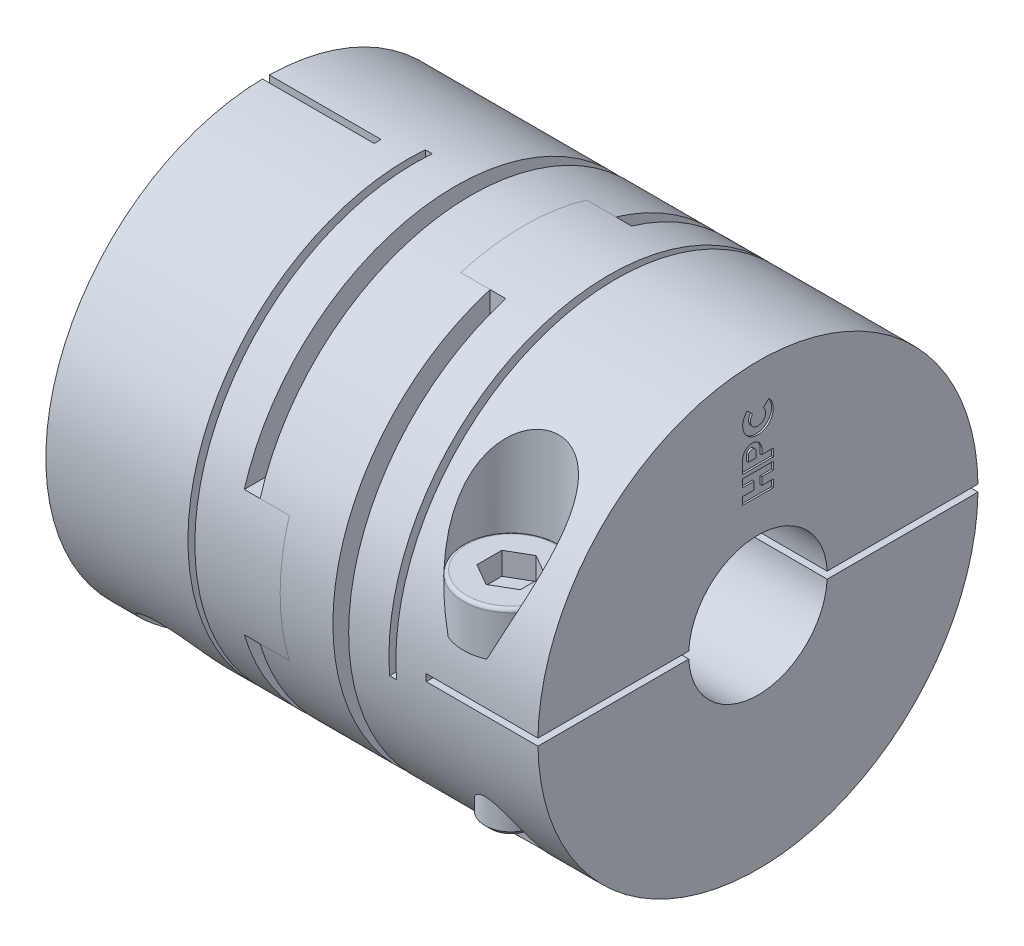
ISO-10303-21;
HEADER;
FILE_DESCRIPTION(('STEP AP214'),'2;1');
FILE_NAME('part.step','',(''),(''),'','','');
FILE_SCHEMA(('AUTOMOTIVE_DESIGN { 1 0 10303 214 1 1 1 1 }'));
ENDSEC;
DATA;
#1=APPLICATION_CONTEXT('core data for automotive mechanical design processes');
#2=APPLICATION_PROTOCOL_DEFINITION('international standard','automotive_design',2000,#1);
#3=PRODUCT_CONTEXT('',#1,'mechanical');
#4=PRODUCT('Part','Part','',(#3));
#5=PRODUCT_RELATED_PRODUCT_CATEGORY('part','',(#4));
#6=PRODUCT_DEFINITION_FORMATION('','',#4);
#7=PRODUCT_DEFINITION_CONTEXT('part definition',#1,'design');
#8=PRODUCT_DEFINITION('design','',#6,#7);
#9=PRODUCT_DEFINITION_SHAPE('','',#8);
#10=(LENGTH_UNIT() NAMED_UNIT(*) SI_UNIT(.MILLI.,.METRE.));
#11=(NAMED_UNIT(*) PLANE_ANGLE_UNIT() SI_UNIT($,.RADIAN.));
#12=(NAMED_UNIT(*) SI_UNIT($,.STERADIAN.) SOLID_ANGLE_UNIT());
#13=UNCERTAINTY_MEASURE_WITH_UNIT(LENGTH_MEASURE(1.E-05),#10,'distance_accuracy_value','');
#14=(GEOMETRIC_REPRESENTATION_CONTEXT(3) GLOBAL_UNCERTAINTY_ASSIGNED_CONTEXT((#13)) GLOBAL_UNIT_ASSIGNED_CONTEXT((#10,
#11,#12)) REPRESENTATION_CONTEXT('',''));
#15=CARTESIAN_POINT('',(0.,0.,0.));
#16=DIRECTION('',(0.,0.,1.));
#17=DIRECTION('',(1.,0.,0.));
#18=AXIS2_PLACEMENT_3D('',#15,#16,#17);
#19=CARTESIAN_POINT('',(0.,-1.66533453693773E-13,3.78000000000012));
#20=DIRECTION('',(0.,0.,1.));
#21=DIRECTION('',(0.,-1.,0.));
#22=AXIS2_PLACEMENT_3D('',#19,#20,#21);
#23=PLANE('',#22);
#24=DIRECTION('',(-0.866025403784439,0.499999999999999,0.));
#25=VECTOR('',#24,1.);
#26=CARTESIAN_POINT('',(5.55,-9.228312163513,3.78000000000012));
#27=LINE('',#26,#25);
#28=CARTESIAN_POINT('',(5.55,-9.228312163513,3.78000000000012));
#29=VERTEX_POINT('',#28);
#30=CARTESIAN_POINT('',(4.29999999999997,-8.50662432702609,3.78000000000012));
#31=VERTEX_POINT('',#30);
#32=EDGE_CURVE('P0_E351',#29,#31,#27,.T.);
#33=ORIENTED_EDGE('',*,*,#32,.T.);
#34=DIRECTION('',(-0.866025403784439,-0.499999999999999,0.));
#35=VECTOR('',#34,1.);
#36=CARTESIAN_POINT('',(4.29999999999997,-8.50662432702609,3.78000000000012));
#37=LINE('',#36,#35);
#38=CARTESIAN_POINT('',(3.05,-9.228312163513,3.78000000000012));
#39=VERTEX_POINT('',#38);
#40=EDGE_CURVE('P0_E346',#31,#39,#37,.T.);
#41=ORIENTED_EDGE('',*,*,#40,.T.);
#42=DIRECTION('',(0.,-1.,0.));
#43=VECTOR('',#42,1.);
#44=CARTESIAN_POINT('',(3.05,-9.228312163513,3.78000000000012));
#45=LINE('',#44,#43);
#46=CARTESIAN_POINT('',(3.05,-10.671687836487,3.78000000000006));
#47=VERTEX_POINT('',#46);
#48=EDGE_CURVE('P0_E341',#39,#47,#45,.T.);
#49=ORIENTED_EDGE('',*,*,#48,.T.);
#50=DIRECTION('',(0.866025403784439,-0.499999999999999,0.));
#51=VECTOR('',#50,1.);
#52=CARTESIAN_POINT('',(3.05,-10.671687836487,3.78000000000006));
#53=LINE('',#52,#51);
#54=CARTESIAN_POINT('',(4.30000000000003,-11.3933756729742,3.78000000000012));
#55=VERTEX_POINT('',#54);
#56=EDGE_CURVE('P0_E336',#47,#55,#53,.T.);
#57=ORIENTED_EDGE('',*,*,#56,.T.);
#58=DIRECTION('',(0.866025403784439,0.499999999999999,0.));
#59=VECTOR('',#58,1.);
#60=CARTESIAN_POINT('',(4.29999999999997,-11.3933756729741,3.78000000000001));
#61=LINE('',#60,#59);
#62=CARTESIAN_POINT('',(5.55,-10.671687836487,3.78000000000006));
#63=VERTEX_POINT('',#62);
#64=EDGE_CURVE('P0_E332',#55,#63,#61,.T.);
#65=ORIENTED_EDGE('',*,*,#64,.T.);
#66=DIRECTION('',(0.,1.,0.));
#67=VECTOR('',#66,1.);
#68=CARTESIAN_POINT('',(5.55,-10.671687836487,3.78000000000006));
#69=LINE('',#68,#67);
#70=EDGE_CURVE('P0_E180',#63,#29,#69,.T.);
#71=ORIENTED_EDGE('',*,*,#70,.T.);
#72=EDGE_LOOP('',(#33,#41,#49,#57,#65,#71));
#73=FACE_BOUND('',#72,.T.);
#74=ADVANCED_FACE('P0_F34',(#73),#23,.T.);
#75=CARTESIAN_POINT('',(5.55,-10.671687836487,3.78000000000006));
#76=DIRECTION('',(1.,0.,0.));
#77=DIRECTION('',(0.,1.,0.));
#78=AXIS2_PLACEMENT_3D('',#75,#76,#77);
#79=PLANE('',#78);
#80=DIRECTION('',(0.,1.,0.));
#81=VECTOR('',#80,1.);
#82=CARTESIAN_POINT('',(5.55,-9.95000000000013,5.08000000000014));
#83=LINE('',#82,#81);
#84=CARTESIAN_POINT('',(5.55,-10.6716878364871,5.08000000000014));
#85=VERTEX_POINT('',#84);
#86=CARTESIAN_POINT('',(5.55,-9.22831216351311,5.08000000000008));
#87=VERTEX_POINT('',#86);
#88=EDGE_CURVE('P0_E331',#85,#87,#83,.T.);
#89=ORIENTED_EDGE('',*,*,#88,.T.);
#90=DIRECTION('',(0.,0.,1.));
#91=VECTOR('',#90,1.);
#92=CARTESIAN_POINT('',(5.55,-9.228312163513,3.78000000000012));
#93=LINE('',#92,#91);
#94=EDGE_CURVE('P0_E353',#87,#29,#93,.F.);
#95=ORIENTED_EDGE('',*,*,#94,.T.);
#96=ORIENTED_EDGE('',*,*,#70,.F.);
#97=DIRECTION('',(0.,0.,1.));
#98=VECTOR('',#97,1.);
#99=CARTESIAN_POINT('',(5.55,-10.6716878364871,3.78000000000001));
#100=LINE('',#99,#98);
#101=EDGE_CURVE('P0_E324',#63,#85,#100,.T.);
#102=ORIENTED_EDGE('',*,*,#101,.T.);
#103=EDGE_LOOP('',(#89,#95,#96,#102));
#104=FACE_BOUND('',#103,.T.);
#105=ADVANCED_FACE('P0_F546',(#104),#79,.F.);
#106=CARTESIAN_POINT('',(5.55,-9.228312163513,3.78000000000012));
#107=DIRECTION('',(0.499999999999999,0.866025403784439,0.));
#108=DIRECTION('',(-0.866025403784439,0.499999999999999,0.));
#109=AXIS2_PLACEMENT_3D('',#106,#107,#108);
#110=PLANE('',#109);
#111=DIRECTION('',(0.,0.,1.));
#112=VECTOR('',#111,1.);
#113=CARTESIAN_POINT('',(4.29999999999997,-8.50662432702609,3.78000000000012));
#114=LINE('',#113,#112);
#115=CARTESIAN_POINT('',(4.29999999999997,-8.50662432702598,5.08000000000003));
#116=VERTEX_POINT('',#115);
#117=EDGE_CURVE('P0_E348',#116,#31,#114,.F.);
#118=ORIENTED_EDGE('',*,*,#117,.T.);
#119=ORIENTED_EDGE('',*,*,#32,.F.);
#120=ORIENTED_EDGE('',*,*,#94,.F.);
#121=DIRECTION('',(-0.866025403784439,0.499999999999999,0.));
#122=VECTOR('',#121,1.);
#123=CARTESIAN_POINT('',(5.55,-9.22831216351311,5.08000000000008));
#124=LINE('',#123,#122);
#125=EDGE_CURVE('P0_E560',#87,#116,#124,.T.);
#126=ORIENTED_EDGE('',*,*,#125,.T.);
#127=EDGE_LOOP('',(#118,#119,#120,#126));
#128=FACE_BOUND('',#127,.T.);
#129=ADVANCED_FACE('P0_F543',(#128),#110,.F.);
#130=CARTESIAN_POINT('',(4.29999999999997,-8.50662432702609,3.78000000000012));
#131=DIRECTION('',(-0.499999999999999,0.866025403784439,0.));
#132=DIRECTION('',(-0.866025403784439,-0.499999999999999,0.));
#133=AXIS2_PLACEMENT_3D('',#130,#131,#132);
#134=PLANE('',#133);
#135=DIRECTION('',(0.,0.,1.));
#136=VECTOR('',#135,1.);
#137=CARTESIAN_POINT('',(3.05,-9.228312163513,3.78000000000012));
#138=LINE('',#137,#136);
#139=CARTESIAN_POINT('',(3.05,-9.22831216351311,5.08000000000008));
#140=VERTEX_POINT('',#139);
#141=EDGE_CURVE('P0_E343',#140,#39,#138,.F.);
#142=ORIENTED_EDGE('',*,*,#141,.T.);
#143=ORIENTED_EDGE('',*,*,#40,.F.);
#144=ORIENTED_EDGE('',*,*,#117,.F.);
#145=DIRECTION('',(-0.866025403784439,-0.499999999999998,0.));
#146=VECTOR('',#145,1.);
#147=CARTESIAN_POINT('',(4.29999999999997,-8.50662432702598,5.08000000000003));
#148=LINE('',#147,#146);
#149=EDGE_CURVE('P0_E564',#116,#140,#148,.T.);
#150=ORIENTED_EDGE('',*,*,#149,.T.);
#151=EDGE_LOOP('',(#142,#143,#144,#150));
#152=FACE_BOUND('',#151,.T.);
#153=ADVANCED_FACE('P0_F539',(#152),#134,.F.);
#154=CARTESIAN_POINT('',(3.05,-9.228312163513,3.78000000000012));
#155=DIRECTION('',(-1.,0.,0.));
#156=DIRECTION('',(0.,-1.,0.));
#157=AXIS2_PLACEMENT_3D('',#154,#155,#156);
#158=PLANE('',#157);
#159=DIRECTION('',(0.,0.,1.));
#160=VECTOR('',#159,1.);
#161=CARTESIAN_POINT('',(3.05,-10.671687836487,3.78000000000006));
#162=LINE('',#161,#160);
#163=CARTESIAN_POINT('',(3.05,-10.6716878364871,5.08000000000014));
#164=VERTEX_POINT('',#163);
#165=EDGE_CURVE('P0_E338',#164,#47,#162,.F.);
#166=ORIENTED_EDGE('',*,*,#165,.T.);
#167=ORIENTED_EDGE('',*,*,#48,.F.);
#168=ORIENTED_EDGE('',*,*,#141,.F.);
#169=DIRECTION('',(0.,1.,0.));
#170=VECTOR('',#169,1.);
#171=CARTESIAN_POINT('',(3.05,-9.95000000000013,5.08000000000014));
#172=LINE('',#171,#170);
#173=EDGE_CURVE('P0_E566',#140,#164,#172,.F.);
#174=ORIENTED_EDGE('',*,*,#173,.T.);
#175=EDGE_LOOP('',(#166,#167,#168,#174));
#176=FACE_BOUND('',#175,.T.);
#177=ADVANCED_FACE('P0_F536',(#176),#158,.F.);
#178=CARTESIAN_POINT('',(3.05,-10.671687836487,3.78000000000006));
#179=DIRECTION('',(-0.499999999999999,-0.866025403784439,0.));
#180=DIRECTION('',(0.866025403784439,-0.499999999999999,0.));
#181=AXIS2_PLACEMENT_3D('',#178,#179,#180);
#182=PLANE('',#181);
#183=DIRECTION('',(0.,0.,1.));
#184=VECTOR('',#183,1.);
#185=CARTESIAN_POINT('',(4.29999999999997,-11.3933756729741,3.78000000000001));
#186=LINE('',#185,#184);
#187=CARTESIAN_POINT('',(4.30000000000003,-11.393375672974,5.08000000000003));
#188=VERTEX_POINT('',#187);
#189=EDGE_CURVE('P0_E334',#188,#55,#186,.F.);
#190=ORIENTED_EDGE('',*,*,#189,.T.);
#191=ORIENTED_EDGE('',*,*,#56,.F.);
#192=ORIENTED_EDGE('',*,*,#165,.F.);
#193=DIRECTION('',(0.866025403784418,-0.500000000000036,0.));
#194=VECTOR('',#193,1.);
#195=CARTESIAN_POINT('',(3.05,-10.6716878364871,5.08000000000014));
#196=LINE('',#195,#194);
#197=EDGE_CURVE('P0_E142',#164,#188,#196,.T.);
#198=ORIENTED_EDGE('',*,*,#197,.T.);
#199=EDGE_LOOP('',(#190,#191,#192,#198));
#200=FACE_BOUND('',#199,.T.);
#201=ADVANCED_FACE('P0_F532',(#200),#182,.F.);
#202=CARTESIAN_POINT('',(4.29999999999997,-11.3933756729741,3.78000000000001));
#203=DIRECTION('',(0.499999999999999,-0.866025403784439,0.));
#204=DIRECTION('',(0.866025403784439,0.499999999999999,0.));
#205=AXIS2_PLACEMENT_3D('',#202,#203,#204);
#206=PLANE('',#205);
#207=ORIENTED_EDGE('',*,*,#101,.F.);
#208=ORIENTED_EDGE('',*,*,#64,.F.);
#209=ORIENTED_EDGE('',*,*,#189,.F.);
#210=DIRECTION('',(0.866025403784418,0.500000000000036,0.));
#211=VECTOR('',#210,1.);
#212=CARTESIAN_POINT('',(4.29999999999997,-11.3933756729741,5.07999999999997));
#213=LINE('',#212,#211);
#214=EDGE_CURVE('P0_E505',#188,#85,#213,.T.);
#215=ORIENTED_EDGE('',*,*,#214,.T.);
#216=EDGE_LOOP('',(#207,#208,#209,#215));
#217=FACE_BOUND('',#216,.T.);
#218=ADVANCED_FACE('P0_F527',(#217),#206,.F.);
#219=CARTESIAN_POINT('',(4.29999999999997,-9.95000000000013,5.08000000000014));
#220=DIRECTION('',(0.,0.,-1.));
#221=DIRECTION('',(0.,1.,0.));
#222=AXIS2_PLACEMENT_3D('',#219,#220,#221);
#223=PLANE('',#222);
#224=ORIENTED_EDGE('',*,*,#197,.F.);
#225=ORIENTED_EDGE('',*,*,#173,.F.);
#226=ORIENTED_EDGE('',*,*,#149,.F.);
#227=ORIENTED_EDGE('',*,*,#125,.F.);
#228=ORIENTED_EDGE('',*,*,#88,.F.);
#229=ORIENTED_EDGE('',*,*,#214,.F.);
#230=EDGE_LOOP('',(#224,#225,#226,#227,#228,#229));
#231=FACE_BOUND('',#230,.T.);
#232=CARTESIAN_POINT('',(4.29999999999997,-9.95000000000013,5.08000000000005));
#233=DIRECTION('',(0.,0.,-1.));
#234=DIRECTION('',(0.,1.,0.));
#235=AXIS2_PLACEMENT_3D('',#232,#233,#234);
#236=CIRCLE('',#235,2.55000000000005);
#237=CARTESIAN_POINT('',(4.29999999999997,-7.40000000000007,5.08000000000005));
#238=VERTEX_POINT('',#237);
#239=EDGE_CURVE('P0_E490',#238,#238,#236,.T.);
#240=ORIENTED_EDGE('',*,*,#239,.F.);
#241=EDGE_LOOP('',(#240));
#242=FACE_BOUND('',#241,.T.);
#243=ADVANCED_FACE('P0_F516',(#231,#242),#223,.F.);
#244=CARTESIAN_POINT('',(5.49349999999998,-9.95000000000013,-7.25714285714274));
#245=DIRECTION('',(0.,0.,1.));
#246=DIRECTION('',(0.,-1.,0.));
#247=AXIS2_PLACEMENT_3D('',#244,#245,#246);
#248=PLANE('',#247);
#249=CARTESIAN_POINT('',(4.29999999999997,-9.95000000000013,-7.2571428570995));
#250=DIRECTION('',(0.,0.,1.));
#251=DIRECTION('',(-1.,0.,0.));
#252=AXIS2_PLACEMENT_3D('',#249,#250,#251);
#253=CIRCLE('',#252,1.19350000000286);
#254=CARTESIAN_POINT('',(3.10649999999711,-9.95000000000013,-7.2571428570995));
#255=VERTEX_POINT('',#254);
#256=EDGE_CURVE('P0_E300',#255,#255,#253,.T.);
#257=ORIENTED_EDGE('',*,*,#256,.F.);
#258=EDGE_LOOP('',(#257));
#259=FACE_BOUND('',#258,.T.);
#260=ADVANCED_FACE('P0_F526',(#259),#248,.F.);
#261=CARTESIAN_POINT('',(0.,-1.11022302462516E-13,-0.99999999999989));
#262=DIRECTION('',(0.,0.,1.));
#263=DIRECTION('',(0.,-1.,0.));
#264=AXIS2_PLACEMENT_3D('',#261,#262,#263);
#265=PLANE('',#264);
#266=DIRECTION('',(-1.,0.,0.));
#267=VECTOR('',#266,1.);
#268=CARTESIAN_POINT('',(19.9137084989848,3.87298334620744,-0.99999999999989));
#269=LINE('',#268,#267);
#270=CARTESIAN_POINT('',(8.6,3.87298334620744,-0.99999999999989));
#271=VERTEX_POINT('',#270);
#272=CARTESIAN_POINT('',(8.19999999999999,3.87298334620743,-0.999999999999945));
#273=VERTEX_POINT('',#272);
#274=EDGE_CURVE('P0_E191',#271,#273,#269,.T.);
#275=ORIENTED_EDGE('',*,*,#274,.F.);
#276=DIRECTION('',(0.,-1.,0.));
#277=VECTOR('',#276,1.);
#278=CARTESIAN_POINT('',(8.6,-1.11022302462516E-13,-0.99999999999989));
#279=LINE('',#278,#277);
#280=CARTESIAN_POINT('',(8.6,12.6605687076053,-0.99999999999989));
#281=VERTEX_POINT('',#280);
#282=EDGE_CURVE('P0_E257',#271,#281,#279,.F.);
#283=ORIENTED_EDGE('',*,*,#282,.T.);
#284=DIRECTION('',(1.,0.,0.));
#285=VECTOR('',#284,1.);
#286=CARTESIAN_POINT('',(0.,12.6605687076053,-0.999999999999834));
#287=LINE('',#286,#285);
#288=CARTESIAN_POINT('',(8.19999999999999,12.6605687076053,-0.99999999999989));
#289=VERTEX_POINT('',#288);
#290=EDGE_CURVE('P0_E500',#281,#289,#287,.F.);
#291=ORIENTED_EDGE('',*,*,#290,.T.);
#292=DIRECTION('',(0.,1.,0.));
#293=VECTOR('',#292,1.);
#294=CARTESIAN_POINT('',(8.19999999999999,16.9333333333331,-0.999999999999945));
#295=LINE('',#294,#293);
#296=EDGE_CURVE('P0_E259',#273,#289,#295,.T.);
#297=ORIENTED_EDGE('',*,*,#296,.F.);
#298=EDGE_LOOP('',(#275,#283,#291,#297));
#299=FACE_BOUND('',#298,.T.);
#300=ADVANCED_FACE('P0_F710',(#299),#265,.T.);
#301=CARTESIAN_POINT('',(0.,-1.11022302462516E-13,-0.99999999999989));
#302=DIRECTION('',(0.,0.,1.));
#303=DIRECTION('',(0.,-1.,0.));
#304=AXIS2_PLACEMENT_3D('',#301,#302,#303);
#305=PLANE('',#304);
#306=DIRECTION('',(-1.,0.,0.));
#307=VECTOR('',#306,1.);
#308=CARTESIAN_POINT('',(19.9137084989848,-3.87298334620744,-0.99999999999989));
#309=LINE('',#308,#307);
#310=CARTESIAN_POINT('',(8.19999999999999,-3.87298334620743,-0.999999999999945));
#311=VERTEX_POINT('',#310);
#312=CARTESIAN_POINT('',(8.6,-3.87298334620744,-0.99999999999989));
#313=VERTEX_POINT('',#312);
#314=EDGE_CURVE('P0_E800',#311,#313,#309,.F.);
#315=ORIENTED_EDGE('',*,*,#314,.F.);
#316=DIRECTION('',(0.,1.,0.));
#317=VECTOR('',#316,1.);
#318=CARTESIAN_POINT('',(8.19999999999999,16.9333333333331,-0.999999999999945));
#319=LINE('',#318,#317);
#320=CARTESIAN_POINT('',(8.19999999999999,-12.6605687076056,-0.99999999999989));
#321=VERTEX_POINT('',#320);
#322=EDGE_CURVE('P0_E493',#321,#311,#319,.T.);
#323=ORIENTED_EDGE('',*,*,#322,.F.);
#324=DIRECTION('',(1.,0.,0.));
#325=VECTOR('',#324,1.);
#326=CARTESIAN_POINT('',(0.,-12.6605687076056,-0.99999999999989));
#327=LINE('',#326,#325);
#328=CARTESIAN_POINT('',(8.6,-12.6605687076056,-0.99999999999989));
#329=VERTEX_POINT('',#328);
#330=EDGE_CURVE('P0_E133',#321,#329,#327,.T.);
#331=ORIENTED_EDGE('',*,*,#330,.T.);
#332=DIRECTION('',(0.,-1.,0.));
#333=VECTOR('',#332,1.);
#334=CARTESIAN_POINT('',(8.6,-1.11022302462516E-13,-0.99999999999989));
#335=LINE('',#334,#333);
#336=EDGE_CURVE('P0_E254',#329,#313,#335,.F.);
#337=ORIENTED_EDGE('',*,*,#336,.T.);
#338=EDGE_LOOP('',(#315,#323,#331,#337));
#339=FACE_BOUND('',#338,.T.);
#340=ADVANCED_FACE('P0_F700',(#339),#305,.T.);
#341=CARTESIAN_POINT('',(4.29999999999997,-9.95000000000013,-7.25714285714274));
#342=DIRECTION('',(0.,0.,1.));
#343=DIRECTION('',(0.,-1.,0.));
#344=AXIS2_PLACEMENT_3D('',#341,#342,#343);
#345=CYLINDRICAL_SURFACE('',#344,1.5);
#346=CARTESIAN_POINT('',(4.29999999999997,-9.95000000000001,0.199999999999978));
#347=DIRECTION('',(0.,0.,1.));
#348=DIRECTION('',(0.,-1.,0.));
#349=AXIS2_PLACEMENT_3D('',#346,#347,#348);
#350=CIRCLE('',#349,1.5);
#351=CARTESIAN_POINT('',(4.29999999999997,-11.45,0.199999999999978));
#352=VERTEX_POINT('',#351);
#353=EDGE_CURVE('P0_E271',#352,#352,#350,.F.);
#354=ORIENTED_EDGE('',*,*,#353,.T.);
#355=EDGE_LOOP('',(#354));
#356=FACE_BOUND('',#355,.T.);
#357=CARTESIAN_POINT('',(4.29999999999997,-9.95000000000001,-0.199999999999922));
#358=DIRECTION('',(0.,0.,1.));
#359=DIRECTION('',(0.,-1.,0.));
#360=AXIS2_PLACEMENT_3D('',#357,#358,#359);
#361=CIRCLE('',#360,1.5);
#362=CARTESIAN_POINT('',(4.29999999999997,-11.45,-0.199999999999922));
#363=VERTEX_POINT('',#362);
#364=EDGE_CURVE('P0_E253',#363,#363,#361,.F.);
#365=ORIENTED_EDGE('',*,*,#364,.F.);
#366=EDGE_LOOP('',(#365));
#367=FACE_BOUND('',#366,.T.);
#368=ADVANCED_FACE('P0_F691',(#356,#367),#345,.T.);
#369=CARTESIAN_POINT('',(8.19999999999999,16.9333333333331,15.9333333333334));
#370=DIRECTION('',(1.,0.,0.));
#371=DIRECTION('',(0.,1.,0.));
#372=AXIS2_PLACEMENT_3D('',#369,#370,#371);
#373=PLANE('',#372);
#374=CARTESIAN_POINT('',(8.19999999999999,0.,0.));
#375=DIRECTION('',(1.,0.,0.));
#376=DIRECTION('',(0.,1.,0.));
#377=AXIS2_PLACEMENT_3D('',#374,#375,#376);
#378=CIRCLE('',#377,4.);
#379=CARTESIAN_POINT('',(8.19999999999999,-3.99499687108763,-0.199999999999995));
#380=VERTEX_POINT('',#379);
#381=EDGE_CURVE('P0_E798',#380,#311,#378,.T.);
#382=ORIENTED_EDGE('',*,*,#381,.F.);
#383=DIRECTION('',(0.,-1.,0.));
#384=VECTOR('',#383,1.);
#385=CARTESIAN_POINT('',(8.19999999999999,0.,-0.199999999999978));
#386=LINE('',#385,#384);
#387=CARTESIAN_POINT('',(8.19999999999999,-12.6984250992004,-0.199999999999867));
#388=VERTEX_POINT('',#387);
#389=EDGE_CURVE('P0_E250',#388,#380,#386,.F.);
#390=ORIENTED_EDGE('',*,*,#389,.F.);
#391=CARTESIAN_POINT('',(8.19999999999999,0.,0.));
#392=DIRECTION('',(-1.,0.,0.));
#393=DIRECTION('',(0.,0.,-1.));
#394=AXIS2_PLACEMENT_3D('',#391,#392,#393);
#395=CIRCLE('',#394,12.7);
#396=EDGE_CURVE('P0_E494',#388,#321,#395,.F.);
#397=ORIENTED_EDGE('',*,*,#396,.T.);
#398=ORIENTED_EDGE('',*,*,#322,.T.);
#399=EDGE_LOOP('',(#382,#390,#397,#398));
#400=FACE_BOUND('',#399,.T.);
#401=ADVANCED_FACE('P0_F681',(#400),#373,.T.);
#402=CARTESIAN_POINT('',(6.45000000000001,-1.11022302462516E-13,0.200000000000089));
#403=DIRECTION('',(-1.,0.,0.));
#404=DIRECTION('',(0.,-1.,0.));
#405=AXIS2_PLACEMENT_3D('',#402,#403,#404);
#406=PLANE('',#405);
#407=CARTESIAN_POINT('',(6.45000000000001,0.,0.));
#408=DIRECTION('',(-1.,0.,0.));
#409=DIRECTION('',(0.,-1.,0.));
#410=AXIS2_PLACEMENT_3D('',#407,#408,#409);
#411=CIRCLE('',#410,4.);
#412=CARTESIAN_POINT('',(6.45000000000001,3.99499687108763,0.20000000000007));
#413=VERTEX_POINT('',#412);
#414=CARTESIAN_POINT('',(6.45000000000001,3.99499687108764,-0.199999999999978));
#415=VERTEX_POINT('',#414);
#416=EDGE_CURVE('P0_E222',#413,#415,#411,.T.);
#417=ORIENTED_EDGE('',*,*,#416,.F.);
#418=DIRECTION('',(0.,-1.,0.));
#419=VECTOR('',#418,1.);
#420=CARTESIAN_POINT('',(6.45000000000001,-1.11022302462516E-13,0.200000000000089));
#421=LINE('',#420,#419);
#422=CARTESIAN_POINT('',(6.45000000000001,12.6984250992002,0.200000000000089));
#423=VERTEX_POINT('',#422);
#424=EDGE_CURVE('P0_E241',#413,#423,#421,.F.);
#425=ORIENTED_EDGE('',*,*,#424,.T.);
#426=CARTESIAN_POINT('',(6.45000000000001,0.,0.));
#427=DIRECTION('',(-1.,0.,0.));
#428=DIRECTION('',(0.,0.,-1.));
#429=AXIS2_PLACEMENT_3D('',#426,#427,#428);
#430=CIRCLE('',#429,12.7);
#431=CARTESIAN_POINT('',(6.45000000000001,12.6984250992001,-0.199999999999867));
#432=VERTEX_POINT('',#431);
#433=EDGE_CURVE('P0_E491',#423,#432,#430,.T.);
#434=ORIENTED_EDGE('',*,*,#433,.T.);
#435=DIRECTION('',(0.,-1.,0.));
#436=VECTOR('',#435,1.);
#437=CARTESIAN_POINT('',(6.45000000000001,0.,-0.199999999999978));
#438=LINE('',#437,#436);
#439=EDGE_CURVE('P0_E242',#415,#432,#438,.F.);
#440=ORIENTED_EDGE('',*,*,#439,.F.);
#441=EDGE_LOOP('',(#417,#425,#434,#440));
#442=FACE_BOUND('',#441,.T.);
#443=ADVANCED_FACE('P0_F313',(#442),#406,.T.);
#444=CARTESIAN_POINT('',(4.29999999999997,-9.95000000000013,4.88000000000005));
#445=DIRECTION('',(0.,0.,-1.));
#446=DIRECTION('',(0.,1.,0.));
#447=AXIS2_PLACEMENT_3D('',#444,#445,#446);
#448=TOROIDAL_SURFACE('',#447,2.55000000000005,0.2);
#449=CARTESIAN_POINT('',(4.29999999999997,-9.95000000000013,4.88000000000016));
#450=DIRECTION('',(0.,0.,1.));
#451=DIRECTION('',(0.,-1.,0.));
#452=AXIS2_PLACEMENT_3D('',#449,#450,#451);
#453=CIRCLE('',#452,2.75);
#454=CARTESIAN_POINT('',(6.40044728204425,-11.724998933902,4.88000000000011));
#455=VERTEX_POINT('',#454);
#456=CARTESIAN_POINT('',(2.19955271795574,-11.724998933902,4.88000000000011));
#457=VERTEX_POINT('',#456);
#458=EDGE_CURVE('P0_E483',#455,#457,#453,.F.);
#459=ORIENTED_EDGE('',*,*,#458,.F.);
#460=CARTESIAN_POINT('',(4.29999999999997,-9.95000000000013,4.88000000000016));
#461=DIRECTION('',(0.,0.,1.));
#462=DIRECTION('',(-1.,0.,0.));
#463=AXIS2_PLACEMENT_3D('',#460,#461,#462);
#464=CIRCLE('',#463,2.75);
#465=EDGE_CURVE('P0_E274',#455,#457,#464,.T.);
#466=ORIENTED_EDGE('',*,*,#465,.T.);
#467=EDGE_LOOP('',(#459,#466));
#468=FACE_BOUND('',#467,.T.);
#469=ORIENTED_EDGE('',*,*,#239,.T.);
#470=EDGE_LOOP('',(#469));
#471=FACE_BOUND('',#470,.T.);
#472=ADVANCED_FACE('P0_F307',(#468,#471),#448,.T.);
#473=CARTESIAN_POINT('',(4.29999999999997,-9.95000000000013,-6.95064285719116));
#474=DIRECTION('',(0.,0.,1.));
#475=DIRECTION('',(-1.,0.,0.));
#476=AXIS2_PLACEMENT_3D('',#473,#474,#475);
#477=CONICAL_SURFACE('',#476,1.49999999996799,0.785398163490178);
#478=CARTESIAN_POINT('',(4.29999999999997,-9.95000000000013,-6.95064285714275));
#479=DIRECTION('',(0.,0.,1.));
#480=DIRECTION('',(0.,-1.,0.));
#481=AXIS2_PLACEMENT_3D('',#478,#479,#480);
#482=CIRCLE('',#481,1.5);
#483=CARTESIAN_POINT('',(2.96255008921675,-10.6291374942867,-6.95064285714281));
#484=VERTEX_POINT('',#483);
#485=CARTESIAN_POINT('',(5.63744991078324,-10.6291374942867,-6.95064285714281));
#486=VERTEX_POINT('',#485);
#487=EDGE_CURVE('P0_E482',#484,#486,#482,.T.);
#488=ORIENTED_EDGE('',*,*,#487,.F.);
#489=CARTESIAN_POINT('',(4.29999999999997,-9.95000000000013,-6.95064285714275));
#490=DIRECTION('',(0.,0.,1.));
#491=DIRECTION('',(-1.,0.,0.));
#492=AXIS2_PLACEMENT_3D('',#489,#490,#491);
#493=CIRCLE('',#492,1.5);
#494=EDGE_CURVE('P0_E55',#484,#486,#493,.F.);
#495=ORIENTED_EDGE('',*,*,#494,.T.);
#496=EDGE_LOOP('',(#488,#495));
#497=FACE_BOUND('',#496,.T.);
#498=ORIENTED_EDGE('',*,*,#256,.T.);
#499=EDGE_LOOP('',(#498));
#500=FACE_BOUND('',#499,.T.);
#501=ADVANCED_FACE('P0_F312',(#497,#500),#477,.T.);
#502=CARTESIAN_POINT('',(10.9230769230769,21.1666666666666,50.8000000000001));
#503=DIRECTION('',(1.,0.,0.));
#504=DIRECTION('',(0.,1.,0.));
#505=AXIS2_PLACEMENT_3D('',#502,#503,#504);
#506=PLANE('',#505);
#507=CARTESIAN_POINT('',(10.9230769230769,0.,0.));
#508=DIRECTION('',(-1.,0.,0.));
#509=DIRECTION('',(0.,0.,-1.));
#510=AXIS2_PLACEMENT_3D('',#507,#508,#509);
#511=CIRCLE('',#510,12.7);
#512=CARTESIAN_POINT('',(10.9230769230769,3.62857142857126,12.170598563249));
#513=VERTEX_POINT('',#512);
#514=CARTESIAN_POINT('',(10.9230769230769,3.6285714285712,-12.1705985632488));
#515=VERTEX_POINT('',#514);
#516=EDGE_CURVE('P0_E298',#513,#515,#511,.T.);
#517=ORIENTED_EDGE('',*,*,#516,.F.);
#518=DIRECTION('',(0.,0.,1.));
#519=VECTOR('',#518,1.);
#520=CARTESIAN_POINT('',(10.9230769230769,3.62857142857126,50.8000000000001));
#521=LINE('',#520,#519);
#522=EDGE_CURVE('P0_E294',#515,#513,#521,.T.);
#523=ORIENTED_EDGE('',*,*,#522,.F.);
#524=EDGE_LOOP('',(#517,#523));
#525=FACE_BOUND('',#524,.T.);
#526=ADVANCED_FACE('P0_F456',(#525),#506,.T.);
#527=CARTESIAN_POINT('',(10.9230769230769,3.62857142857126,50.8000000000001));
#528=DIRECTION('',(0.,1.,0.));
#529=DIRECTION('',(-1.,0.,0.));
#530=AXIS2_PLACEMENT_3D('',#527,#528,#529);
#531=PLANE('',#530);
#532=DIRECTION('',(-1.,0.,0.));
#533=VECTOR('',#532,1.);
#534=CARTESIAN_POINT('',(13.5238095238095,3.6285714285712,-12.1705985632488));
#535=LINE('',#534,#533);
#536=CARTESIAN_POINT('',(13.5238095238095,3.6285714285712,-12.1705985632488));
#537=VERTEX_POINT('',#536);
#538=EDGE_CURVE('P0_E295',#515,#537,#535,.F.);
#539=ORIENTED_EDGE('',*,*,#538,.F.);
#540=ORIENTED_EDGE('',*,*,#522,.T.);
#541=DIRECTION('',(-1.,0.,0.));
#542=VECTOR('',#541,1.);
#543=CARTESIAN_POINT('',(13.5238095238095,3.62857142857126,12.170598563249));
#544=LINE('',#543,#542);
#545=CARTESIAN_POINT('',(13.5238095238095,3.62857142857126,12.170598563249));
#546=VERTEX_POINT('',#545);
#547=EDGE_CURVE('P0_E301',#546,#513,#544,.T.);
#548=ORIENTED_EDGE('',*,*,#547,.F.);
#549=DIRECTION('',(0.,0.,-1.));
#550=VECTOR('',#549,1.);
#551=CARTESIAN_POINT('',(13.5238095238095,3.62857142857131,12.7000000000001));
#552=LINE('',#551,#550);
#553=EDGE_CURVE('P0_E292',#546,#537,#552,.T.);
#554=ORIENTED_EDGE('',*,*,#553,.T.);
#555=EDGE_LOOP('',(#539,#540,#548,#554));
#556=FACE_BOUND('',#555,.T.);
#557=ADVANCED_FACE('P0_F453',(#556),#531,.T.);
#558=CARTESIAN_POINT('',(13.5238095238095,0.,12.7));
#559=DIRECTION('',(-1.,0.,0.));
#560=DIRECTION('',(0.,0.,-1.));
#561=AXIS2_PLACEMENT_3D('',#558,#559,#560);
#562=PLANE('',#561);
#563=CARTESIAN_POINT('',(13.5238095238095,0.,0.));
#564=DIRECTION('',(-1.,0.,0.));
#565=DIRECTION('',(0.,0.,-1.));
#566=AXIS2_PLACEMENT_3D('',#563,#564,#565);
#567=CIRCLE('',#566,12.7);
#568=CARTESIAN_POINT('',(13.5238095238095,-3.62857142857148,12.1705985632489));
#569=VERTEX_POINT('',#568);
#570=EDGE_CURVE('P0_E304',#569,#546,#567,.T.);
#571=ORIENTED_EDGE('',*,*,#570,.F.);
#572=DIRECTION('',(0.,0.,1.));
#573=VECTOR('',#572,1.);
#574=CARTESIAN_POINT('',(13.5238095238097,-3.62857142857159,50.8000000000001));
#575=LINE('',#574,#573);
#576=CARTESIAN_POINT('',(13.5238095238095,-3.62857142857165,-12.1705985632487));
#577=VERTEX_POINT('',#576);
#578=EDGE_CURVE('P0_E289',#577,#569,#575,.T.);
#579=ORIENTED_EDGE('',*,*,#578,.F.);
#580=CARTESIAN_POINT('',(13.5238095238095,0.,0.));
#581=DIRECTION('',(-1.,0.,0.));
#582=DIRECTION('',(0.,0.,-1.));
#583=AXIS2_PLACEMENT_3D('',#580,#581,#582);
#584=CIRCLE('',#583,12.7);
#585=EDGE_CURVE('P0_E283',#537,#577,#584,.T.);
#586=ORIENTED_EDGE('',*,*,#585,.F.);
#587=ORIENTED_EDGE('',*,*,#553,.F.);
#588=EDGE_LOOP('',(#571,#579,#586,#587));
#589=FACE_BOUND('',#588,.T.);
#590=ADVANCED_FACE('P0_F449',(#589),#562,.F.);
#591=CARTESIAN_POINT('',(10.923076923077,-3.62857142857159,50.8000000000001));
#592=DIRECTION('',(1.,0.,0.));
#593=DIRECTION('',(0.,1.,0.));
#594=AXIS2_PLACEMENT_3D('',#591,#592,#593);
#595=PLANE('',#594);
#596=CARTESIAN_POINT('',(10.9230769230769,0.,0.));
#597=DIRECTION('',(-1.,0.,0.));
#598=DIRECTION('',(0.,0.,-1.));
#599=AXIS2_PLACEMENT_3D('',#596,#597,#598);
#600=CIRCLE('',#599,12.7);
#601=CARTESIAN_POINT('',(10.9230769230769,-3.62857142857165,-12.1705985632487));
#602=VERTEX_POINT('',#601);
#603=CARTESIAN_POINT('',(10.9230769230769,-3.62857142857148,12.1705985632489));
#604=VERTEX_POINT('',#603);
#605=EDGE_CURVE('P0_E282',#602,#604,#600,.T.);
#606=ORIENTED_EDGE('',*,*,#605,.F.);
#607=DIRECTION('',(0.,0.,1.));
#608=VECTOR('',#607,1.);
#609=CARTESIAN_POINT('',(10.923076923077,-3.62857142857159,50.8000000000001));
#610=LINE('',#609,#608);
#611=EDGE_CURVE('P0_E287',#604,#602,#610,.F.);
#612=ORIENTED_EDGE('',*,*,#611,.F.);
#613=EDGE_LOOP('',(#606,#612));
#614=FACE_BOUND('',#613,.T.);
#615=ADVANCED_FACE('P0_F445',(#614),#595,.T.);
#616=CARTESIAN_POINT('',(13.5238095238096,-3.62857142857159,50.8000000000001));
#617=DIRECTION('',(0.,-1.,0.));
#618=DIRECTION('',(1.,0.,0.));
#619=AXIS2_PLACEMENT_3D('',#616,#617,#618);
#620=PLANE('',#619);
#621=DIRECTION('',(-1.,0.,0.));
#622=VECTOR('',#621,1.);
#623=CARTESIAN_POINT('',(13.5238095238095,-3.62857142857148,12.1705985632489));
#624=LINE('',#623,#622);
#625=EDGE_CURVE('P0_E284',#604,#569,#624,.F.);
#626=ORIENTED_EDGE('',*,*,#625,.F.);
#627=ORIENTED_EDGE('',*,*,#611,.T.);
#628=DIRECTION('',(-1.,0.,0.));
#629=VECTOR('',#628,1.);
#630=CARTESIAN_POINT('',(13.5238095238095,-3.62857142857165,-12.1705985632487));
#631=LINE('',#630,#629);
#632=EDGE_CURVE('P0_E279',#577,#602,#631,.T.);
#633=ORIENTED_EDGE('',*,*,#632,.F.);
#634=ORIENTED_EDGE('',*,*,#578,.T.);
#635=EDGE_LOOP('',(#626,#627,#633,#634));
#636=FACE_BOUND('',#635,.T.);
#637=ADVANCED_FACE('P0_F441',(#636),#620,.T.);
#638=CARTESIAN_POINT('',(0.,-1.11022302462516E-13,3.17500000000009));
#639=DIRECTION('',(1.,0.,0.));
#640=DIRECTION('',(0.,0.,1.));
#641=AXIS2_PLACEMENT_3D('',#638,#639,#640);
#642=PLANE('',#641);
#643=DIRECTION('',(0.,-1.,0.));
#644=VECTOR('',#643,1.);
#645=CARTESIAN_POINT('',(0.,-1.11022302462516E-13,0.200000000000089));
#646=LINE('',#645,#644);
#647=CARTESIAN_POINT('',(0.,12.6984250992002,0.200000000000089));
#648=VERTEX_POINT('',#647);
#649=CARTESIAN_POINT('',(0.,3.99499687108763,0.200000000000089));
#650=VERTEX_POINT('',#649);
#651=EDGE_CURVE('P0_E244',#648,#650,#646,.T.);
#652=ORIENTED_EDGE('',*,*,#651,.T.);
#653=CARTESIAN_POINT('',(0.,0.,0.));
#654=DIRECTION('',(-1.,0.,0.));
#655=DIRECTION('',(0.,0.,1.));
#656=AXIS2_PLACEMENT_3D('',#653,#654,#655);
#657=CIRCLE('',#656,4.);
#658=CARTESIAN_POINT('',(0.,-3.99499687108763,0.200000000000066));
#659=VERTEX_POINT('',#658);
#660=EDGE_CURVE('P0_E48',#659,#650,#657,.T.);
#661=ORIENTED_EDGE('',*,*,#660,.F.);
#662=DIRECTION('',(0.,-1.,0.));
#663=VECTOR('',#662,1.);
#664=CARTESIAN_POINT('',(0.,-1.11022302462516E-13,0.200000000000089));
#665=LINE('',#664,#663);
#666=CARTESIAN_POINT('',(0.,-12.6984250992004,0.200000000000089));
#667=VERTEX_POINT('',#666);
#668=EDGE_CURVE('P0_E264',#659,#667,#665,.T.);
#669=ORIENTED_EDGE('',*,*,#668,.T.);
#670=CARTESIAN_POINT('',(0.,0.,0.));
#671=DIRECTION('',(-1.,0.,0.));
#672=DIRECTION('',(0.,0.,-1.));
#673=AXIS2_PLACEMENT_3D('',#670,#671,#672);
#674=CIRCLE('',#673,12.7);
#675=EDGE_CURVE('P0_E269',#648,#667,#674,.F.);
#676=ORIENTED_EDGE('',*,*,#675,.F.);
#677=EDGE_LOOP('',(#652,#661,#669,#676));
#678=FACE_BOUND('',#677,.T.);
#679=ADVANCED_FACE('P0_F437',(#678),#642,.F.);
#680=CARTESIAN_POINT('',(0.,-1.11022302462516E-13,0.200000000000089));
#681=DIRECTION('',(0.,0.,1.));
#682=DIRECTION('',(0.,-1.,0.));
#683=AXIS2_PLACEMENT_3D('',#680,#681,#682);
#684=PLANE('',#683);
#685=ORIENTED_EDGE('',*,*,#668,.F.);
#686=DIRECTION('',(-1.,0.,0.));
#687=VECTOR('',#686,1.);
#688=CARTESIAN_POINT('',(19.9137084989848,-3.99499687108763,0.200000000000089));
#689=LINE('',#688,#687);
#690=CARTESIAN_POINT('',(8.19999999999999,-3.99499687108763,0.200000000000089));
#691=VERTEX_POINT('',#690);
#692=EDGE_CURVE('P0_E776',#659,#691,#689,.F.);
#693=ORIENTED_EDGE('',*,*,#692,.T.);
#694=DIRECTION('',(0.,1.,0.));
#695=VECTOR('',#694,1.);
#696=CARTESIAN_POINT('',(8.19999999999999,16.9333333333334,0.200000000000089));
#697=LINE('',#696,#695);
#698=CARTESIAN_POINT('',(8.19999999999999,-12.6984250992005,0.2000000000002));
#699=VERTEX_POINT('',#698);
#700=EDGE_CURVE('P0_E261',#699,#691,#697,.T.);
#701=ORIENTED_EDGE('',*,*,#700,.F.);
#702=DIRECTION('',(-1.,0.,0.));
#703=VECTOR('',#702,1.);
#704=CARTESIAN_POINT('',(13.5238095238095,-12.6984250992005,0.2000000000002));
#705=LINE('',#704,#703);
#706=EDGE_CURVE('P0_E265',#667,#699,#705,.F.);
#707=ORIENTED_EDGE('',*,*,#706,.F.);
#708=EDGE_LOOP('',(#685,#693,#701,#707));
#709=FACE_BOUND('',#708,.T.);
#710=ORIENTED_EDGE('',*,*,#353,.F.);
#711=EDGE_LOOP('',(#710));
#712=FACE_BOUND('',#711,.T.);
#713=ADVANCED_FACE('P0_F433',(#709,#712),#684,.F.);
#714=CARTESIAN_POINT('',(8.19999999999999,16.9333333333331,15.9333333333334));
#715=DIRECTION('',(1.,0.,0.));
#716=DIRECTION('',(0.,1.,0.));
#717=AXIS2_PLACEMENT_3D('',#714,#715,#716);
#718=PLANE('',#717);
#719=CARTESIAN_POINT('',(8.19999999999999,0.,0.));
#720=DIRECTION('',(1.,0.,0.));
#721=DIRECTION('',(0.,1.,0.));
#722=AXIS2_PLACEMENT_3D('',#719,#720,#721);
#723=CIRCLE('',#722,4.);
#724=EDGE_CURVE('P0_E186',#273,#691,#723,.T.);
#725=ORIENTED_EDGE('',*,*,#724,.F.);
#726=ORIENTED_EDGE('',*,*,#296,.T.);
#727=CARTESIAN_POINT('',(8.19999999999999,0.,0.));
#728=DIRECTION('',(-1.,0.,0.));
#729=DIRECTION('',(0.,0.,-1.));
#730=AXIS2_PLACEMENT_3D('',#727,#728,#729);
#731=CIRCLE('',#730,12.7);
#732=EDGE_CURVE('P0_E268',#699,#289,#731,.T.);
#733=ORIENTED_EDGE('',*,*,#732,.F.);
#734=ORIENTED_EDGE('',*,*,#700,.T.);
#735=EDGE_LOOP('',(#725,#726,#733,#734));
#736=FACE_BOUND('',#735,.T.);
#737=ADVANCED_FACE('P0_F429',(#736),#718,.T.);
#738=CARTESIAN_POINT('',(8.6,0.,0.));
#739=DIRECTION('',(1.,0.,0.));
#740=DIRECTION('',(0.,0.,1.));
#741=AXIS2_PLACEMENT_3D('',#738,#739,#740);
#742=PLANE('',#741);
#743=ORIENTED_EDGE('',*,*,#282,.F.);
#744=CARTESIAN_POINT('',(8.6,0.,0.));
#745=DIRECTION('',(1.,0.,0.));
#746=DIRECTION('',(0.,0.,-1.));
#747=AXIS2_PLACEMENT_3D('',#744,#745,#746);
#748=CIRCLE('',#747,4.);
#749=EDGE_CURVE('P0_E235',#271,#313,#748,.F.);
#750=ORIENTED_EDGE('',*,*,#749,.T.);
#751=ORIENTED_EDGE('',*,*,#336,.F.);
#752=CARTESIAN_POINT('',(8.6,0.,0.));
#753=DIRECTION('',(-1.,0.,0.));
#754=DIRECTION('',(0.,0.,-1.));
#755=AXIS2_PLACEMENT_3D('',#752,#753,#754);
#756=CIRCLE('',#755,12.7);
#757=EDGE_CURVE('P0_E780',#281,#329,#756,.F.);
#758=ORIENTED_EDGE('',*,*,#757,.F.);
#759=EDGE_LOOP('',(#743,#750,#751,#758));
#760=FACE_BOUND('',#759,.T.);
#761=ADVANCED_FACE('P0_F425',(#760),#742,.F.);
#762=CARTESIAN_POINT('',(0.,0.,-0.199999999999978));
#763=DIRECTION('',(0.,0.,1.));
#764=DIRECTION('',(0.,-1.,0.));
#765=AXIS2_PLACEMENT_3D('',#762,#763,#764);
#766=PLANE('',#765);
#767=DIRECTION('',(-1.,0.,0.));
#768=VECTOR('',#767,1.);
#769=CARTESIAN_POINT('',(19.9137084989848,-3.99499687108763,-0.199999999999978));
#770=LINE('',#769,#768);
#771=CARTESIAN_POINT('',(0.,-3.99499687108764,-0.199999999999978));
#772=VERTEX_POINT('',#771);
#773=EDGE_CURVE('P0_E226',#772,#380,#770,.F.);
#774=ORIENTED_EDGE('',*,*,#773,.F.);
#775=DIRECTION('',(0.,-1.,0.));
#776=VECTOR('',#775,1.);
#777=CARTESIAN_POINT('',(0.,0.,-0.199999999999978));
#778=LINE('',#777,#776);
#779=CARTESIAN_POINT('',(0.,-12.6984250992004,-0.199999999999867));
#780=VERTEX_POINT('',#779);
#781=EDGE_CURVE('P0_E234',#772,#780,#778,.T.);
#782=ORIENTED_EDGE('',*,*,#781,.T.);
#783=DIRECTION('',(-1.,0.,0.));
#784=VECTOR('',#783,1.);
#785=CARTESIAN_POINT('',(13.5238095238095,-12.6984250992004,-0.199999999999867));
#786=LINE('',#785,#784);
#787=EDGE_CURVE('P0_E781',#388,#780,#786,.T.);
#788=ORIENTED_EDGE('',*,*,#787,.F.);
#789=ORIENTED_EDGE('',*,*,#389,.T.);
#790=EDGE_LOOP('',(#774,#782,#788,#789));
#791=FACE_BOUND('',#790,.T.);
#792=ORIENTED_EDGE('',*,*,#364,.T.);
#793=EDGE_LOOP('',(#792));
#794=FACE_BOUND('',#793,.T.);
#795=ADVANCED_FACE('P0_F422',(#791,#794),#766,.T.);
#796=CARTESIAN_POINT('',(0.,-1.11022302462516E-13,3.17500000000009));
#797=DIRECTION('',(1.,0.,0.));
#798=DIRECTION('',(0.,0.,1.));
#799=AXIS2_PLACEMENT_3D('',#796,#797,#798);
#800=PLANE('',#799);
#801=ORIENTED_EDGE('',*,*,#781,.F.);
#802=CARTESIAN_POINT('',(0.,3.99499687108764,-0.200000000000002));
#803=VERTEX_POINT('',#802);
#804=EDGE_CURVE('P0_E219',#803,#772,#657,.T.);
#805=ORIENTED_EDGE('',*,*,#804,.F.);
#806=DIRECTION('',(0.,-1.,0.));
#807=VECTOR('',#806,1.);
#808=CARTESIAN_POINT('',(0.,0.,-0.199999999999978));
#809=LINE('',#808,#807);
#810=CARTESIAN_POINT('',(0.,12.6984250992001,-0.199999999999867));
#811=VERTEX_POINT('',#810);
#812=EDGE_CURVE('P0_E232',#811,#803,#809,.T.);
#813=ORIENTED_EDGE('',*,*,#812,.F.);
#814=CARTESIAN_POINT('',(0.,0.,0.));
#815=DIRECTION('',(-1.,0.,0.));
#816=DIRECTION('',(0.,0.,-1.));
#817=AXIS2_PLACEMENT_3D('',#814,#815,#816);
#818=CIRCLE('',#817,12.7);
#819=EDGE_CURVE('P0_E784',#780,#811,#818,.F.);
#820=ORIENTED_EDGE('',*,*,#819,.F.);
#821=EDGE_LOOP('',(#801,#805,#813,#820));
#822=FACE_BOUND('',#821,.T.);
#823=ADVANCED_FACE('P0_F230',(#822),#800,.F.);
#824=CARTESIAN_POINT('',(0.,0.,-0.199999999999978));
#825=DIRECTION('',(0.,0.,1.));
#826=DIRECTION('',(0.,-1.,0.));
#827=AXIS2_PLACEMENT_3D('',#824,#825,#826);
#828=PLANE('',#827);
#829=DIRECTION('',(-1.,0.,0.));
#830=VECTOR('',#829,1.);
#831=CARTESIAN_POINT('',(19.9137084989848,3.99499687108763,-0.199999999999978));
#832=LINE('',#831,#830);
#833=EDGE_CURVE('P0_E216',#415,#803,#832,.T.);
#834=ORIENTED_EDGE('',*,*,#833,.F.);
#835=ORIENTED_EDGE('',*,*,#439,.T.);
#836=DIRECTION('',(-1.,0.,0.));
#837=VECTOR('',#836,1.);
#838=CARTESIAN_POINT('',(13.5238095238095,12.6984250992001,-0.199999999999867));
#839=LINE('',#838,#837);
#840=EDGE_CURVE('P0_E239',#811,#432,#839,.F.);
#841=ORIENTED_EDGE('',*,*,#840,.F.);
#842=ORIENTED_EDGE('',*,*,#812,.T.);
#843=EDGE_LOOP('',(#834,#835,#841,#842));
#844=FACE_BOUND('',#843,.T.);
#845=ADVANCED_FACE('P0_F237',(#844),#828,.T.);
#846=CARTESIAN_POINT('',(0.,-1.11022302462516E-13,0.200000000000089));
#847=DIRECTION('',(0.,0.,1.));
#848=DIRECTION('',(0.,-1.,0.));
#849=AXIS2_PLACEMENT_3D('',#846,#847,#848);
#850=PLANE('',#849);
#851=ORIENTED_EDGE('',*,*,#424,.F.);
#852=DIRECTION('',(-1.,0.,0.));
#853=VECTOR('',#852,1.);
#854=CARTESIAN_POINT('',(19.9137084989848,3.99499687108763,0.200000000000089));
#855=LINE('',#854,#853);
#856=EDGE_CURVE('P0_E11',#413,#650,#855,.T.);
#857=ORIENTED_EDGE('',*,*,#856,.T.);
#858=ORIENTED_EDGE('',*,*,#651,.F.);
#859=DIRECTION('',(-1.,0.,0.));
#860=VECTOR('',#859,1.);
#861=CARTESIAN_POINT('',(13.5238095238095,12.6984250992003,0.200000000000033));
#862=LINE('',#861,#860);
#863=EDGE_CURVE('P0_E275',#423,#648,#862,.T.);
#864=ORIENTED_EDGE('',*,*,#863,.F.);
#865=EDGE_LOOP('',(#851,#857,#858,#864));
#866=FACE_BOUND('',#865,.T.);
#867=ADVANCED_FACE('P0_F413',(#866),#850,.F.);
#868=CARTESIAN_POINT('',(7.05,-9.95000000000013,2.43416666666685));
#869=DIRECTION('',(0.,0.,1.));
#870=DIRECTION('',(0.,-1.,0.));
#871=AXIS2_PLACEMENT_3D('',#868,#869,#870);
#872=PLANE('',#871);
#873=DIRECTION('',(-1.,0.,0.));
#874=VECTOR('',#873,1.);
#875=CARTESIAN_POINT('',(13.5238095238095,-12.4645430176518,2.43416666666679));
#876=LINE('',#875,#874);
#877=CARTESIAN_POINT('',(5.41336131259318,-12.4645430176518,2.43416666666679));
#878=VERTEX_POINT('',#877);
#879=CARTESIAN_POINT('',(3.18663868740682,-12.4645430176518,2.43416666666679));
#880=VERTEX_POINT('',#879);
#881=EDGE_CURVE('P0_E278',#878,#880,#876,.T.);
#882=ORIENTED_EDGE('',*,*,#881,.F.);
#883=CARTESIAN_POINT('',(4.29999999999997,-9.95000000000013,2.43416666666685));
#884=DIRECTION('',(0.,0.,1.));
#885=DIRECTION('',(0.,-1.,0.));
#886=AXIS2_PLACEMENT_3D('',#883,#884,#885);
#887=CIRCLE('',#886,2.75);
#888=EDGE_CURVE('P0_E479',#880,#878,#887,.T.);
#889=ORIENTED_EDGE('',*,*,#888,.F.);
#890=EDGE_LOOP('',(#882,#889));
#891=FACE_BOUND('',#890,.T.);
#892=ADVANCED_FACE('P0_F409',(#891),#872,.F.);
#893=CARTESIAN_POINT('',(4.29999999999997,-9.95000000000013,-11.3499999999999));
#894=DIRECTION('',(0.,0.,1.));
#895=DIRECTION('',(-1.,0.,0.));
#896=AXIS2_PLACEMENT_3D('',#893,#894,#895);
#897=CYLINDRICAL_SURFACE('',#896,2.75);
#898=CARTESIAN_POINT('',(2.19955271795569,-11.724998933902,4.88000000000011));
#899=CARTESIAN_POINT('',(2.16395886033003,-11.6828754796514,4.98120720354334));
#900=CARTESIAN_POINT('',(2.12932470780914,-11.6393245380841,5.08215273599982));
#901=CARTESIAN_POINT('',(2.06218898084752,-11.5493299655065,5.28347808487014));
#902=CARTESIAN_POINT('',(2.02968768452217,-11.5028859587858,5.38385782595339));
#903=CARTESIAN_POINT('',(1.93557959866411,-11.3589654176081,5.684482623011));
#904=CARTESIAN_POINT('',(1.8775261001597,-11.2570841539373,5.88377043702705));
#905=CARTESIAN_POINT('',(1.77243039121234,-11.040220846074,6.28135168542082));
#906=CARTESIAN_POINT('',(1.72552628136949,-10.9250983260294,6.47960559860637));
#907=CARTESIAN_POINT('',(1.64642460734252,-10.6829714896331,6.87147371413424));
#908=CARTESIAN_POINT('',(1.61421152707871,-10.5559798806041,7.06509260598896));
#909=CARTESIAN_POINT('',(1.56324136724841,-10.264178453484,7.48423805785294));
#910=CARTESIAN_POINT('',(1.54837602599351,-10.0968425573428,7.70855195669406));
#911=CARTESIAN_POINT('',(1.55101798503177,-9.83535267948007,8.03587846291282));
#912=CARTESIAN_POINT('',(1.55603406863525,-9.74655626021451,8.14333785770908));
#913=CARTESIAN_POINT('',(1.57543424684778,-9.56593951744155,8.35476830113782));
#914=CARTESIAN_POINT('',(1.58981641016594,-9.47411982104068,8.45874006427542));
#915=CARTESIAN_POINT('',(1.6414232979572,-9.23009421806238,8.72612366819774));
#916=CARTESIAN_POINT('',(1.6872931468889,-9.07586559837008,8.88626412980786));
#917=CARTESIAN_POINT('',(1.78092009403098,-8.84379638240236,9.1153274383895));
#918=CARTESIAN_POINT('',(1.81626497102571,-8.7663207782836,9.18982234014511));
#919=CARTESIAN_POINT('',(1.89587118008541,-8.61201568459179,9.33457837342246));
#920=CARTESIAN_POINT('',(1.94012970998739,-8.53518599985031,9.40484082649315));
#921=CARTESIAN_POINT('',(2.06257025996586,-8.3454021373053,9.57431250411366));
#922=CARTESIAN_POINT('',(2.14667509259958,-8.2334912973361,9.67053291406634));
#923=CARTESIAN_POINT('',(2.3373199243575,-8.01842658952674,9.84958913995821));
#924=CARTESIAN_POINT('',(2.44383427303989,-7.91526289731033,9.93244006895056));
#925=CARTESIAN_POINT('',(2.66130722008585,-7.73779965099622,10.0711082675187));
#926=CARTESIAN_POINT('',(2.76921789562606,-7.66149080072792,10.1291155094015));
#927=CARTESIAN_POINT('',(2.99952166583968,-7.52321871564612,10.2322350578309));
#928=CARTESIAN_POINT('',(3.12191101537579,-7.46125178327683,10.2773506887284));
#929=CARTESIAN_POINT('',(3.37903817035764,-7.35505014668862,10.353625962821));
#930=CARTESIAN_POINT('',(3.51383392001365,-7.31090443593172,10.3847156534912));
#931=CARTESIAN_POINT('',(3.7911422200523,-7.24373185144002,10.431685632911));
#932=CARTESIAN_POINT('',(3.93365206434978,-7.22069762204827,10.4475712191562));
#933=CARTESIAN_POINT('',(4.20813389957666,-7.19840730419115,10.4629385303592));
#934=CARTESIAN_POINT('',(4.33987205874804,-7.19716219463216,10.4637924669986));
#935=CARTESIAN_POINT('',(4.60159683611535,-7.2134481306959,10.4525721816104));
#936=CARTESIAN_POINT('',(4.73158391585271,-7.23097412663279,10.4405014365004));
#937=CARTESIAN_POINT('',(4.98267436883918,-7.28307754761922,10.4042174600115));
#938=CARTESIAN_POINT('',(5.10392118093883,-7.31719693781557,10.3803301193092));
#939=CARTESIAN_POINT('',(5.33815337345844,-7.40045211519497,10.3211385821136));
#940=CARTESIAN_POINT('',(5.45113802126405,-7.44958923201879,10.2858333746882));
#941=CARTESIAN_POINT('',(5.67176206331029,-7.56318150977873,10.202620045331));
#942=CARTESIAN_POINT('',(5.77887752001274,-7.6282633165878,10.1541843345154));
#943=CARTESIAN_POINT('',(5.97982276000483,-7.76922487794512,10.0467403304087));
#944=CARTESIAN_POINT('',(6.07364783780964,-7.84510843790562,9.98772830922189));
#945=CARTESIAN_POINT('',(6.25774782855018,-8.01423701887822,9.85266752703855));
#946=CARTESIAN_POINT('',(6.34622695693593,-8.1084720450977,9.77542210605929));
#947=CARTESIAN_POINT('',(6.50568819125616,-8.30280073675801,9.61091652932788));
#948=CARTESIAN_POINT('',(6.57665890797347,-8.40289816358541,9.52364990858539));
#949=CARTESIAN_POINT('',(6.68783601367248,-8.58279092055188,9.36145803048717));
#950=CARTESIAN_POINT('',(6.73137056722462,-8.66206822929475,9.2881940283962));
#951=CARTESIAN_POINT('',(6.80915427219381,-8.82107134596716,9.13732714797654));
#952=CARTESIAN_POINT('',(6.84339943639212,-8.9007973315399,9.0597224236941));
#953=CARTESIAN_POINT('',(6.93331852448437,-9.13940422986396,8.8210929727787));
#954=CARTESIAN_POINT('',(6.97609462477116,-9.29757510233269,8.65437724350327));
#955=CARTESIAN_POINT('',(7.02539947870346,-9.56531308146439,8.35606296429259));
#956=CARTESIAN_POINT('',(7.03854821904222,-9.67660441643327,8.22693872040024));
#957=CARTESIAN_POINT('',(7.05159472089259,-9.89425960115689,7.96383894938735));
#958=CARTESIAN_POINT('',(7.05148582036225,-10.0006209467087,7.8298610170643));
#959=CARTESIAN_POINT('',(7.03985139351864,-10.2079495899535,7.5575909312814));
#960=CARTESIAN_POINT('',(7.02828544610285,-10.3088964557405,7.41928518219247));
#961=CARTESIAN_POINT('',(6.99532134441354,-10.5046074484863,7.13949413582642));
#962=CARTESIAN_POINT('',(6.97392097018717,-10.5993701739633,6.99800812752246));
#963=CARTESIAN_POINT('',(6.91949415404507,-10.7939141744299,6.69461157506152));
#964=CARTESIAN_POINT('',(6.8853493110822,-10.8928435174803,6.53235754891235));
#965=CARTESIAN_POINT('',(6.80807560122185,-11.0824932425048,6.20516867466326));
#966=CARTESIAN_POINT('',(6.76494362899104,-11.1732107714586,6.04023291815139));
#967=CARTESIAN_POINT('',(6.6717033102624,-11.3453475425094,5.71027927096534));
#968=CARTESIAN_POINT('',(6.62168759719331,-11.426867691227,5.54528749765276));
#969=CARTESIAN_POINT('',(6.51544953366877,-11.5818919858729,5.2137541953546));
#970=CARTESIAN_POINT('',(6.45923340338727,-11.6554040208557,5.04721437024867));
#971=CARTESIAN_POINT('',(6.4004472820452,-11.7249989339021,4.88));
#972=B_SPLINE_CURVE_WITH_KNOTS('',3,(#898,#899,#900,#901,#902,#903,#904,#905,#906,#907,#908,
#909,#910,#911,#912,#913,#914,#915,#916,#917,#918,#919,#920,#921,#922,#923,#924,#925,#926,#927,
#928,#929,#930,#931,#932,#933,#934,#935,#936,#937,#938,#939,#940,#941,#942,#943,#944,#945,#946,
#947,#948,#949,#950,#951,#952,#953,#954,#955,#956,#957,#958,#959,#960,#961,#962,#963,#964,#965,
#966,#967,#968,#969,#970,#971),.UNSPECIFIED.,.F.,.F.,(4,2,2,2,2,2,2,2,2,2,2,2,2,2,2,2,2,2,2,2,2,
2,2,2,2,2,2,2,2,2,2,2,2,2,2,2,4),(0.,0.345746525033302,0.691538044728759,1.38463216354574,
2.08590949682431,2.7864444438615,3.62473681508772,4.04286534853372,4.46090769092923,
5.13908055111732,5.47815087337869,5.81711476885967,6.32470854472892,6.83172444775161,
7.26290117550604,7.69396661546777,8.12715879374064,8.56019998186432,8.95348128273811,
9.34665681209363,9.7295474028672,10.112471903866,10.5139429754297,10.915555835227,
11.3656493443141,11.8160348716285,12.1647468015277,12.5136081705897,13.2119337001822,
13.724252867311,14.2368294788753,14.7512209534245,15.2657286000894,15.844510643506,
16.423493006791,16.9953323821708,17.5666032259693),.UNSPECIFIED.);
#973=EDGE_CURVE('P0_E393',#457,#455,#972,.T.);
#974=ORIENTED_EDGE('',*,*,#973,.F.);
#975=ORIENTED_EDGE('',*,*,#465,.F.);
#976=EDGE_LOOP('',(#974,#975));
#977=FACE_BOUND('',#976,.T.);
#978=ADVANCED_FACE('P0_F402',(#977),#897,.F.);
#979=CARTESIAN_POINT('',(4.29999999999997,-9.95000000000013,-7.25714285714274));
#980=DIRECTION('',(0.,0.,1.));
#981=DIRECTION('',(0.,-1.,0.));
#982=AXIS2_PLACEMENT_3D('',#979,#980,#981);
#983=CYLINDRICAL_SURFACE('',#982,2.75);
#984=ORIENTED_EDGE('',*,*,#888,.T.);
#985=CARTESIAN_POINT('',(6.40044728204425,-11.724998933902,4.88000000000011));
#986=CARTESIAN_POINT('',(6.32967754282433,-11.8086992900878,4.67888166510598));
#987=CARTESIAN_POINT('',(6.2551836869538,-11.8867495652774,4.47678220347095));
#988=CARTESIAN_POINT('',(6.10022299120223,-12.0315735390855,4.07154044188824));
#989=CARTESIAN_POINT('',(6.01977316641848,-12.0983777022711,3.86840254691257));
#990=CARTESIAN_POINT('',(5.85397852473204,-12.2211867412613,3.46090746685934));
#991=CARTESIAN_POINT('',(5.76863409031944,-12.2771924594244,3.25655037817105));
#992=CARTESIAN_POINT('',(5.59380571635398,-12.3787434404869,2.84630346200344));
#993=CARTESIAN_POINT('',(5.50431100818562,-12.4242594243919,2.64041096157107));
#994=CARTESIAN_POINT('',(5.41336131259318,-12.4645430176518,2.43416666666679));
#995=B_SPLINE_CURVE_WITH_KNOTS('',3,(#985,#986,#987,#988,#989,#990,#991,#992,#993,#994),
.UNSPECIFIED.,.F.,.F.,(4,2,2,2,4),(0.,0.68696470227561,1.37203745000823,2.05705673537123,
2.74396549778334),.UNSPECIFIED.);
#996=EDGE_CURVE('P0_E388',#455,#878,#995,.T.);
#997=ORIENTED_EDGE('',*,*,#996,.F.);
#998=ORIENTED_EDGE('',*,*,#458,.T.);
#999=CARTESIAN_POINT('',(3.18663868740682,-12.4645430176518,2.43416666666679));
#1000=CARTESIAN_POINT('',(3.09568899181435,-12.4242594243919,2.64041096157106));
#1001=CARTESIAN_POINT('',(3.00619428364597,-12.3787434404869,2.84630346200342));
#1002=CARTESIAN_POINT('',(2.83136590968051,-12.2771924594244,3.25655037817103));
#1003=CARTESIAN_POINT('',(2.7460214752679,-12.2211867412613,3.46090746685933));
#1004=CARTESIAN_POINT('',(2.58022683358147,-12.0983777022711,3.86840254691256));
#1005=CARTESIAN_POINT('',(2.49977700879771,-12.0315735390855,4.07154044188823));
#1006=CARTESIAN_POINT('',(2.34481631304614,-11.8867495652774,4.47678220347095));
#1007=CARTESIAN_POINT('',(2.27032245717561,-11.8086992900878,4.67888166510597));
#1008=CARTESIAN_POINT('',(2.19955271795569,-11.724998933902,4.88000000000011));
#1009=B_SPLINE_CURVE_WITH_KNOTS('',3,(#999,#1000,#1001,#1002,#1003,#1004,#1005,#1006,#1007,
#1008),.UNSPECIFIED.,.F.,.F.,(4,2,2,2,4),(0.,0.686908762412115,1.37192804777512,
2.05700079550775,2.74396549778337),.UNSPECIFIED.);
#1010=EDGE_CURVE('P0_E379',#880,#457,#1009,.T.);
#1011=ORIENTED_EDGE('',*,*,#1010,.F.);
#1012=EDGE_LOOP('',(#984,#997,#998,#1011));
#1013=FACE_BOUND('',#1012,.T.);
#1014=ADVANCED_FACE('P0_F398',(#1013),#983,.T.);
#1015=CARTESIAN_POINT('',(4.29999999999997,-9.95000000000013,-7.25714285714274));
#1016=DIRECTION('',(0.,0.,1.));
#1017=DIRECTION('',(0.,-1.,0.));
#1018=AXIS2_PLACEMENT_3D('',#1015,#1016,#1017);
#1019=CYLINDRICAL_SURFACE('',#1018,1.5);
#1020=ORIENTED_EDGE('',*,*,#487,.T.);
#1021=CARTESIAN_POINT('',(2.96255008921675,-10.6291374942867,-6.95064285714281));
#1022=CARTESIAN_POINT('',(2.98753584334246,-10.6782471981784,-6.87555743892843));
#1023=CARTESIAN_POINT('',(3.01522264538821,-10.7261555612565,-6.80054299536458));
#1024=CARTESIAN_POINT('',(3.07644503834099,-10.8195264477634,-6.65098429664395));
#1025=CARTESIAN_POINT('',(3.11000059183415,-10.8649799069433,-6.57644257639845));
#1026=CARTESIAN_POINT('',(3.1835063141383,-10.953376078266,-6.42814671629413));
#1027=CARTESIAN_POINT('',(3.22350144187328,-10.9962980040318,-6.35440231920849));
#1028=CARTESIAN_POINT('',(3.31042260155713,-11.0788640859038,-6.20932399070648));
#1029=CARTESIAN_POINT('',(3.35733718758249,-11.1185134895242,-6.13798631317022));
#1030=CARTESIAN_POINT('',(3.44301350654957,-11.1818373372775,-6.0215773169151));
#1031=CARTESIAN_POINT('',(3.47954704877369,-11.2065494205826,-5.9754351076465));
#1032=CARTESIAN_POINT('',(3.55706047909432,-11.2538810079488,-5.88580702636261));
#1033=CARTESIAN_POINT('',(3.59804154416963,-11.2764999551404,-5.84232186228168));
#1034=CARTESIAN_POINT('',(3.68561951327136,-11.3192841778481,-5.75899442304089));
#1035=CARTESIAN_POINT('',(3.73226518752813,-11.3394246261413,-5.71918986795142));
#1036=CARTESIAN_POINT('',(3.83172700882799,-11.3760128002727,-5.64605991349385));
#1037=CARTESIAN_POINT('',(3.88452666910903,-11.3924700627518,-5.61271781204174));
#1038=CARTESIAN_POINT('',(3.97612786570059,-11.4150749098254,-5.56654935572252));
#1039=CARTESIAN_POINT('',(4.01298871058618,-11.4227919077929,-5.55067922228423));
#1040=CARTESIAN_POINT('',(4.08901748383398,-11.4355863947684,-5.52427185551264));
#1041=CARTESIAN_POINT('',(4.12818243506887,-11.4406672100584,-5.51372790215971));
#1042=CARTESIAN_POINT('',(4.20836496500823,-11.4477425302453,-5.49902378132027));
#1043=CARTESIAN_POINT('',(4.24939575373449,-11.4497096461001,-5.49492026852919));
#1044=CARTESIAN_POINT('',(4.33157634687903,-11.4502300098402,-5.4938359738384));
#1045=CARTESIAN_POINT('',(4.37272613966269,-11.44878358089,-5.49685451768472));
#1046=CARTESIAN_POINT('',(4.44960848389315,-11.4429688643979,-5.50894720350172));
#1047=CARTESIAN_POINT('',(4.48547009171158,-11.4389085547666,-5.51738284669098));
#1048=CARTESIAN_POINT('',(4.55541515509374,-11.4285179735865,-5.53887348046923));
#1049=CARTESIAN_POINT('',(4.58949771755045,-11.422186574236,-5.55193076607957));
#1050=CARTESIAN_POINT('',(4.67603187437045,-11.4031359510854,-5.59099298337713));
#1051=CARTESIAN_POINT('',(4.72677774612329,-11.3888896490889,-5.62000715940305));
#1052=CARTESIAN_POINT('',(4.82279935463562,-11.3568621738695,-5.68445099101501));
#1053=CARTESIAN_POINT('',(4.86805641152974,-11.3390694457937,-5.71990158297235));
#1054=CARTESIAN_POINT('',(4.95017134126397,-11.3024514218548,-5.79189863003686));
#1055=CARTESIAN_POINT('',(4.98741349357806,-11.283829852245,-5.8281178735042));
#1056=CARTESIAN_POINT('',(5.05833658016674,-11.244821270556,-5.90303205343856));
#1057=CARTESIAN_POINT('',(5.0920143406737,-11.2244327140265,-5.94172914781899));
#1058=CARTESIAN_POINT('',(5.18864299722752,-11.1609078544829,-6.06070898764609));
#1059=CARTESIAN_POINT('',(5.24691058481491,-11.1155445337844,-6.14361787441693));
#1060=CARTESIAN_POINT('',(5.33701613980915,-11.0349077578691,-6.28692169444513));
#1061=CARTESIAN_POINT('',(5.37147392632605,-11.000816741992,-6.34640700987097));
#1062=CARTESIAN_POINT('',(5.4360825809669,-10.9306099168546,-6.46657565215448));
#1063=CARTESIAN_POINT('',(5.46623118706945,-10.8944930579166,-6.52725958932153));
#1064=CARTESIAN_POINT('',(5.52200138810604,-10.8210910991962,-6.64822546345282));
#1065=CARTESIAN_POINT('',(5.54769563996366,-10.7838394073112,-6.70849448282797));
#1066=CARTESIAN_POINT('',(5.59533451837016,-10.7076999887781,-6.8293685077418));
#1067=CARTESIAN_POINT('',(5.61728364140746,-10.6688142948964,-6.88997301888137));
#1068=CARTESIAN_POINT('',(5.63744991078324,-10.6291374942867,-6.95064285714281));
#1069=B_SPLINE_CURVE_WITH_KNOTS('',3,(#1021,#1022,#1023,#1024,#1025,#1026,#1027,#1028,#1029,
#1030,#1031,#1032,#1033,#1034,#1035,#1036,#1037,#1038,#1039,#1040,#1041,#1042,#1043,#1044,#1045,
#1046,#1047,#1048,#1049,#1050,#1051,#1052,#1053,#1054,#1055,#1056,#1057,#1058,#1059,#1060,#1061,
#1062,#1063,#1064,#1065,#1066,#1067,#1068),.UNSPECIFIED.,.F.,.F.,(4,2,2,2,2,2,2,2,2,2,2,2,2,2,2,
2,2,2,2,2,2,2,2,4),(0.,0.279405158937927,0.559779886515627,0.842204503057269,1.1241670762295,
1.31547694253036,1.50683756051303,1.69998127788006,1.89261896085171,2.0148202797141,
2.1368670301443,2.25998149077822,2.38308429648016,2.49382592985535,2.60462263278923,
2.78408167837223,2.96413528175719,3.12945106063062,3.29491282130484,3.62703944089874,
3.8571176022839,4.08731609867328,4.31330807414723,4.53902677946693),.UNSPECIFIED.);
#1070=EDGE_CURVE('P0_E363',#484,#486,#1069,.T.);
#1071=ORIENTED_EDGE('',*,*,#1070,.F.);
#1072=EDGE_LOOP('',(#1020,#1071));
#1073=FACE_BOUND('',#1072,.T.);
#1074=ADVANCED_FACE('P0_F401',(#1073),#1019,.T.);
#1075=CARTESIAN_POINT('',(4.29999999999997,-9.95000000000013,-11.3499999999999));
#1076=DIRECTION('',(0.,0.,1.));
#1077=DIRECTION('',(-1.,0.,0.));
#1078=AXIS2_PLACEMENT_3D('',#1075,#1076,#1077);
#1079=CYLINDRICAL_SURFACE('',#1078,1.5);
#1080=ORIENTED_EDGE('',*,*,#494,.F.);
#1081=CARTESIAN_POINT('',(5.63744991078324,-10.6291374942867,-6.9506428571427));
#1082=CARTESIAN_POINT('',(5.65332080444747,-10.597873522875,-6.99845350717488));
#1083=CARTESIAN_POINT('',(5.66807084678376,-10.5661198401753,-7.04630696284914));
#1084=CARTESIAN_POINT('',(5.69531262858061,-10.5016608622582,-7.1420197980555));
#1085=CARTESIAN_POINT('',(5.70780424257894,-10.4689555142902,-7.189879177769));
#1086=CARTESIAN_POINT('',(5.74190899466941,-10.3693277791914,-7.33352785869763));
#1087=CARTESIAN_POINT('',(5.7600890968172,-10.3010176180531,-7.42919789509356));
#1088=CARTESIAN_POINT('',(5.78694186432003,-10.1602392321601,-7.62061838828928));
#1089=CARTESIAN_POINT('',(5.79549686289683,-10.0877307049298,-7.716355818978));
#1090=CARTESIAN_POINT('',(5.8017868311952,-9.93990344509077,-7.90586778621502));
#1091=CARTESIAN_POINT('',(5.79953325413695,-9.86458777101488,-7.99964429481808));
#1092=CARTESIAN_POINT('',(5.78134092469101,-9.69685838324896,-8.20252728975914));
#1093=CARTESIAN_POINT('',(5.76281121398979,-9.60398216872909,-8.311043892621));
#1094=CARTESIAN_POINT('',(5.70570160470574,-9.4175905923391,-8.52165555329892));
#1095=CARTESIAN_POINT('',(5.66719739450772,-9.32407894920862,-8.62377323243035));
#1096=CARTESIAN_POINT('',(5.57924312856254,-9.16275702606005,-8.79454954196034));
#1097=CARTESIAN_POINT('',(5.53488036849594,-9.09432729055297,-8.86522275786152));
#1098=CARTESIAN_POINT('',(5.43139756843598,-8.96156621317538,-8.99939898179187));
#1099=CARTESIAN_POINT('',(5.37229336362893,-8.89723056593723,-9.0629095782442));
#1100=CARTESIAN_POINT('',(5.25455412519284,-8.79090082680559,-9.16592469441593));
#1101=CARTESIAN_POINT('',(5.19924829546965,-8.74726202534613,-9.20752368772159));
#1102=CARTESIAN_POINT('',(5.07964394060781,-8.66651173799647,-9.28356831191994));
#1103=CARTESIAN_POINT('',(5.01535625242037,-8.62939250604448,-9.31802244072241));
#1104=CARTESIAN_POINT('',(4.88953398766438,-8.5692362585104,-9.37334492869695));
#1105=CARTESIAN_POINT('',(4.82919312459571,-8.54489778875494,-9.39550330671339));
#1106=CARTESIAN_POINT('',(4.70384703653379,-8.50388561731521,-9.43264010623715));
#1107=CARTESIAN_POINT('',(4.63884395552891,-8.48720841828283,-9.44762180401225));
#1108=CARTESIAN_POINT('',(4.50556132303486,-8.46260125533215,-9.46967060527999));
#1109=CARTESIAN_POINT('',(4.43726832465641,-8.45471105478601,-9.47670173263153));
#1110=CARTESIAN_POINT('',(4.29990168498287,-8.44842652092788,-9.48230510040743));
#1111=CARTESIAN_POINT('',(4.23082821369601,-8.45003015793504,-9.48087914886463));
#1112=CARTESIAN_POINT('',(4.09960205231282,-8.46210108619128,-9.47010548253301));
#1113=CARTESIAN_POINT('',(4.03733008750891,-8.47186653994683,-9.46138498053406));
#1114=CARTESIAN_POINT('',(3.91574967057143,-8.49871471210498,-9.43727560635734));
#1115=CARTESIAN_POINT('',(3.85644129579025,-8.51579762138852,-9.42188656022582));
#1116=CARTESIAN_POINT('',(3.73985871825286,-8.55708515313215,-9.38440691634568));
#1117=CARTESIAN_POINT('',(3.68274775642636,-8.58153600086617,-9.36208362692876));
#1118=CARTESIAN_POINT('',(3.57393155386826,-8.63602303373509,-9.31184635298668));
#1119=CARTESIAN_POINT('',(3.52222931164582,-8.66606229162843,-9.28392929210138));
#1120=CARTESIAN_POINT('',(3.40304037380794,-8.74477222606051,-9.20994008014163));
#1121=CARTESIAN_POINT('',(3.33869748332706,-8.79580415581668,-9.16130168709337));
#1122=CARTESIAN_POINT('',(3.2222250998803,-8.90370421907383,-9.05647543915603));
#1123=CARTESIAN_POINT('',(3.17012015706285,-8.96058376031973,-9.00027275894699));
#1124=CARTESIAN_POINT('',(3.05944222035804,-9.10043043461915,-8.85920001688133));
#1125=CARTESIAN_POINT('',(3.00622727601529,-9.18494414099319,-8.77167837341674));
#1126=CARTESIAN_POINT('',(2.91933879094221,-9.35586373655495,-8.58915235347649));
#1127=CARTESIAN_POINT('',(2.88570028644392,-9.44227273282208,-8.49413490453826));
#1128=CARTESIAN_POINT('',(2.84227351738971,-9.59050241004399,-8.32593407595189));
#1129=CARTESIAN_POINT('',(2.82847047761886,-9.65255074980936,-8.25393128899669));
#1130=CARTESIAN_POINT('',(2.80887639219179,-9.77555261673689,-8.10787788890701));
#1131=CARTESIAN_POINT('',(2.80308933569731,-9.83650558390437,-8.03382627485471));
#1132=CARTESIAN_POINT('',(2.79880588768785,-9.95687474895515,-7.88415396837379));
#1133=CARTESIAN_POINT('',(2.80031833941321,-10.0162889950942,-7.80853148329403));
#1134=CARTESIAN_POINT('',(2.81006983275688,-10.1331526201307,-7.65626733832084));
#1135=CARTESIAN_POINT('',(2.8183067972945,-10.1906026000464,-7.57962600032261));
#1136=CARTESIAN_POINT('',(2.84325604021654,-10.3141365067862,-7.41090452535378));
#1137=CARTESIAN_POINT('',(2.86129050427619,-10.3797639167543,-7.31868169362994));
#1138=CARTESIAN_POINT('',(2.89463979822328,-10.4754466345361,-7.18039993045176));
#1139=CARTESIAN_POINT('',(2.9067642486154,-10.5067993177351,-7.13444008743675));
#1140=CARTESIAN_POINT('',(2.93309741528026,-10.5686309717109,-7.04252143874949));
#1141=CARTESIAN_POINT('',(2.94730637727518,-10.5991098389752,-6.99656263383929));
#1142=CARTESIAN_POINT('',(2.96255008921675,-10.6291374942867,-6.95064285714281));
#1143=B_SPLINE_CURVE_WITH_KNOTS('',3,(#1081,#1082,#1083,#1084,#1085,#1086,#1087,#1088,#1089,
#1090,#1091,#1092,#1093,#1094,#1095,#1096,#1097,#1098,#1099,#1100,#1101,#1102,#1103,#1104,#1105,
#1106,#1107,#1108,#1109,#1110,#1111,#1112,#1113,#1114,#1115,#1116,#1117,#1118,#1119,#1120,#1121,
#1122,#1123,#1124,#1125,#1126,#1127,#1128,#1129,#1130,#1131,#1132,#1133,#1134,#1135,#1136,#1137,
#1138,#1139,#1140,#1141,#1142),.UNSPECIFIED.,.F.,.F.,(4,2,2,2,2,2,2,2,2,2,2,2,2,2,2,2,2,2,2,2,2,
2,2,2,2,2,2,2,2,2,4),(0.,0.177839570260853,0.355689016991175,0.71209150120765,1.07280520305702,
1.433136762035,1.86395926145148,2.29316106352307,2.61585564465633,2.93820507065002,
3.1827597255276,3.42702182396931,3.63236073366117,3.83760581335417,4.04377595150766,
4.24990201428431,4.439934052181,4.62997104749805,4.82723819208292,5.0246141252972,
5.30936053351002,5.59467337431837,5.99088535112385,6.38780427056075,6.67558004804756,
6.96349898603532,7.25176682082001,7.53994564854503,7.88337742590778,8.05416384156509,
8.22497040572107),.UNSPECIFIED.);
#1144=EDGE_CURVE('P0_E41',#486,#484,#1143,.T.);
#1145=ORIENTED_EDGE('',*,*,#1144,.F.);
#1146=EDGE_LOOP('',(#1080,#1145));
#1147=FACE_BOUND('',#1146,.T.);
#1148=ADVANCED_FACE('P0_F369',(#1147),#1079,.F.);
#1149=CARTESIAN_POINT('',(13.5238095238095,0.,0.));
#1150=DIRECTION('',(-1.,0.,0.));
#1151=DIRECTION('',(0.,0.,-1.));
#1152=AXIS2_PLACEMENT_3D('',#1149,#1150,#1151);
#1153=CYLINDRICAL_SURFACE('',#1152,12.7);
#1154=ORIENTED_EDGE('',*,*,#1070,.T.);
#1155=ORIENTED_EDGE('',*,*,#1144,.T.);
#1156=EDGE_LOOP('',(#1154,#1155));
#1157=FACE_BOUND('',#1156,.T.);
#1158=ORIENTED_EDGE('',*,*,#973,.T.);
#1159=ORIENTED_EDGE('',*,*,#996,.T.);
#1160=ORIENTED_EDGE('',*,*,#881,.T.);
#1161=ORIENTED_EDGE('',*,*,#1010,.T.);
#1162=EDGE_LOOP('',(#1158,#1159,#1160,#1161));
#1163=FACE_BOUND('',#1162,.T.);
#1164=ORIENTED_EDGE('',*,*,#433,.F.);
#1165=ORIENTED_EDGE('',*,*,#863,.T.);
#1166=ORIENTED_EDGE('',*,*,#675,.T.);
#1167=ORIENTED_EDGE('',*,*,#706,.T.);
#1168=ORIENTED_EDGE('',*,*,#732,.T.);
#1169=ORIENTED_EDGE('',*,*,#290,.F.);
#1170=ORIENTED_EDGE('',*,*,#757,.T.);
#1171=ORIENTED_EDGE('',*,*,#330,.F.);
#1172=ORIENTED_EDGE('',*,*,#396,.F.);
#1173=ORIENTED_EDGE('',*,*,#787,.T.);
#1174=ORIENTED_EDGE('',*,*,#819,.T.);
#1175=ORIENTED_EDGE('',*,*,#840,.T.);
#1176=EDGE_LOOP('',(#1164,#1165,#1166,#1167,#1168,#1169,#1170,#1171,#1172,#1173,#1174,#1175));
#1177=FACE_BOUND('',#1176,.T.);
#1178=ORIENTED_EDGE('',*,*,#605,.T.);
#1179=ORIENTED_EDGE('',*,*,#625,.T.);
#1180=ORIENTED_EDGE('',*,*,#570,.T.);
#1181=ORIENTED_EDGE('',*,*,#547,.T.);
#1182=ORIENTED_EDGE('',*,*,#516,.T.);
#1183=ORIENTED_EDGE('',*,*,#538,.T.);
#1184=ORIENTED_EDGE('',*,*,#585,.T.);
#1185=ORIENTED_EDGE('',*,*,#632,.T.);
#1186=EDGE_LOOP('',(#1178,#1179,#1180,#1181,#1182,#1183,#1184,#1185));
#1187=FACE_BOUND('',#1186,.T.);
#1188=ADVANCED_FACE('P0_F371',(#1157,#1163,#1177,#1187),#1153,.T.);
#1189=CARTESIAN_POINT('',(19.9137084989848,0.,0.));
#1190=DIRECTION('',(-1.,0.,0.));
#1191=DIRECTION('',(0.,0.,1.));
#1192=AXIS2_PLACEMENT_3D('',#1189,#1190,#1191);
#1193=CYLINDRICAL_SURFACE('',#1192,4.);
#1194=ORIENTED_EDGE('',*,*,#274,.T.);
#1195=ORIENTED_EDGE('',*,*,#724,.T.);
#1196=ORIENTED_EDGE('',*,*,#692,.F.);
#1197=ORIENTED_EDGE('',*,*,#660,.T.);
#1198=ORIENTED_EDGE('',*,*,#856,.F.);
#1199=ORIENTED_EDGE('',*,*,#416,.T.);
#1200=ORIENTED_EDGE('',*,*,#833,.T.);
#1201=ORIENTED_EDGE('',*,*,#804,.T.);
#1202=ORIENTED_EDGE('',*,*,#773,.T.);
#1203=ORIENTED_EDGE('',*,*,#381,.T.);
#1204=ORIENTED_EDGE('',*,*,#314,.T.);
#1205=ORIENTED_EDGE('',*,*,#749,.F.);
#1206=EDGE_LOOP('',(#1194,#1195,#1196,#1197,#1198,#1199,#1200,#1201,#1202,#1203,#1204,#1205));
#1207=FACE_BOUND('',#1206,.T.);
#1208=ADVANCED_FACE('P0_F218',(#1207),#1193,.F.);
#1209=CLOSED_SHELL('',(#74,#105,#129,#153,#177,#201,#218,#243,#260,#300,#340,#368,#401,#443,
#472,#501,#526,#557,#590,#615,#637,#679,#713,#737,#761,#795,#823,#845,#867,#892,#978,#1014,
#1074,#1148,#1188,#1208));
#1210=MANIFOLD_SOLID_BREP('P0_B2',#1209);
#1211=CARTESIAN_POINT('',(14.8761904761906,-25.4000000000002,-3.62857142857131));
#1212=DIRECTION('',(0.,0.,1.));
#1213=DIRECTION('',(-1.,0.,0.));
#1214=AXIS2_PLACEMENT_3D('',#1211,#1212,#1213);
#1215=PLANE('',#1214);
#1216=DIRECTION('',(-1.,0.,0.));
#1217=VECTOR('',#1216,1.);
#1218=CARTESIAN_POINT('',(14.8761904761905,12.1705985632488,-3.62857142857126));
#1219=LINE('',#1218,#1217);
#1220=CARTESIAN_POINT('',(16.5666666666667,12.1705985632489,-3.62857142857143));
#1221=VERTEX_POINT('',#1220);
#1222=CARTESIAN_POINT('',(14.8761904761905,12.1705985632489,-3.62857142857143));
#1223=VERTEX_POINT('',#1222);
#1224=EDGE_CURVE('P1_E92',#1221,#1223,#1219,.T.);
#1225=ORIENTED_EDGE('',*,*,#1224,.T.);
#1226=DIRECTION('',(0.,1.,0.));
#1227=VECTOR('',#1226,1.);
#1228=CARTESIAN_POINT('',(14.8761904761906,-25.4000000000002,-3.62857142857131));
#1229=LINE('',#1228,#1227);
#1230=CARTESIAN_POINT('',(14.8761904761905,-12.170598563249,-3.62857142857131));
#1231=VERTEX_POINT('',#1230);
#1232=EDGE_CURVE('P1_E116',#1231,#1223,#1229,.T.);
#1233=ORIENTED_EDGE('',*,*,#1232,.F.);
#1234=DIRECTION('',(-1.,0.,0.));
#1235=VECTOR('',#1234,1.);
#1236=CARTESIAN_POINT('',(14.8761904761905,-12.170598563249,-3.62857142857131));
#1237=LINE('',#1236,#1235);
#1238=CARTESIAN_POINT('',(16.5666666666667,-12.170598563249,-3.62857142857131));
#1239=VERTEX_POINT('',#1238);
#1240=EDGE_CURVE('P1_E129',#1231,#1239,#1237,.F.);
#1241=ORIENTED_EDGE('',*,*,#1240,.T.);
#1242=DIRECTION('',(0.,-1.,0.));
#1243=VECTOR('',#1242,1.);
#1244=CARTESIAN_POINT('',(16.5666666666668,-25.4000000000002,-3.62857142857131));
#1245=LINE('',#1244,#1243);
#1246=EDGE_CURVE('P1_E96',#1221,#1239,#1245,.T.);
#1247=ORIENTED_EDGE('',*,*,#1246,.F.);
#1248=EDGE_LOOP('',(#1225,#1233,#1241,#1247));
#1249=FACE_BOUND('',#1248,.T.);
#1250=ADVANCED_FACE('P1_F16',(#1249),#1215,.T.);
#1251=CARTESIAN_POINT('',(16.5666666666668,-25.4000000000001,3.62857142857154));
#1252=DIRECTION('',(0.,0.,-1.));
#1253=DIRECTION('',(1.,0.,0.));
#1254=AXIS2_PLACEMENT_3D('',#1251,#1252,#1253);
#1255=PLANE('',#1254);
#1256=DIRECTION('',(1.,0.,0.));
#1257=VECTOR('',#1256,1.);
#1258=CARTESIAN_POINT('',(16.5666666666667,-12.1705985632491,3.62857142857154));
#1259=LINE('',#1258,#1257);
#1260=CARTESIAN_POINT('',(16.5666666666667,-12.1705985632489,3.62857142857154));
#1261=VERTEX_POINT('',#1260);
#1262=CARTESIAN_POINT('',(14.8761904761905,-12.1705985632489,3.62857142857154));
#1263=VERTEX_POINT('',#1262);
#1264=EDGE_CURVE('P1_E78',#1261,#1263,#1259,.F.);
#1265=ORIENTED_EDGE('',*,*,#1264,.T.);
#1266=DIRECTION('',(0.,1.,0.));
#1267=VECTOR('',#1266,1.);
#1268=CARTESIAN_POINT('',(14.8761904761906,-25.4000000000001,3.62857142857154));
#1269=LINE('',#1268,#1267);
#1270=CARTESIAN_POINT('',(14.8761904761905,12.1705985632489,3.62857142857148));
#1271=VERTEX_POINT('',#1270);
#1272=EDGE_CURVE('P1_E89',#1271,#1263,#1269,.F.);
#1273=ORIENTED_EDGE('',*,*,#1272,.F.);
#1274=DIRECTION('',(1.,0.,0.));
#1275=VECTOR('',#1274,1.);
#1276=CARTESIAN_POINT('',(16.5666666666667,12.1705985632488,3.62857142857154));
#1277=LINE('',#1276,#1275);
#1278=CARTESIAN_POINT('',(16.5666666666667,12.1705985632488,3.62857142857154));
#1279=VERTEX_POINT('',#1278);
#1280=EDGE_CURVE('P1_E83',#1271,#1279,#1277,.T.);
#1281=ORIENTED_EDGE('',*,*,#1280,.T.);
#1282=DIRECTION('',(0.,1.,0.));
#1283=VECTOR('',#1282,1.);
#1284=CARTESIAN_POINT('',(16.5666666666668,-25.4000000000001,3.62857142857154));
#1285=LINE('',#1284,#1283);
#1286=EDGE_CURVE('P1_E86',#1261,#1279,#1285,.T.);
#1287=ORIENTED_EDGE('',*,*,#1286,.F.);
#1288=EDGE_LOOP('',(#1265,#1273,#1281,#1287));
#1289=FACE_BOUND('',#1288,.T.);
#1290=ADVANCED_FACE('P1_F85',(#1289),#1255,.T.);
#1291=CARTESIAN_POINT('',(11.8333333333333,-3.62857142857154,25.4));
#1292=DIRECTION('',(0.,1.,0.));
#1293=DIRECTION('',(-1.,0.,0.));
#1294=AXIS2_PLACEMENT_3D('',#1291,#1292,#1293);
#1295=PLANE('',#1294);
#1296=DIRECTION('',(-1.,0.,0.));
#1297=VECTOR('',#1296,1.);
#1298=CARTESIAN_POINT('',(11.8333333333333,-3.62857142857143,-12.1705985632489));
#1299=LINE('',#1298,#1297);
#1300=CARTESIAN_POINT('',(13.5238095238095,-3.62857142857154,-12.1705985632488));
#1301=VERTEX_POINT('',#1300);
#1302=CARTESIAN_POINT('',(11.8333333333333,-3.62857142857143,-12.1705985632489));
#1303=VERTEX_POINT('',#1302);
#1304=EDGE_CURVE('P1_E123',#1301,#1303,#1299,.T.);
#1305=ORIENTED_EDGE('',*,*,#1304,.T.);
#1306=DIRECTION('',(0.,0.,1.));
#1307=VECTOR('',#1306,1.);
#1308=CARTESIAN_POINT('',(11.8333333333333,-3.62857142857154,25.4));
#1309=LINE('',#1308,#1307);
#1310=CARTESIAN_POINT('',(11.8333333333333,-3.62857142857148,12.1705985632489));
#1311=VERTEX_POINT('',#1310);
#1312=EDGE_CURVE('P1_E112',#1311,#1303,#1309,.F.);
#1313=ORIENTED_EDGE('',*,*,#1312,.F.);
#1314=DIRECTION('',(-1.,0.,0.));
#1315=VECTOR('',#1314,1.);
#1316=CARTESIAN_POINT('',(11.8333333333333,-3.62857142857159,12.170598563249));
#1317=LINE('',#1316,#1315);
#1318=CARTESIAN_POINT('',(13.5238095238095,-3.62857142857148,12.1705985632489));
#1319=VERTEX_POINT('',#1318);
#1320=EDGE_CURVE('P1_E126',#1311,#1319,#1317,.F.);
#1321=ORIENTED_EDGE('',*,*,#1320,.T.);
#1322=DIRECTION('',(0.,0.,1.));
#1323=VECTOR('',#1322,1.);
#1324=CARTESIAN_POINT('',(13.5238095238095,-3.62857142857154,25.4000000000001));
#1325=LINE('',#1324,#1323);
#1326=EDGE_CURVE('P1_E107',#1301,#1319,#1325,.T.);
#1327=ORIENTED_EDGE('',*,*,#1326,.F.);
#1328=EDGE_LOOP('',(#1305,#1313,#1321,#1327));
#1329=FACE_BOUND('',#1328,.T.);
#1330=ADVANCED_FACE('P1_F183',(#1329),#1295,.T.);
#1331=CARTESIAN_POINT('',(13.5238095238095,3.62857142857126,25.4000000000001));
#1332=DIRECTION('',(0.,-1.,0.));
#1333=DIRECTION('',(1.,0.,0.));
#1334=AXIS2_PLACEMENT_3D('',#1331,#1332,#1333);
#1335=PLANE('',#1334);
#1336=DIRECTION('',(1.,0.,0.));
#1337=VECTOR('',#1336,1.);
#1338=CARTESIAN_POINT('',(13.5238095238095,3.62857142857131,12.170598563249));
#1339=LINE('',#1338,#1337);
#1340=CARTESIAN_POINT('',(13.5238095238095,3.62857142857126,12.170598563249));
#1341=VERTEX_POINT('',#1340);
#1342=CARTESIAN_POINT('',(11.8333333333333,3.62857142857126,12.170598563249));
#1343=VERTEX_POINT('',#1342);
#1344=EDGE_CURVE('P1_E34',#1341,#1343,#1339,.F.);
#1345=ORIENTED_EDGE('',*,*,#1344,.T.);
#1346=DIRECTION('',(0.,0.,1.));
#1347=VECTOR('',#1346,1.);
#1348=CARTESIAN_POINT('',(11.8333333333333,3.62857142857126,25.4000000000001));
#1349=LINE('',#1348,#1347);
#1350=CARTESIAN_POINT('',(11.8333333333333,3.62857142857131,-12.1705985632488));
#1351=VERTEX_POINT('',#1350);
#1352=EDGE_CURVE('P1_E100',#1351,#1343,#1349,.T.);
#1353=ORIENTED_EDGE('',*,*,#1352,.F.);
#1354=DIRECTION('',(1.,0.,0.));
#1355=VECTOR('',#1354,1.);
#1356=CARTESIAN_POINT('',(13.5238095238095,3.62857142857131,-12.1705985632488));
#1357=LINE('',#1356,#1355);
#1358=CARTESIAN_POINT('',(13.5238095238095,3.62857142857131,-12.1705985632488));
#1359=VERTEX_POINT('',#1358);
#1360=EDGE_CURVE('P1_E121',#1351,#1359,#1357,.T.);
#1361=ORIENTED_EDGE('',*,*,#1360,.T.);
#1362=DIRECTION('',(0.,0.,1.));
#1363=VECTOR('',#1362,1.);
#1364=CARTESIAN_POINT('',(13.5238095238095,3.62857142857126,25.4000000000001));
#1365=LINE('',#1364,#1363);
#1366=EDGE_CURVE('P1_E102',#1341,#1359,#1365,.F.);
#1367=ORIENTED_EDGE('',*,*,#1366,.F.);
#1368=EDGE_LOOP('',(#1345,#1353,#1361,#1367));
#1369=FACE_BOUND('',#1368,.T.);
#1370=ADVANCED_FACE('P1_F185',(#1369),#1335,.T.);
#1371=CARTESIAN_POINT('',(16.5666666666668,-25.4000000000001,12.7));
#1372=DIRECTION('',(1.,0.,0.));
#1373=DIRECTION('',(0.,1.,0.));
#1374=AXIS2_PLACEMENT_3D('',#1371,#1372,#1373);
#1375=PLANE('',#1374);
#1376=ORIENTED_EDGE('',*,*,#1286,.T.);
#1377=CARTESIAN_POINT('',(16.5666666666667,0.,0.));
#1378=DIRECTION('',(-1.,0.,0.));
#1379=DIRECTION('',(0.,-1.,0.));
#1380=AXIS2_PLACEMENT_3D('',#1377,#1378,#1379);
#1381=CIRCLE('',#1380,12.7);
#1382=EDGE_CURVE('P1_E19',#1261,#1279,#1381,.T.);
#1383=ORIENTED_EDGE('',*,*,#1382,.F.);
#1384=EDGE_LOOP('',(#1376,#1383));
#1385=FACE_BOUND('',#1384,.T.);
#1386=ADVANCED_FACE('P1_F95',(#1385),#1375,.T.);
#1387=CARTESIAN_POINT('',(16.5666666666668,-25.4000000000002,-3.62857142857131));
#1388=DIRECTION('',(1.,0.,0.));
#1389=DIRECTION('',(0.,0.,1.));
#1390=AXIS2_PLACEMENT_3D('',#1387,#1388,#1389);
#1391=PLANE('',#1390);
#1392=CARTESIAN_POINT('',(16.5666666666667,0.,0.));
#1393=DIRECTION('',(-1.,0.,0.));
#1394=DIRECTION('',(0.,-1.,0.));
#1395=AXIS2_PLACEMENT_3D('',#1392,#1393,#1394);
#1396=CIRCLE('',#1395,12.7);
#1397=EDGE_CURVE('P1_E101',#1221,#1239,#1396,.T.);
#1398=ORIENTED_EDGE('',*,*,#1397,.F.);
#1399=ORIENTED_EDGE('',*,*,#1246,.T.);
#1400=EDGE_LOOP('',(#1398,#1399));
#1401=FACE_BOUND('',#1400,.T.);
#1402=ADVANCED_FACE('P1_F147',(#1401),#1391,.T.);
#1403=CARTESIAN_POINT('',(14.8761904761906,-25.4000000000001,3.62857142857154));
#1404=DIRECTION('',(1.,0.,0.));
#1405=DIRECTION('',(0.,1.,0.));
#1406=AXIS2_PLACEMENT_3D('',#1403,#1404,#1405);
#1407=PLANE('',#1406);
#1408=CARTESIAN_POINT('',(14.8761904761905,0.,0.));
#1409=DIRECTION('',(-1.,0.,0.));
#1410=DIRECTION('',(0.,-1.,0.));
#1411=AXIS2_PLACEMENT_3D('',#1408,#1409,#1410);
#1412=CIRCLE('',#1411,12.7);
#1413=EDGE_CURVE('P1_E99',#1271,#1223,#1412,.T.);
#1414=ORIENTED_EDGE('',*,*,#1413,.F.);
#1415=ORIENTED_EDGE('',*,*,#1272,.T.);
#1416=CARTESIAN_POINT('',(14.8761904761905,0.,0.));
#1417=DIRECTION('',(-1.,0.,0.));
#1418=DIRECTION('',(0.,-1.,0.));
#1419=AXIS2_PLACEMENT_3D('',#1416,#1417,#1418);
#1420=CIRCLE('',#1419,12.7);
#1421=EDGE_CURVE('P1_E140',#1231,#1263,#1420,.T.);
#1422=ORIENTED_EDGE('',*,*,#1421,.F.);
#1423=ORIENTED_EDGE('',*,*,#1232,.T.);
#1424=EDGE_LOOP('',(#1414,#1415,#1422,#1423));
#1425=FACE_BOUND('',#1424,.T.);
#1426=ADVANCED_FACE('P1_F151',(#1425),#1407,.T.);
#1427=CARTESIAN_POINT('',(11.8333333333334,-12.7,25.4));
#1428=DIRECTION('',(-1.,0.,0.));
#1429=DIRECTION('',(0.,-1.,0.));
#1430=AXIS2_PLACEMENT_3D('',#1427,#1428,#1429);
#1431=PLANE('',#1430);
#1432=CARTESIAN_POINT('',(11.8333333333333,0.,0.));
#1433=DIRECTION('',(-1.,0.,0.));
#1434=DIRECTION('',(0.,-1.,0.));
#1435=AXIS2_PLACEMENT_3D('',#1432,#1433,#1434);
#1436=CIRCLE('',#1435,12.7);
#1437=EDGE_CURVE('P1_E134',#1311,#1303,#1436,.F.);
#1438=ORIENTED_EDGE('',*,*,#1437,.F.);
#1439=ORIENTED_EDGE('',*,*,#1312,.T.);
#1440=EDGE_LOOP('',(#1438,#1439));
#1441=FACE_BOUND('',#1440,.T.);
#1442=ADVANCED_FACE('P1_F153',(#1441),#1431,.T.);
#1443=CARTESIAN_POINT('',(13.5238095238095,-3.62857142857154,25.4000000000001));
#1444=DIRECTION('',(-1.,0.,0.));
#1445=DIRECTION('',(0.,-1.,0.));
#1446=AXIS2_PLACEMENT_3D('',#1443,#1444,#1445);
#1447=PLANE('',#1446);
#1448=ORIENTED_EDGE('',*,*,#1366,.T.);
#1449=CARTESIAN_POINT('',(13.5238095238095,0.,0.));
#1450=DIRECTION('',(-1.,0.,0.));
#1451=DIRECTION('',(0.,-1.,0.));
#1452=AXIS2_PLACEMENT_3D('',#1449,#1450,#1451);
#1453=CIRCLE('',#1452,12.7);
#1454=EDGE_CURVE('P1_E25',#1301,#1359,#1453,.F.);
#1455=ORIENTED_EDGE('',*,*,#1454,.F.);
#1456=ORIENTED_EDGE('',*,*,#1326,.T.);
#1457=CARTESIAN_POINT('',(13.5238095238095,0.,0.));
#1458=DIRECTION('',(-1.,0.,0.));
#1459=DIRECTION('',(0.,-1.,0.));
#1460=AXIS2_PLACEMENT_3D('',#1457,#1458,#1459);
#1461=CIRCLE('',#1460,12.7);
#1462=EDGE_CURVE('P1_E137',#1341,#1319,#1461,.F.);
#1463=ORIENTED_EDGE('',*,*,#1462,.F.);
#1464=EDGE_LOOP('',(#1448,#1455,#1456,#1463));
#1465=FACE_BOUND('',#1464,.T.);
#1466=ADVANCED_FACE('P1_F160',(#1465),#1447,.T.);
#1467=CARTESIAN_POINT('',(11.8333333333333,3.62857142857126,25.4000000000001));
#1468=DIRECTION('',(-1.,0.,0.));
#1469=DIRECTION('',(0.,-1.,0.));
#1470=AXIS2_PLACEMENT_3D('',#1467,#1468,#1469);
#1471=PLANE('',#1470);
#1472=ORIENTED_EDGE('',*,*,#1352,.T.);
#1473=CARTESIAN_POINT('',(11.8333333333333,0.,0.));
#1474=DIRECTION('',(-1.,0.,0.));
#1475=DIRECTION('',(0.,-1.,0.));
#1476=AXIS2_PLACEMENT_3D('',#1473,#1474,#1475);
#1477=CIRCLE('',#1476,12.7);
#1478=EDGE_CURVE('P1_E11',#1351,#1343,#1477,.F.);
#1479=ORIENTED_EDGE('',*,*,#1478,.F.);
#1480=EDGE_LOOP('',(#1472,#1479));
#1481=FACE_BOUND('',#1480,.T.);
#1482=ADVANCED_FACE('P1_F165',(#1481),#1471,.T.);
#1483=CARTESIAN_POINT('',(17.04,0.,0.));
#1484=DIRECTION('',(-1.,0.,0.));
#1485=DIRECTION('',(0.,-1.,0.));
#1486=AXIS2_PLACEMENT_3D('',#1483,#1484,#1485);
#1487=CYLINDRICAL_SURFACE('',#1486,12.7);
#1488=ORIENTED_EDGE('',*,*,#1478,.T.);
#1489=ORIENTED_EDGE('',*,*,#1344,.F.);
#1490=ORIENTED_EDGE('',*,*,#1462,.T.);
#1491=ORIENTED_EDGE('',*,*,#1320,.F.);
#1492=ORIENTED_EDGE('',*,*,#1437,.T.);
#1493=ORIENTED_EDGE('',*,*,#1304,.F.);
#1494=ORIENTED_EDGE('',*,*,#1454,.T.);
#1495=ORIENTED_EDGE('',*,*,#1360,.F.);
#1496=EDGE_LOOP('',(#1488,#1489,#1490,#1491,#1492,#1493,#1494,#1495));
#1497=FACE_BOUND('',#1496,.T.);
#1498=ORIENTED_EDGE('',*,*,#1421,.T.);
#1499=ORIENTED_EDGE('',*,*,#1264,.F.);
#1500=ORIENTED_EDGE('',*,*,#1382,.T.);
#1501=ORIENTED_EDGE('',*,*,#1280,.F.);
#1502=ORIENTED_EDGE('',*,*,#1413,.T.);
#1503=ORIENTED_EDGE('',*,*,#1224,.F.);
#1504=ORIENTED_EDGE('',*,*,#1397,.T.);
#1505=ORIENTED_EDGE('',*,*,#1240,.F.);
#1506=EDGE_LOOP('',(#1498,#1499,#1500,#1501,#1502,#1503,#1504,#1505));
#1507=FACE_BOUND('',#1506,.T.);
#1508=ADVANCED_FACE('P1_F98',(#1497,#1507),#1487,.T.);
#1509=CLOSED_SHELL('',(#1250,#1290,#1330,#1370,#1386,#1402,#1426,#1442,#1466,#1482,#1508));
#1510=MANIFOLD_SOLID_BREP('P1_B1',#1509);
#1511=CARTESIAN_POINT('',(28.3999291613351,3.99999999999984,1.11022302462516E-13));
#1512=DIRECTION('',(-1.,0.,0.));
#1513=DIRECTION('',(0.,0.,1.));
#1514=AXIS2_PLACEMENT_3D('',#1511,#1512,#1513);
#1515=PLANE('',#1514);
#1516=DIRECTION('',(0.,0.,1.));
#1517=VECTOR('',#1516,1.);
#1518=CARTESIAN_POINT('',(28.3999291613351,7.90973333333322,0.55033333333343));
#1519=LINE('',#1518,#1517);
#1520=CARTESIAN_POINT('',(28.3999291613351,7.90973333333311,0.110066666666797));
#1521=VERTEX_POINT('',#1520);
#1522=CARTESIAN_POINT('',(28.3999291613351,7.90973333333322,0.55033333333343));
#1523=VERTEX_POINT('',#1522);
#1524=EDGE_CURVE('P2_E212',#1521,#1523,#1519,.T.);
#1525=ORIENTED_EDGE('',*,*,#1524,.F.);
#1526=DIRECTION('',(0.,-1.,0.));
#1527=VECTOR('',#1526,1.);
#1528=CARTESIAN_POINT('',(28.3999291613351,7.90973333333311,0.110066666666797));
#1529=LINE('',#1528,#1527);
#1530=CARTESIAN_POINT('',(28.3999291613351,8.24557777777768,0.110066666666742));
#1531=VERTEX_POINT('',#1530);
#1532=EDGE_CURVE('P2_E210',#1531,#1521,#1529,.T.);
#1533=ORIENTED_EDGE('',*,*,#1532,.F.);
#1534=CARTESIAN_POINT('',(28.3999291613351,8.24557777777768,0.330200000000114));
#1535=DIRECTION('',(-1.,0.,0.));
#1536=DIRECTION('',(0.,0.,1.));
#1537=AXIS2_PLACEMENT_3D('',#1534,#1535,#1536);
#1538=CIRCLE('',#1537,0.2201333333);
#1539=CARTESIAN_POINT('',(28.3999291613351,8.24557777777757,0.550333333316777));
#1540=VERTEX_POINT('',#1539);
#1541=EDGE_CURVE('P2_E19',#1540,#1531,#1538,.T.);
#1542=ORIENTED_EDGE('',*,*,#1541,.F.);
#1543=DIRECTION('',(0.,1.,0.));
#1544=VECTOR('',#1543,1.);
#1545=CARTESIAN_POINT('',(28.3999291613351,8.24557777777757,0.55033333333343));
#1546=LINE('',#1545,#1544);
#1547=EDGE_CURVE('P2_E580',#1523,#1540,#1546,.T.);
#1548=ORIENTED_EDGE('',*,*,#1547,.F.);
#1549=EDGE_LOOP('',(#1525,#1533,#1542,#1548));
#1550=FACE_BOUND('',#1549,.T.);
#1551=ADVANCED_FACE('P2_F16',(#1550),#1515,.F.);
#1552=CARTESIAN_POINT('',(28.3999291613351,3.77999999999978,1.66533453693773E-13));
#1553=DIRECTION('',(0.,1.,0.));
#1554=DIRECTION('',(0.,0.,-1.));
#1555=AXIS2_PLACEMENT_3D('',#1552,#1553,#1554);
#1556=PLANE('',#1555);
#1557=DIRECTION('',(0.866025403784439,0.,0.499999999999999));
#1558=VECTOR('',#1557,1.);
#1559=CARTESIAN_POINT('',(22.8499291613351,3.77999999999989,10.6716878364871));
#1560=LINE('',#1559,#1558);
#1561=CARTESIAN_POINT('',(22.8499291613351,3.77999999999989,10.6716878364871));
#1562=VERTEX_POINT('',#1561);
#1563=CARTESIAN_POINT('',(24.0999291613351,3.77999999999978,11.3933756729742));
#1564=VERTEX_POINT('',#1563);
#1565=EDGE_CURVE('P2_E547',#1562,#1564,#1560,.T.);
#1566=ORIENTED_EDGE('',*,*,#1565,.T.);
#1567=DIRECTION('',(0.866025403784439,0.,-0.499999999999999));
#1568=VECTOR('',#1567,1.);
#1569=CARTESIAN_POINT('',(24.0999291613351,3.77999999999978,11.3933756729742));
#1570=LINE('',#1569,#1568);
#1571=CARTESIAN_POINT('',(25.3499291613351,3.77999999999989,10.6716878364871));
#1572=VERTEX_POINT('',#1571);
#1573=EDGE_CURVE('P2_E542',#1564,#1572,#1570,.T.);
#1574=ORIENTED_EDGE('',*,*,#1573,.T.);
#1575=DIRECTION('',(0.,0.,-1.));
#1576=VECTOR('',#1575,1.);
#1577=CARTESIAN_POINT('',(25.3499291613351,3.77999999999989,10.6716878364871));
#1578=LINE('',#1577,#1576);
#1579=CARTESIAN_POINT('',(25.3499291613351,3.77999999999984,9.22831216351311));
#1580=VERTEX_POINT('',#1579);
#1581=EDGE_CURVE('P2_E537',#1572,#1580,#1578,.T.);
#1582=ORIENTED_EDGE('',*,*,#1581,.T.);
#1583=DIRECTION('',(-0.866025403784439,0.,-0.499999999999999));
#1584=VECTOR('',#1583,1.);
#1585=CARTESIAN_POINT('',(25.3499291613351,3.77999999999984,9.22831216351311));
#1586=LINE('',#1585,#1584);
#1587=CARTESIAN_POINT('',(24.0999291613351,3.77999999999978,8.50662432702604));
#1588=VERTEX_POINT('',#1587);
#1589=EDGE_CURVE('P2_E532',#1580,#1588,#1586,.T.);
#1590=ORIENTED_EDGE('',*,*,#1589,.T.);
#1591=DIRECTION('',(-0.866025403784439,0.,0.499999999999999));
#1592=VECTOR('',#1591,1.);
#1593=CARTESIAN_POINT('',(24.0999291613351,3.77999999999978,8.50662432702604));
#1594=LINE('',#1593,#1592);
#1595=CARTESIAN_POINT('',(22.8499291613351,3.77999999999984,9.22831216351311));
#1596=VERTEX_POINT('',#1595);
#1597=EDGE_CURVE('P2_E527',#1588,#1596,#1594,.T.);
#1598=ORIENTED_EDGE('',*,*,#1597,.T.);
#1599=DIRECTION('',(0.,0.,1.));
#1600=VECTOR('',#1599,1.);
#1601=CARTESIAN_POINT('',(22.8499291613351,3.77999999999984,9.22831216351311));
#1602=LINE('',#1601,#1600);
#1603=EDGE_CURVE('P2_E552',#1596,#1562,#1602,.T.);
#1604=ORIENTED_EDGE('',*,*,#1603,.T.);
#1605=EDGE_LOOP('',(#1566,#1574,#1582,#1590,#1598,#1604));
#1606=FACE_BOUND('',#1605,.T.);
#1607=ADVANCED_FACE('P2_F765',(#1606),#1556,.T.);
#1608=CARTESIAN_POINT('',(28.2999291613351,8.24557777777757,0.55033333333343));
#1609=DIRECTION('',(0.,0.,1.));
#1610=DIRECTION('',(1.,0.,0.));
#1611=AXIS2_PLACEMENT_3D('',#1608,#1609,#1610);
#1612=PLANE('',#1611);
#1613=DIRECTION('',(0.,1.,0.));
#1614=VECTOR('',#1613,1.);
#1615=CARTESIAN_POINT('',(28.2999291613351,8.20609187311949,0.550333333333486));
#1616=LINE('',#1615,#1614);
#1617=CARTESIAN_POINT('',(28.2999291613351,7.90973333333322,0.55033333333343));
#1618=VERTEX_POINT('',#1617);
#1619=CARTESIAN_POINT('',(28.2999291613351,8.24557777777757,0.550333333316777));
#1620=VERTEX_POINT('',#1619);
#1621=EDGE_CURVE('P2_E502',#1618,#1620,#1616,.T.);
#1622=ORIENTED_EDGE('',*,*,#1621,.F.);
#1623=DIRECTION('',(-1.,0.,0.));
#1624=VECTOR('',#1623,1.);
#1625=CARTESIAN_POINT('',(28.2999291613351,7.90973333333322,0.55033333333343));
#1626=LINE('',#1625,#1624);
#1627=EDGE_CURVE('P2_E564',#1523,#1618,#1626,.T.);
#1628=ORIENTED_EDGE('',*,*,#1627,.F.);
#1629=ORIENTED_EDGE('',*,*,#1547,.T.);
#1630=DIRECTION('',(-1.,0.,0.));
#1631=VECTOR('',#1630,1.);
#1632=CARTESIAN_POINT('',(28.2999291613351,8.24557777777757,0.550333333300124));
#1633=LINE('',#1632,#1631);
#1634=EDGE_CURVE('P2_E567',#1620,#1540,#1633,.F.);
#1635=ORIENTED_EDGE('',*,*,#1634,.F.);
#1636=EDGE_LOOP('',(#1622,#1628,#1629,#1635));
#1637=FACE_BOUND('',#1636,.T.);
#1638=ADVANCED_FACE('P2_F763',(#1637),#1612,.T.);
#1639=CARTESIAN_POINT('',(28.2999291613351,8.24557777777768,0.330200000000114));
#1640=DIRECTION('',(-1.,0.,0.));
#1641=DIRECTION('',(0.,0.,1.));
#1642=AXIS2_PLACEMENT_3D('',#1639,#1640,#1641);
#1643=CYLINDRICAL_SURFACE('',#1642,0.2201333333);
#1644=CARTESIAN_POINT('',(28.2999291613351,8.24557777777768,0.330200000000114));
#1645=DIRECTION('',(-1.,0.,0.));
#1646=DIRECTION('',(0.,0.,1.));
#1647=AXIS2_PLACEMENT_3D('',#1644,#1645,#1646);
#1648=CIRCLE('',#1647,0.2201333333);
#1649=CARTESIAN_POINT('',(28.2999291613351,8.24557777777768,0.110066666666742));
#1650=VERTEX_POINT('',#1649);
#1651=EDGE_CURVE('P2_E499',#1620,#1650,#1648,.T.);
#1652=ORIENTED_EDGE('',*,*,#1651,.F.);
#1653=ORIENTED_EDGE('',*,*,#1634,.T.);
#1654=ORIENTED_EDGE('',*,*,#1541,.T.);
#1655=DIRECTION('',(-1.,0.,0.));
#1656=VECTOR('',#1655,1.);
#1657=CARTESIAN_POINT('',(28.2999291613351,8.24557777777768,0.110066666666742));
#1658=LINE('',#1657,#1656);
#1659=EDGE_CURVE('P2_E555',#1650,#1531,#1658,.F.);
#1660=ORIENTED_EDGE('',*,*,#1659,.F.);
#1661=EDGE_LOOP('',(#1652,#1653,#1654,#1660));
#1662=FACE_BOUND('',#1661,.T.);
#1663=ADVANCED_FACE('P2_F755',(#1662),#1643,.T.);
#1664=CARTESIAN_POINT('',(28.2999291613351,7.90973333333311,0.110066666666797));
#1665=DIRECTION('',(0.,0.,-1.));
#1666=DIRECTION('',(0.,-1.,0.));
#1667=AXIS2_PLACEMENT_3D('',#1664,#1665,#1666);
#1668=PLANE('',#1667);
#1669=DIRECTION('',(0.,1.,0.));
#1670=VECTOR('',#1669,1.);
#1671=CARTESIAN_POINT('',(28.2999291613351,8.2060918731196,0.110066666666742));
#1672=LINE('',#1671,#1670);
#1673=CARTESIAN_POINT('',(28.2999291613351,7.90973333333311,0.110066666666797));
#1674=VERTEX_POINT('',#1673);
#1675=EDGE_CURVE('P2_E496',#1650,#1674,#1672,.F.);
#1676=ORIENTED_EDGE('',*,*,#1675,.F.);
#1677=ORIENTED_EDGE('',*,*,#1659,.T.);
#1678=ORIENTED_EDGE('',*,*,#1532,.T.);
#1679=DIRECTION('',(-1.,0.,0.));
#1680=VECTOR('',#1679,1.);
#1681=CARTESIAN_POINT('',(28.2999291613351,7.90973333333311,0.110066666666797));
#1682=LINE('',#1681,#1680);
#1683=EDGE_CURVE('P2_E554',#1674,#1521,#1682,.F.);
#1684=ORIENTED_EDGE('',*,*,#1683,.F.);
#1685=EDGE_LOOP('',(#1676,#1677,#1678,#1684));
#1686=FACE_BOUND('',#1685,.T.);
#1687=ADVANCED_FACE('P2_F757',(#1686),#1668,.T.);
#1688=CARTESIAN_POINT('',(28.2999291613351,7.90973333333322,0.55033333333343));
#1689=DIRECTION('',(0.,-1.,0.));
#1690=DIRECTION('',(0.,0.,1.));
#1691=AXIS2_PLACEMENT_3D('',#1688,#1689,#1690);
#1692=PLANE('',#1691);
#1693=DIRECTION('',(0.,0.,-1.));
#1694=VECTOR('',#1693,1.);
#1695=CARTESIAN_POINT('',(28.2999291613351,7.90973333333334,0.33161111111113));
#1696=LINE('',#1695,#1694);
#1697=EDGE_CURVE('P2_E479',#1674,#1618,#1696,.F.);
#1698=ORIENTED_EDGE('',*,*,#1697,.F.);
#1699=ORIENTED_EDGE('',*,*,#1683,.T.);
#1700=ORIENTED_EDGE('',*,*,#1524,.T.);
#1701=ORIENTED_EDGE('',*,*,#1627,.T.);
#1702=EDGE_LOOP('',(#1698,#1699,#1700,#1701));
#1703=FACE_BOUND('',#1702,.T.);
#1704=ADVANCED_FACE('P2_F760',(#1703),#1692,.T.);
#1705=CARTESIAN_POINT('',(22.8499291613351,3.77999999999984,9.22831216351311));
#1706=DIRECTION('',(-1.,0.,0.));
#1707=DIRECTION('',(0.,0.,1.));
#1708=AXIS2_PLACEMENT_3D('',#1705,#1706,#1707);
#1709=PLANE('',#1708);
#1710=DIRECTION('',(0.,0.,1.));
#1711=VECTOR('',#1710,1.);
#1712=CARTESIAN_POINT('',(22.8499291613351,5.07999999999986,9.95000000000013));
#1713=LINE('',#1712,#1711);
#1714=CARTESIAN_POINT('',(22.8499291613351,5.07999999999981,9.22831216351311));
#1715=VERTEX_POINT('',#1714);
#1716=CARTESIAN_POINT('',(22.8499291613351,5.07999999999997,10.671687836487));
#1717=VERTEX_POINT('',#1716);
#1718=EDGE_CURVE('P2_E478',#1715,#1717,#1713,.T.);
#1719=ORIENTED_EDGE('',*,*,#1718,.T.);
#1720=DIRECTION('',(0.,1.,0.));
#1721=VECTOR('',#1720,1.);
#1722=CARTESIAN_POINT('',(22.8499291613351,3.77999999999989,10.6716878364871));
#1723=LINE('',#1722,#1721);
#1724=EDGE_CURVE('P2_E549',#1717,#1562,#1723,.F.);
#1725=ORIENTED_EDGE('',*,*,#1724,.T.);
#1726=ORIENTED_EDGE('',*,*,#1603,.F.);
#1727=DIRECTION('',(0.,1.,0.));
#1728=VECTOR('',#1727,1.);
#1729=CARTESIAN_POINT('',(22.8499291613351,3.77999999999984,9.22831216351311));
#1730=LINE('',#1729,#1728);
#1731=EDGE_CURVE('P2_E505',#1596,#1715,#1730,.T.);
#1732=ORIENTED_EDGE('',*,*,#1731,.T.);
#1733=EDGE_LOOP('',(#1719,#1725,#1726,#1732));
#1734=FACE_BOUND('',#1733,.T.);
#1735=ADVANCED_FACE('P2_F781',(#1734),#1709,.F.);
#1736=CARTESIAN_POINT('',(22.8499291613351,3.77999999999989,10.6716878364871));
#1737=DIRECTION('',(-0.499999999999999,0.,0.866025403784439));
#1738=DIRECTION('',(0.866025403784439,0.,0.499999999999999));
#1739=AXIS2_PLACEMENT_3D('',#1736,#1737,#1738);
#1740=PLANE('',#1739);
#1741=DIRECTION('',(0.,1.,0.));
#1742=VECTOR('',#1741,1.);
#1743=CARTESIAN_POINT('',(24.0999291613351,3.77999999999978,11.3933756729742));
#1744=LINE('',#1743,#1742);
#1745=CARTESIAN_POINT('',(24.0999291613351,5.07999999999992,11.3933756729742));
#1746=VERTEX_POINT('',#1745);
#1747=EDGE_CURVE('P2_E544',#1746,#1564,#1744,.F.);
#1748=ORIENTED_EDGE('',*,*,#1747,.T.);
#1749=ORIENTED_EDGE('',*,*,#1565,.F.);
#1750=ORIENTED_EDGE('',*,*,#1724,.F.);
#1751=DIRECTION('',(0.866025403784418,0.,0.500000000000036));
#1752=VECTOR('',#1751,1.);
#1753=CARTESIAN_POINT('',(22.8499291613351,5.07999999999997,10.671687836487));
#1754=LINE('',#1753,#1752);
#1755=EDGE_CURVE('P2_E847',#1717,#1746,#1754,.T.);
#1756=ORIENTED_EDGE('',*,*,#1755,.T.);
#1757=EDGE_LOOP('',(#1748,#1749,#1750,#1756));
#1758=FACE_BOUND('',#1757,.T.);
#1759=ADVANCED_FACE('P2_F784',(#1758),#1740,.F.);
#1760=CARTESIAN_POINT('',(24.0999291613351,3.77999999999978,11.3933756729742));
#1761=DIRECTION('',(0.499999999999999,0.,0.866025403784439));
#1762=DIRECTION('',(0.866025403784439,0.,-0.499999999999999));
#1763=AXIS2_PLACEMENT_3D('',#1760,#1761,#1762);
#1764=PLANE('',#1763);
#1765=DIRECTION('',(0.,1.,0.));
#1766=VECTOR('',#1765,1.);
#1767=CARTESIAN_POINT('',(25.3499291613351,3.77999999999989,10.6716878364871));
#1768=LINE('',#1767,#1766);
#1769=CARTESIAN_POINT('',(25.3499291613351,5.07999999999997,10.6716878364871));
#1770=VERTEX_POINT('',#1769);
#1771=EDGE_CURVE('P2_E539',#1770,#1572,#1768,.F.);
#1772=ORIENTED_EDGE('',*,*,#1771,.T.);
#1773=ORIENTED_EDGE('',*,*,#1573,.F.);
#1774=ORIENTED_EDGE('',*,*,#1747,.F.);
#1775=DIRECTION('',(0.866025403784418,0.,-0.500000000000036));
#1776=VECTOR('',#1775,1.);
#1777=CARTESIAN_POINT('',(24.0999291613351,5.07999999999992,11.3933756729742));
#1778=LINE('',#1777,#1776);
#1779=EDGE_CURVE('P2_E845',#1746,#1770,#1778,.T.);
#1780=ORIENTED_EDGE('',*,*,#1779,.T.);
#1781=EDGE_LOOP('',(#1772,#1773,#1774,#1780));
#1782=FACE_BOUND('',#1781,.T.);
#1783=ADVANCED_FACE('P2_F788',(#1782),#1764,.F.);
#1784=CARTESIAN_POINT('',(25.3499291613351,3.77999999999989,10.6716878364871));
#1785=DIRECTION('',(1.,0.,0.));
#1786=DIRECTION('',(0.,0.,-1.));
#1787=AXIS2_PLACEMENT_3D('',#1784,#1785,#1786);
#1788=PLANE('',#1787);
#1789=DIRECTION('',(0.,1.,0.));
#1790=VECTOR('',#1789,1.);
#1791=CARTESIAN_POINT('',(25.3499291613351,3.77999999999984,9.22831216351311));
#1792=LINE('',#1791,#1790);
#1793=CARTESIAN_POINT('',(25.3499291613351,5.07999999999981,9.22831216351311));
#1794=VERTEX_POINT('',#1793);
#1795=EDGE_CURVE('P2_E534',#1794,#1580,#1792,.F.);
#1796=ORIENTED_EDGE('',*,*,#1795,.T.);
#1797=ORIENTED_EDGE('',*,*,#1581,.F.);
#1798=ORIENTED_EDGE('',*,*,#1771,.F.);
#1799=DIRECTION('',(0.,0.,1.));
#1800=VECTOR('',#1799,1.);
#1801=CARTESIAN_POINT('',(25.3499291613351,5.07999999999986,9.95000000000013));
#1802=LINE('',#1801,#1800);
#1803=EDGE_CURVE('P2_E843',#1770,#1794,#1802,.F.);
#1804=ORIENTED_EDGE('',*,*,#1803,.T.);
#1805=EDGE_LOOP('',(#1796,#1797,#1798,#1804));
#1806=FACE_BOUND('',#1805,.T.);
#1807=ADVANCED_FACE('P2_F792',(#1806),#1788,.F.);
#1808=CARTESIAN_POINT('',(25.3499291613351,3.77999999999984,9.22831216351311));
#1809=DIRECTION('',(0.499999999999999,0.,-0.866025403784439));
#1810=DIRECTION('',(-0.866025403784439,0.,-0.499999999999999));
#1811=AXIS2_PLACEMENT_3D('',#1808,#1809,#1810);
#1812=PLANE('',#1811);
#1813=DIRECTION('',(0.,1.,0.));
#1814=VECTOR('',#1813,1.);
#1815=CARTESIAN_POINT('',(24.0999291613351,3.77999999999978,8.50662432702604));
#1816=LINE('',#1815,#1814);
#1817=CARTESIAN_POINT('',(24.0999291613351,5.07999999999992,8.50662432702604));
#1818=VERTEX_POINT('',#1817);
#1819=EDGE_CURVE('P2_E529',#1818,#1588,#1816,.F.);
#1820=ORIENTED_EDGE('',*,*,#1819,.T.);
#1821=ORIENTED_EDGE('',*,*,#1589,.F.);
#1822=ORIENTED_EDGE('',*,*,#1795,.F.);
#1823=DIRECTION('',(-0.866025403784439,0.,-0.499999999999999));
#1824=VECTOR('',#1823,1.);
#1825=CARTESIAN_POINT('',(25.3499291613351,5.07999999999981,9.22831216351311));
#1826=LINE('',#1825,#1824);
#1827=EDGE_CURVE('P2_E841',#1794,#1818,#1826,.T.);
#1828=ORIENTED_EDGE('',*,*,#1827,.T.);
#1829=EDGE_LOOP('',(#1820,#1821,#1822,#1828));
#1830=FACE_BOUND('',#1829,.T.);
#1831=ADVANCED_FACE('P2_F796',(#1830),#1812,.F.);
#1832=CARTESIAN_POINT('',(24.0999291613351,3.77999999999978,8.50662432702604));
#1833=DIRECTION('',(-0.499999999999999,0.,-0.866025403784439));
#1834=DIRECTION('',(-0.866025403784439,0.,0.499999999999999));
#1835=AXIS2_PLACEMENT_3D('',#1832,#1833,#1834);
#1836=PLANE('',#1835);
#1837=ORIENTED_EDGE('',*,*,#1731,.F.);
#1838=ORIENTED_EDGE('',*,*,#1597,.F.);
#1839=ORIENTED_EDGE('',*,*,#1819,.F.);
#1840=DIRECTION('',(-0.866025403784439,0.,0.499999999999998));
#1841=VECTOR('',#1840,1.);
#1842=CARTESIAN_POINT('',(24.0999291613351,5.07999999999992,8.50662432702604));
#1843=LINE('',#1842,#1841);
#1844=EDGE_CURVE('P2_E525',#1818,#1715,#1843,.T.);
#1845=ORIENTED_EDGE('',*,*,#1844,.T.);
#1846=EDGE_LOOP('',(#1837,#1838,#1839,#1845));
#1847=FACE_BOUND('',#1846,.T.);
#1848=ADVANCED_FACE('P2_F800',(#1847),#1836,.F.);
#1849=CARTESIAN_POINT('',(28.2999291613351,9.89375555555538,1.66533453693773E-13));
#1850=DIRECTION('',(1.,0.,0.));
#1851=DIRECTION('',(0.,0.,-1.));
#1852=AXIS2_PLACEMENT_3D('',#1849,#1850,#1851);
#1853=PLANE('',#1852);
#1854=DIRECTION('',(0.,0.707106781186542,-0.707106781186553));
#1855=VECTOR('',#1854,1.);
#1856=CARTESIAN_POINT('',(28.2999291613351,10.5183822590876,-0.624626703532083));
#1857=LINE('',#1856,#1855);
#1858=CARTESIAN_POINT('',(28.2999291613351,10.5183822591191,-0.624626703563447));
#1859=VERTEX_POINT('',#1858);
#1860=CARTESIAN_POINT('',(28.2999291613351,10.2050711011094,-0.311315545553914));
#1861=VERTEX_POINT('',#1860);
#1862=EDGE_CURVE('P2_E522',#1859,#1861,#1857,.F.);
#1863=ORIENTED_EDGE('',*,*,#1862,.T.);
#1864=CARTESIAN_POINT('',(28.2999291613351,9.89375555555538,1.66533453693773E-13));
#1865=DIRECTION('',(-1.,0.,0.));
#1866=DIRECTION('',(0.,0.,1.));
#1867=AXIS2_PLACEMENT_3D('',#1864,#1865,#1866);
#1868=CIRCLE('',#1867,0.4402666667);
#1869=CARTESIAN_POINT('',(28.2999291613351,10.2050711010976,0.311315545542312));
#1870=VERTEX_POINT('',#1869);
#1871=EDGE_CURVE('P2_E524',#1870,#1861,#1868,.F.);
#1872=ORIENTED_EDGE('',*,*,#1871,.F.);
#1873=DIRECTION('',(0.,-0.707106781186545,-0.70710678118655));
#1874=VECTOR('',#1873,1.);
#1875=CARTESIAN_POINT('',(28.2999291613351,10.2050711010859,0.311315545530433));
#1876=LINE('',#1875,#1874);
#1877=CARTESIAN_POINT('',(28.2999291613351,10.5183822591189,0.624626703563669));
#1878=VERTEX_POINT('',#1877);
#1879=EDGE_CURVE('P2_E518',#1870,#1878,#1876,.F.);
#1880=ORIENTED_EDGE('',*,*,#1879,.T.);
#1881=CARTESIAN_POINT('',(28.2999291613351,9.89375555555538,1.66533453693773E-13));
#1882=DIRECTION('',(-1.,0.,0.));
#1883=DIRECTION('',(0.,0.,1.));
#1884=AXIS2_PLACEMENT_3D('',#1881,#1882,#1883);
#1885=CIRCLE('',#1884,0.8833555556);
#1886=EDGE_CURVE('P2_E520',#1878,#1859,#1885,.F.);
#1887=ORIENTED_EDGE('',*,*,#1886,.T.);
#1888=EDGE_LOOP('',(#1863,#1872,#1880,#1887));
#1889=FACE_BOUND('',#1888,.T.);
#1890=ADVANCED_FACE('P2_F804',(#1889),#1853,.T.);
#1891=CARTESIAN_POINT('',(28.2999291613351,8.20609187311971,0.331611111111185));
#1892=DIRECTION('',(1.,0.,0.));
#1893=DIRECTION('',(0.,0.,-1.));
#1894=AXIS2_PLACEMENT_3D('',#1891,#1892,#1893);
#1895=PLANE('',#1894);
#1896=DIRECTION('',(0.,-1.,0.));
#1897=VECTOR('',#1896,1.);
#1898=CARTESIAN_POINT('',(28.2999291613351,7.90973333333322,-0.220133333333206));
#1899=LINE('',#1898,#1897);
#1900=CARTESIAN_POINT('',(28.2999291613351,7.90973333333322,-0.220133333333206));
#1901=VERTEX_POINT('',#1900);
#1902=CARTESIAN_POINT('',(28.2999291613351,8.24557777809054,-0.220133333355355));
#1903=VERTEX_POINT('',#1902);
#1904=EDGE_CURVE('P2_E508',#1901,#1903,#1899,.F.);
#1905=ORIENTED_EDGE('',*,*,#1904,.T.);
#1906=CARTESIAN_POINT('',(28.2999291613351,8.20609187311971,0.331611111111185));
#1907=DIRECTION('',(-1.,0.,0.));
#1908=DIRECTION('',(0.,0.,1.));
#1909=AXIS2_PLACEMENT_3D('',#1906,#1907,#1908);
#1910=CIRCLE('',#1909,0.5531555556);
#1911=CARTESIAN_POINT('',(28.2999291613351,8.24557777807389,0.883355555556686));
#1912=VERTEX_POINT('',#1911);
#1913=EDGE_CURVE('P2_E743',#1903,#1912,#1910,.F.);
#1914=ORIENTED_EDGE('',*,*,#1913,.T.);
#1915=DIRECTION('',(0.,0.999993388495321,0.00363633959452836));
#1916=VECTOR('',#1915,1.);
#1917=CARTESIAN_POINT('',(28.2999291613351,8.24557777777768,0.883355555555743));
#1918=LINE('',#1917,#1916);
#1919=CARTESIAN_POINT('',(28.2999291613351,7.46946666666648,0.880533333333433));
#1920=VERTEX_POINT('',#1919);
#1921=EDGE_CURVE('P2_E480',#1912,#1920,#1918,.F.);
#1922=ORIENTED_EDGE('',*,*,#1921,.T.);
#1923=DIRECTION('',(0.,0.,1.));
#1924=VECTOR('',#1923,1.);
#1925=CARTESIAN_POINT('',(28.2999291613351,7.46946666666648,0.880533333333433));
#1926=LINE('',#1925,#1924);
#1927=CARTESIAN_POINT('',(28.2999291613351,7.46946666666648,-0.883355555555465));
#1928=VERTEX_POINT('',#1927);
#1929=EDGE_CURVE('P2_E482',#1920,#1928,#1926,.F.);
#1930=ORIENTED_EDGE('',*,*,#1929,.T.);
#1931=DIRECTION('',(0.,-1.,0.));
#1932=VECTOR('',#1931,1.);
#1933=CARTESIAN_POINT('',(28.2999291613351,7.46946666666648,-0.883355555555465));
#1934=LINE('',#1933,#1932);
#1935=CARTESIAN_POINT('',(28.2999291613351,7.90973333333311,-0.88335555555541));
#1936=VERTEX_POINT('',#1935);
#1937=EDGE_CURVE('P2_E490',#1928,#1936,#1934,.F.);
#1938=ORIENTED_EDGE('',*,*,#1937,.T.);
#1939=DIRECTION('',(0.,0.,-1.));
#1940=VECTOR('',#1939,1.);
#1941=CARTESIAN_POINT('',(28.2999291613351,7.90973333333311,-0.88335555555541));
#1942=LINE('',#1941,#1940);
#1943=EDGE_CURVE('P2_E514',#1936,#1901,#1942,.F.);
#1944=ORIENTED_EDGE('',*,*,#1943,.T.);
#1945=EDGE_LOOP('',(#1905,#1914,#1922,#1930,#1938,#1944));
#1946=FACE_BOUND('',#1945,.T.);
#1947=ORIENTED_EDGE('',*,*,#1675,.T.);
#1948=ORIENTED_EDGE('',*,*,#1697,.T.);
#1949=ORIENTED_EDGE('',*,*,#1621,.T.);
#1950=ORIENTED_EDGE('',*,*,#1651,.T.);
#1951=EDGE_LOOP('',(#1947,#1948,#1949,#1950));
#1952=FACE_BOUND('',#1951,.T.);
#1953=ADVANCED_FACE('P2_F752',(#1946,#1952),#1895,.T.);
#1954=CARTESIAN_POINT('',(28.2999291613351,0.,0.));
#1955=DIRECTION('',(1.,0.,0.));
#1956=DIRECTION('',(0.,0.,-1.));
#1957=AXIS2_PLACEMENT_3D('',#1954,#1955,#1956);
#1958=PLANE('',#1957);
#1959=DIRECTION('',(0.,1.,0.));
#1960=VECTOR('',#1959,1.);
#1961=CARTESIAN_POINT('',(28.2999291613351,6.80624444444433,0.220133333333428));
#1962=LINE('',#1961,#1960);
#1963=CARTESIAN_POINT('',(28.2999291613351,6.80624444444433,0.220133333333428));
#1964=VERTEX_POINT('',#1963);
#1965=CARTESIAN_POINT('',(28.2999291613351,6.36597777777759,0.220133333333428));
#1966=VERTEX_POINT('',#1965);
#1967=EDGE_CURVE('P2_E910',#1964,#1966,#1962,.F.);
#1968=ORIENTED_EDGE('',*,*,#1967,.T.);
#1969=DIRECTION('',(0.,0.,-1.));
#1970=VECTOR('',#1969,1.);
#1971=CARTESIAN_POINT('',(28.2999291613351,6.36597777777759,0.220133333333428));
#1972=LINE('',#1971,#1970);
#1973=CARTESIAN_POINT('',(28.2999291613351,6.3659777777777,0.880533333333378));
#1974=VERTEX_POINT('',#1973);
#1975=EDGE_CURVE('P2_E915',#1966,#1974,#1972,.F.);
#1976=ORIENTED_EDGE('',*,*,#1975,.T.);
#1977=DIRECTION('',(0.,1.,0.));
#1978=VECTOR('',#1977,1.);
#1979=CARTESIAN_POINT('',(28.2999291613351,6.3659777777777,0.880533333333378));
#1980=LINE('',#1979,#1978);
#1981=CARTESIAN_POINT('',(28.2999291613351,5.92571111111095,0.880533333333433));
#1982=VERTEX_POINT('',#1981);
#1983=EDGE_CURVE('P2_E920',#1974,#1982,#1980,.F.);
#1984=ORIENTED_EDGE('',*,*,#1983,.T.);
#1985=DIRECTION('',(0.,0.,1.));
#1986=VECTOR('',#1985,1.);
#1987=CARTESIAN_POINT('',(28.2999291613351,5.92571111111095,0.880533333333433));
#1988=LINE('',#1987,#1986);
#1989=CARTESIAN_POINT('',(28.2999291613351,5.92571111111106,-0.883355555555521));
#1990=VERTEX_POINT('',#1989);
#1991=EDGE_CURVE('P2_E922',#1982,#1990,#1988,.F.);
#1992=ORIENTED_EDGE('',*,*,#1991,.T.);
#1993=DIRECTION('',(0.,-1.,0.));
#1994=VECTOR('',#1993,1.);
#1995=CARTESIAN_POINT('',(28.2999291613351,5.92571111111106,-0.883355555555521));
#1996=LINE('',#1995,#1994);
#1997=CARTESIAN_POINT('',(28.2999291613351,6.36597777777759,-0.883355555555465));
#1998=VERTEX_POINT('',#1997);
#1999=EDGE_CURVE('P2_E930',#1990,#1998,#1996,.F.);
#2000=ORIENTED_EDGE('',*,*,#1999,.T.);
#2001=DIRECTION('',(0.,0.,-1.));
#2002=VECTOR('',#2001,1.);
#2003=CARTESIAN_POINT('',(28.2999291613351,6.36597777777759,-0.883355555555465));
#2004=LINE('',#2003,#2002);
#2005=CARTESIAN_POINT('',(28.2999291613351,6.36597777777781,-0.220133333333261));
#2006=VERTEX_POINT('',#2005);
#2007=EDGE_CURVE('P2_E935',#1998,#2006,#2004,.F.);
#2008=ORIENTED_EDGE('',*,*,#2007,.T.);
#2009=DIRECTION('',(0.,-1.,0.));
#2010=VECTOR('',#2009,1.);
#2011=CARTESIAN_POINT('',(28.2999291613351,6.36597777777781,-0.220133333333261));
#2012=LINE('',#2011,#2010);
#2013=CARTESIAN_POINT('',(28.2999291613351,6.80624444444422,-0.220133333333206));
#2014=VERTEX_POINT('',#2013);
#2015=EDGE_CURVE('P2_E940',#2006,#2014,#2012,.F.);
#2016=ORIENTED_EDGE('',*,*,#2015,.T.);
#2017=DIRECTION('',(0.,0.,1.));
#2018=VECTOR('',#2017,1.);
#2019=CARTESIAN_POINT('',(28.2999291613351,6.80624444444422,-0.220133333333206));
#2020=LINE('',#2019,#2018);
#2021=CARTESIAN_POINT('',(28.2999291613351,6.80624444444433,-0.883355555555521));
#2022=VERTEX_POINT('',#2021);
#2023=EDGE_CURVE('P2_E945',#2014,#2022,#2020,.F.);
#2024=ORIENTED_EDGE('',*,*,#2023,.T.);
#2025=DIRECTION('',(0.,1.,0.));
#2026=VECTOR('',#2025,1.);
#2027=CARTESIAN_POINT('',(28.2999291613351,6.80624444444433,-0.883355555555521));
#2028=LINE('',#2027,#2026);
#2029=CARTESIAN_POINT('',(28.2999291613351,7.24933333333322,-0.883355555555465));
#2030=VERTEX_POINT('',#2029);
#2031=EDGE_CURVE('P2_E950',#2022,#2030,#2028,.T.);
#2032=ORIENTED_EDGE('',*,*,#2031,.T.);
#2033=DIRECTION('',(0.,0.,-1.));
#2034=VECTOR('',#2033,1.);
#2035=CARTESIAN_POINT('',(28.2999291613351,7.24933333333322,-0.883355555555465));
#2036=LINE('',#2035,#2034);
#2037=CARTESIAN_POINT('',(28.2999291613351,7.24933333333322,0.880533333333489));
#2038=VERTEX_POINT('',#2037);
#2039=EDGE_CURVE('P2_E365',#2030,#2038,#2036,.F.);
#2040=ORIENTED_EDGE('',*,*,#2039,.T.);
#2041=DIRECTION('',(0.,1.,0.));
#2042=VECTOR('',#2041,1.);
#2043=CARTESIAN_POINT('',(28.2999291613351,-1.11022302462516E-13,0.880533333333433));
#2044=LINE('',#2043,#2042);
#2045=CARTESIAN_POINT('',(28.2999291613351,6.80624444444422,0.880533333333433));
#2046=VERTEX_POINT('',#2045);
#2047=EDGE_CURVE('P2_E362',#2038,#2046,#2044,.F.);
#2048=ORIENTED_EDGE('',*,*,#2047,.T.);
#2049=DIRECTION('',(0.,0.,1.));
#2050=VECTOR('',#2049,1.);
#2051=CARTESIAN_POINT('',(28.2999291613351,6.80624444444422,0.880533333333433));
#2052=LINE('',#2051,#2050);
#2053=EDGE_CURVE('P2_E903',#2046,#1964,#2052,.F.);
#2054=ORIENTED_EDGE('',*,*,#2053,.T.);
#2055=EDGE_LOOP('',(#1968,#1976,#1984,#1992,#2000,#2008,#2016,#2024,#2032,#2040,#2048,#2054));
#2056=FACE_BOUND('',#2055,.T.);
#2057=ADVANCED_FACE('P2_F811',(#2056),#1958,.T.);
#2058=CARTESIAN_POINT('',(22.9064291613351,-7.25714285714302,9.95000000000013));
#2059=DIRECTION('',(0.,1.,0.));
#2060=DIRECTION('',(0.,0.,-1.));
#2061=AXIS2_PLACEMENT_3D('',#2058,#2059,#2060);
#2062=PLANE('',#2061);
#2063=CARTESIAN_POINT('',(24.0999291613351,-7.25714285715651,9.95000000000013));
#2064=DIRECTION('',(0.,1.,0.));
#2065=DIRECTION('',(0.,0.,-1.));
#2066=AXIS2_PLACEMENT_3D('',#2063,#2064,#2065);
#2067=CIRCLE('',#2066,1.1934999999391);
#2068=CARTESIAN_POINT('',(24.0999291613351,-7.25714285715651,8.75650000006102));
#2069=VERTEX_POINT('',#2068);
#2070=EDGE_CURVE('P2_E727',#2069,#2069,#2067,.T.);
#2071=ORIENTED_EDGE('',*,*,#2070,.F.);
#2072=EDGE_LOOP('',(#2071));
#2073=FACE_BOUND('',#2072,.T.);
#2074=ADVANCED_FACE('P2_F815',(#2073),#2062,.F.);
#2075=CARTESIAN_POINT('',(24.0999291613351,5.07999999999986,9.95000000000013));
#2076=DIRECTION('',(0.,-1.,0.));
#2077=DIRECTION('',(0.,0.,1.));
#2078=AXIS2_PLACEMENT_3D('',#2075,#2076,#2077);
#2079=PLANE('',#2078);
#2080=ORIENTED_EDGE('',*,*,#1827,.F.);
#2081=ORIENTED_EDGE('',*,*,#1803,.F.);
#2082=ORIENTED_EDGE('',*,*,#1779,.F.);
#2083=ORIENTED_EDGE('',*,*,#1755,.F.);
#2084=ORIENTED_EDGE('',*,*,#1718,.F.);
#2085=ORIENTED_EDGE('',*,*,#1844,.F.);
#2086=EDGE_LOOP('',(#2080,#2081,#2082,#2083,#2084,#2085));
#2087=FACE_BOUND('',#2086,.T.);
#2088=CARTESIAN_POINT('',(24.0999291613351,5.07999999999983,9.95000000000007));
#2089=DIRECTION('',(0.,-1.,0.));
#2090=DIRECTION('',(0.,0.,1.));
#2091=AXIS2_PLACEMENT_3D('',#2088,#2089,#2090);
#2092=CIRCLE('',#2091,2.55000000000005);
#2093=CARTESIAN_POINT('',(24.0999291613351,5.07999999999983,12.5000000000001));
#2094=VERTEX_POINT('',#2093);
#2095=EDGE_CURVE('P2_E446',#2094,#2094,#2092,.T.);
#2096=ORIENTED_EDGE('',*,*,#2095,.F.);
#2097=EDGE_LOOP('',(#2096));
#2098=FACE_BOUND('',#2097,.T.);
#2099=ADVANCED_FACE('P2_F819',(#2087,#2098),#2079,.F.);
#2100=CARTESIAN_POINT('',(28.2999291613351,10.5183822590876,-0.624626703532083));
#2101=DIRECTION('',(0.,0.707106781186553,0.707106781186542));
#2102=DIRECTION('',(0.,0.707106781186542,-0.707106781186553));
#2103=AXIS2_PLACEMENT_3D('',#2100,#2101,#2102);
#2104=PLANE('',#2103);
#2105=DIRECTION('',(-1.,0.,0.));
#2106=VECTOR('',#2105,1.);
#2107=CARTESIAN_POINT('',(28.2999291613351,10.2050711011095,-0.311315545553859));
#2108=LINE('',#2107,#2106);
#2109=CARTESIAN_POINT('',(28.3999291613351,10.2050711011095,-0.311315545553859));
#2110=VERTEX_POINT('',#2109);
#2111=EDGE_CURVE('P2_E748',#1861,#2110,#2108,.F.);
#2112=ORIENTED_EDGE('',*,*,#2111,.F.);
#2113=ORIENTED_EDGE('',*,*,#1862,.F.);
#2114=DIRECTION('',(-1.,0.,0.));
#2115=VECTOR('',#2114,1.);
#2116=CARTESIAN_POINT('',(28.2999291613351,10.5183822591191,-0.624626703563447));
#2117=LINE('',#2116,#2115);
#2118=CARTESIAN_POINT('',(28.3999291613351,10.5183822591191,-0.624626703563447));
#2119=VERTEX_POINT('',#2118);
#2120=EDGE_CURVE('P2_E746',#1859,#2119,#2117,.F.);
#2121=ORIENTED_EDGE('',*,*,#2120,.T.);
#2122=DIRECTION('',(0.,-0.707106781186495,0.7071067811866));
#2123=VECTOR('',#2122,1.);
#2124=CARTESIAN_POINT('',(28.3999291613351,10.5183822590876,-0.624626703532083));
#2125=LINE('',#2124,#2123);
#2126=EDGE_CURVE('P2_E411',#2119,#2110,#2125,.T.);
#2127=ORIENTED_EDGE('',*,*,#2126,.T.);
#2128=EDGE_LOOP('',(#2112,#2113,#2121,#2127));
#2129=FACE_BOUND('',#2128,.T.);
#2130=ADVANCED_FACE('P2_F824',(#2129),#2104,.F.);
#2131=CARTESIAN_POINT('',(28.2999291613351,9.89375555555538,1.66533453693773E-13));
#2132=DIRECTION('',(-1.,0.,0.));
#2133=DIRECTION('',(0.,0.,1.));
#2134=AXIS2_PLACEMENT_3D('',#2131,#2132,#2133);
#2135=CYLINDRICAL_SURFACE('',#2134,0.4402666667);
#2136=ORIENTED_EDGE('',*,*,#1871,.T.);
#2137=ORIENTED_EDGE('',*,*,#2111,.T.);
#2138=CARTESIAN_POINT('',(28.3999291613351,9.89375555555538,1.66533453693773E-13));
#2139=DIRECTION('',(-1.,0.,0.));
#2140=DIRECTION('',(0.,0.,1.));
#2141=AXIS2_PLACEMENT_3D('',#2138,#2139,#2140);
#2142=CIRCLE('',#2141,0.4402666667);
#2143=CARTESIAN_POINT('',(28.3999291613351,10.2050711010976,0.311315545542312));
#2144=VERTEX_POINT('',#2143);
#2145=EDGE_CURVE('P2_E410',#2110,#2144,#2142,.T.);
#2146=ORIENTED_EDGE('',*,*,#2145,.T.);
#2147=DIRECTION('',(-1.,0.,0.));
#2148=VECTOR('',#2147,1.);
#2149=CARTESIAN_POINT('',(28.2999291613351,10.2050711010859,0.311315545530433));
#2150=LINE('',#2149,#2148);
#2151=EDGE_CURVE('P2_E521',#2144,#1870,#2150,.T.);
#2152=ORIENTED_EDGE('',*,*,#2151,.T.);
#2153=EDGE_LOOP('',(#2136,#2137,#2146,#2152));
#2154=FACE_BOUND('',#2153,.T.);
#2155=ADVANCED_FACE('P2_F1127',(#2154),#2135,.T.);
#2156=CARTESIAN_POINT('',(28.2999291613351,10.2050711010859,0.311315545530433));
#2157=DIRECTION('',(0.,0.70710678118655,-0.707106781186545));
#2158=DIRECTION('',(0.,-0.707106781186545,-0.70710678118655));
#2159=AXIS2_PLACEMENT_3D('',#2156,#2157,#2158);
#2160=PLANE('',#2159);
#2161=DIRECTION('',(-1.,0.,0.));
#2162=VECTOR('',#2161,1.);
#2163=CARTESIAN_POINT('',(28.2999291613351,10.5183822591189,0.624626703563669));
#2164=LINE('',#2163,#2162);
#2165=CARTESIAN_POINT('',(28.3999291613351,10.5183822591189,0.624626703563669));
#2166=VERTEX_POINT('',#2165);
#2167=EDGE_CURVE('P2_E493',#2166,#1878,#2164,.T.);
#2168=ORIENTED_EDGE('',*,*,#2167,.T.);
#2169=ORIENTED_EDGE('',*,*,#1879,.F.);
#2170=ORIENTED_EDGE('',*,*,#2151,.F.);
#2171=DIRECTION('',(0.,0.707106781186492,0.707106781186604));
#2172=VECTOR('',#2171,1.);
#2173=CARTESIAN_POINT('',(28.3999291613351,10.2050711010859,0.311315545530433));
#2174=LINE('',#2173,#2172);
#2175=EDGE_CURVE('P2_E407',#2144,#2166,#2174,.T.);
#2176=ORIENTED_EDGE('',*,*,#2175,.T.);
#2177=EDGE_LOOP('',(#2168,#2169,#2170,#2176));
#2178=FACE_BOUND('',#2177,.T.);
#2179=ADVANCED_FACE('P2_F1124',(#2178),#2160,.F.);
#2180=CARTESIAN_POINT('',(28.2999291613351,9.89375555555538,1.66533453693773E-13));
#2181=DIRECTION('',(-1.,0.,0.));
#2182=DIRECTION('',(0.,0.,1.));
#2183=AXIS2_PLACEMENT_3D('',#2180,#2181,#2182);
#2184=CYLINDRICAL_SURFACE('',#2183,0.8833555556);
#2185=CARTESIAN_POINT('',(28.3999291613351,9.89375555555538,1.66533453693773E-13));
#2186=DIRECTION('',(-1.,0.,0.));
#2187=DIRECTION('',(0.,0.,1.));
#2188=AXIS2_PLACEMENT_3D('',#2185,#2186,#2187);
#2189=CIRCLE('',#2188,0.8833555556);
#2190=EDGE_CURVE('P2_E409',#2166,#2119,#2189,.F.);
#2191=ORIENTED_EDGE('',*,*,#2190,.T.);
#2192=ORIENTED_EDGE('',*,*,#2120,.F.);
#2193=ORIENTED_EDGE('',*,*,#1886,.F.);
#2194=ORIENTED_EDGE('',*,*,#2167,.F.);
#2195=EDGE_LOOP('',(#2191,#2192,#2193,#2194));
#2196=FACE_BOUND('',#2195,.T.);
#2197=ADVANCED_FACE('P2_F1120',(#2196),#2184,.F.);
#2198=CARTESIAN_POINT('',(28.2999291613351,7.46946666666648,-0.883355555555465));
#2199=DIRECTION('',(0.,0.,-1.));
#2200=DIRECTION('',(0.,-1.,0.));
#2201=AXIS2_PLACEMENT_3D('',#2198,#2199,#2200);
#2202=PLANE('',#2201);
#2203=DIRECTION('',(-1.,0.,0.));
#2204=VECTOR('',#2203,1.);
#2205=CARTESIAN_POINT('',(28.2999291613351,7.90973333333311,-0.88335555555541));
#2206=LINE('',#2205,#2204);
#2207=CARTESIAN_POINT('',(28.3999291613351,7.90973333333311,-0.88335555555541));
#2208=VERTEX_POINT('',#2207);
#2209=EDGE_CURVE('P2_E492',#2208,#1936,#2206,.T.);
#2210=ORIENTED_EDGE('',*,*,#2209,.T.);
#2211=ORIENTED_EDGE('',*,*,#1937,.F.);
#2212=DIRECTION('',(-1.,0.,0.));
#2213=VECTOR('',#2212,1.);
#2214=CARTESIAN_POINT('',(28.2999291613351,7.46946666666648,-0.883355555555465));
#2215=LINE('',#2214,#2213);
#2216=CARTESIAN_POINT('',(28.3999291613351,7.46946666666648,-0.883355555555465));
#2217=VERTEX_POINT('',#2216);
#2218=EDGE_CURVE('P2_E487',#1928,#2217,#2215,.F.);
#2219=ORIENTED_EDGE('',*,*,#2218,.T.);
#2220=DIRECTION('',(0.,1.,0.));
#2221=VECTOR('',#2220,1.);
#2222=CARTESIAN_POINT('',(28.3999291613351,3.99999999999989,-0.88335555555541));
#2223=LINE('',#2222,#2221);
#2224=EDGE_CURVE('P2_E724',#2217,#2208,#2223,.T.);
#2225=ORIENTED_EDGE('',*,*,#2224,.T.);
#2226=EDGE_LOOP('',(#2210,#2211,#2219,#2225));
#2227=FACE_BOUND('',#2226,.T.);
#2228=ADVANCED_FACE('P2_F1116',(#2227),#2202,.F.);
#2229=CARTESIAN_POINT('',(28.2999291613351,7.90973333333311,-0.88335555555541));
#2230=DIRECTION('',(0.,1.,0.));
#2231=DIRECTION('',(0.,0.,-1.));
#2232=AXIS2_PLACEMENT_3D('',#2229,#2230,#2231);
#2233=PLANE('',#2232);
#2234=DIRECTION('',(-1.,0.,0.));
#2235=VECTOR('',#2234,1.);
#2236=CARTESIAN_POINT('',(28.2999291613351,7.90973333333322,-0.220133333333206));
#2237=LINE('',#2236,#2235);
#2238=CARTESIAN_POINT('',(28.3999291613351,7.90973333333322,-0.220133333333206));
#2239=VERTEX_POINT('',#2238);
#2240=EDGE_CURVE('P2_E511',#2239,#1901,#2237,.T.);
#2241=ORIENTED_EDGE('',*,*,#2240,.T.);
#2242=ORIENTED_EDGE('',*,*,#1943,.F.);
#2243=ORIENTED_EDGE('',*,*,#2209,.F.);
#2244=DIRECTION('',(0.,0.,1.));
#2245=VECTOR('',#2244,1.);
#2246=CARTESIAN_POINT('',(28.3999291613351,7.90973333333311,1.11022302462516E-13));
#2247=LINE('',#2246,#2245);
#2248=EDGE_CURVE('P2_E404',#2208,#2239,#2247,.T.);
#2249=ORIENTED_EDGE('',*,*,#2248,.T.);
#2250=EDGE_LOOP('',(#2241,#2242,#2243,#2249));
#2251=FACE_BOUND('',#2250,.T.);
#2252=ADVANCED_FACE('P2_F1112',(#2251),#2233,.F.);
#2253=CARTESIAN_POINT('',(28.2999291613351,7.90973333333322,-0.220133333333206));
#2254=DIRECTION('',(0.,0.,-1.));
#2255=DIRECTION('',(0.,-1.,0.));
#2256=AXIS2_PLACEMENT_3D('',#2253,#2254,#2255);
#2257=PLANE('',#2256);
#2258=DIRECTION('',(-1.,0.,0.));
#2259=VECTOR('',#2258,1.);
#2260=CARTESIAN_POINT('',(28.2999291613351,8.24557777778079,-0.220133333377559));
#2261=LINE('',#2260,#2259);
#2262=CARTESIAN_POINT('',(28.3999291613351,8.24557777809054,-0.220133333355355));
#2263=VERTEX_POINT('',#2262);
#2264=EDGE_CURVE('P2_E510',#2263,#1903,#2261,.T.);
#2265=ORIENTED_EDGE('',*,*,#2264,.T.);
#2266=ORIENTED_EDGE('',*,*,#1904,.F.);
#2267=ORIENTED_EDGE('',*,*,#2240,.F.);
#2268=DIRECTION('',(0.,1.,0.));
#2269=VECTOR('',#2268,1.);
#2270=CARTESIAN_POINT('',(28.3999291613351,3.99999999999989,-0.220133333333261));
#2271=LINE('',#2270,#2269);
#2272=EDGE_CURVE('P2_E402',#2239,#2263,#2271,.T.);
#2273=ORIENTED_EDGE('',*,*,#2272,.T.);
#2274=EDGE_LOOP('',(#2265,#2266,#2267,#2273));
#2275=FACE_BOUND('',#2274,.T.);
#2276=ADVANCED_FACE('P2_F1108',(#2275),#2257,.F.);
#2277=CARTESIAN_POINT('',(28.2999291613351,8.20609187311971,0.331611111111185));
#2278=DIRECTION('',(-1.,0.,0.));
#2279=DIRECTION('',(0.,0.,1.));
#2280=AXIS2_PLACEMENT_3D('',#2277,#2278,#2279);
#2281=CYLINDRICAL_SURFACE('',#2280,0.5531555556);
#2282=DIRECTION('',(-1.,0.,0.));
#2283=VECTOR('',#2282,1.);
#2284=CARTESIAN_POINT('',(28.2999291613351,8.24557777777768,0.883355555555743));
#2285=LINE('',#2284,#2283);
#2286=CARTESIAN_POINT('',(28.3999291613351,8.24557777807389,0.883355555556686));
#2287=VERTEX_POINT('',#2286);
#2288=EDGE_CURVE('P2_E483',#2287,#1912,#2285,.T.);
#2289=ORIENTED_EDGE('',*,*,#2288,.T.);
#2290=ORIENTED_EDGE('',*,*,#1913,.F.);
#2291=ORIENTED_EDGE('',*,*,#2264,.F.);
#2292=CARTESIAN_POINT('',(28.3999291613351,8.20609187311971,0.331611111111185));
#2293=DIRECTION('',(-1.,0.,0.));
#2294=DIRECTION('',(0.,0.,1.));
#2295=AXIS2_PLACEMENT_3D('',#2292,#2293,#2294);
#2296=CIRCLE('',#2295,0.5531555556);
#2297=EDGE_CURVE('P2_E399',#2263,#2287,#2296,.F.);
#2298=ORIENTED_EDGE('',*,*,#2297,.T.);
#2299=EDGE_LOOP('',(#2289,#2290,#2291,#2298));
#2300=FACE_BOUND('',#2299,.T.);
#2301=ADVANCED_FACE('P2_F1104',(#2300),#2281,.F.);
#2302=CARTESIAN_POINT('',(28.2999291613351,8.24557777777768,0.883355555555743));
#2303=DIRECTION('',(0.,-0.00363633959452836,0.999993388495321));
#2304=DIRECTION('',(0.,0.999993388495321,0.00363633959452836));
#2305=AXIS2_PLACEMENT_3D('',#2302,#2303,#2304);
#2306=PLANE('',#2305);
#2307=DIRECTION('',(-1.,0.,0.));
#2308=VECTOR('',#2307,1.);
#2309=CARTESIAN_POINT('',(28.2999291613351,7.46946666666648,0.880533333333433));
#2310=LINE('',#2309,#2308);
#2311=CARTESIAN_POINT('',(28.3999291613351,7.46946666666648,0.880533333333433));
#2312=VERTEX_POINT('',#2311);
#2313=EDGE_CURVE('P2_E878',#2312,#1920,#2310,.T.);
#2314=ORIENTED_EDGE('',*,*,#2313,.T.);
#2315=ORIENTED_EDGE('',*,*,#1921,.F.);
#2316=ORIENTED_EDGE('',*,*,#2288,.F.);
#2317=DIRECTION('',(0.,-0.999993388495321,-0.00363633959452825));
#2318=VECTOR('',#2317,1.);
#2319=CARTESIAN_POINT('',(28.3999291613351,8.24557777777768,0.883355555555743));
#2320=LINE('',#2319,#2318);
#2321=EDGE_CURVE('P2_E397',#2287,#2312,#2320,.T.);
#2322=ORIENTED_EDGE('',*,*,#2321,.T.);
#2323=EDGE_LOOP('',(#2314,#2315,#2316,#2322));
#2324=FACE_BOUND('',#2323,.T.);
#2325=ADVANCED_FACE('P2_F1100',(#2324),#2306,.F.);
#2326=CARTESIAN_POINT('',(28.2999291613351,7.46946666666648,0.880533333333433));
#2327=DIRECTION('',(0.,-1.,0.));
#2328=DIRECTION('',(0.,0.,1.));
#2329=AXIS2_PLACEMENT_3D('',#2326,#2327,#2328);
#2330=PLANE('',#2329);
#2331=DIRECTION('',(0.,0.,1.));
#2332=VECTOR('',#2331,1.);
#2333=CARTESIAN_POINT('',(28.3999291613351,7.46946666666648,1.66533453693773E-13));
#2334=LINE('',#2333,#2332);
#2335=EDGE_CURVE('P2_E396',#2312,#2217,#2334,.F.);
#2336=ORIENTED_EDGE('',*,*,#2335,.T.);
#2337=ORIENTED_EDGE('',*,*,#2218,.F.);
#2338=ORIENTED_EDGE('',*,*,#1929,.F.);
#2339=ORIENTED_EDGE('',*,*,#2313,.F.);
#2340=EDGE_LOOP('',(#2336,#2337,#2338,#2339));
#2341=FACE_BOUND('',#2340,.T.);
#2342=ADVANCED_FACE('P2_F1096',(#2341),#2330,.F.);
#2343=CARTESIAN_POINT('',(28.2999291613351,6.80624444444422,0.880533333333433));
#2344=DIRECTION('',(0.,-1.,0.));
#2345=DIRECTION('',(0.,0.,1.));
#2346=AXIS2_PLACEMENT_3D('',#2343,#2344,#2345);
#2347=PLANE('',#2346);
#2348=DIRECTION('',(-1.,0.,0.));
#2349=VECTOR('',#2348,1.);
#2350=CARTESIAN_POINT('',(28.2999291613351,6.80624444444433,0.220133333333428));
#2351=LINE('',#2350,#2349);
#2352=CARTESIAN_POINT('',(28.3999291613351,6.80624444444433,0.220133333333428));
#2353=VERTEX_POINT('',#2352);
#2354=EDGE_CURVE('P2_E907',#2353,#1964,#2351,.T.);
#2355=ORIENTED_EDGE('',*,*,#2354,.T.);
#2356=ORIENTED_EDGE('',*,*,#2053,.F.);
#2357=DIRECTION('',(-1.,0.,0.));
#2358=VECTOR('',#2357,1.);
#2359=CARTESIAN_POINT('',(28.2999291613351,6.80624444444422,0.880533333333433));
#2360=LINE('',#2359,#2358);
#2361=CARTESIAN_POINT('',(28.3999291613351,6.80624444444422,0.880533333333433));
#2362=VERTEX_POINT('',#2361);
#2363=EDGE_CURVE('P2_E364',#2046,#2362,#2360,.F.);
#2364=ORIENTED_EDGE('',*,*,#2363,.T.);
#2365=DIRECTION('',(0.,0.,1.));
#2366=VECTOR('',#2365,1.);
#2367=CARTESIAN_POINT('',(28.3999291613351,6.80624444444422,1.66533453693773E-13));
#2368=LINE('',#2367,#2366);
#2369=EDGE_CURVE('P2_E370',#2362,#2353,#2368,.F.);
#2370=ORIENTED_EDGE('',*,*,#2369,.T.);
#2371=EDGE_LOOP('',(#2355,#2356,#2364,#2370));
#2372=FACE_BOUND('',#2371,.T.);
#2373=ADVANCED_FACE('P2_F1092',(#2372),#2347,.F.);
#2374=CARTESIAN_POINT('',(28.2999291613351,6.80624444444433,0.220133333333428));
#2375=DIRECTION('',(0.,0.,1.));
#2376=DIRECTION('',(0.,1.,0.));
#2377=AXIS2_PLACEMENT_3D('',#2374,#2375,#2376);
#2378=PLANE('',#2377);
#2379=DIRECTION('',(-1.,0.,0.));
#2380=VECTOR('',#2379,1.);
#2381=CARTESIAN_POINT('',(28.2999291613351,6.36597777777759,0.220133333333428));
#2382=LINE('',#2381,#2380);
#2383=CARTESIAN_POINT('',(28.3999291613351,6.36597777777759,0.220133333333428));
#2384=VERTEX_POINT('',#2383);
#2385=EDGE_CURVE('P2_E912',#2384,#1966,#2382,.T.);
#2386=ORIENTED_EDGE('',*,*,#2385,.T.);
#2387=ORIENTED_EDGE('',*,*,#1967,.F.);
#2388=ORIENTED_EDGE('',*,*,#2354,.F.);
#2389=DIRECTION('',(0.,1.,0.));
#2390=VECTOR('',#2389,1.);
#2391=CARTESIAN_POINT('',(28.3999291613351,3.99999999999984,0.220133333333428));
#2392=LINE('',#2391,#2390);
#2393=EDGE_CURVE('P2_E393',#2353,#2384,#2392,.F.);
#2394=ORIENTED_EDGE('',*,*,#2393,.T.);
#2395=EDGE_LOOP('',(#2386,#2387,#2388,#2394));
#2396=FACE_BOUND('',#2395,.T.);
#2397=ADVANCED_FACE('P2_F1088',(#2396),#2378,.F.);
#2398=CARTESIAN_POINT('',(28.2999291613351,6.36597777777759,0.220133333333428));
#2399=DIRECTION('',(0.,1.,0.));
#2400=DIRECTION('',(0.,0.,-1.));
#2401=AXIS2_PLACEMENT_3D('',#2398,#2399,#2400);
#2402=PLANE('',#2401);
#2403=DIRECTION('',(1.,0.,0.));
#2404=VECTOR('',#2403,1.);
#2405=CARTESIAN_POINT('',(28.2999291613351,6.3659777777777,0.880533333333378));
#2406=LINE('',#2405,#2404);
#2407=CARTESIAN_POINT('',(28.3999291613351,6.3659777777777,0.880533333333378));
#2408=VERTEX_POINT('',#2407);
#2409=EDGE_CURVE('P2_E917',#2408,#1974,#2406,.F.);
#2410=ORIENTED_EDGE('',*,*,#2409,.T.);
#2411=ORIENTED_EDGE('',*,*,#1975,.F.);
#2412=ORIENTED_EDGE('',*,*,#2385,.F.);
#2413=DIRECTION('',(0.,0.,1.));
#2414=VECTOR('',#2413,1.);
#2415=CARTESIAN_POINT('',(28.3999291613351,6.36597777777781,0.));
#2416=LINE('',#2415,#2414);
#2417=EDGE_CURVE('P2_E391',#2384,#2408,#2416,.T.);
#2418=ORIENTED_EDGE('',*,*,#2417,.T.);
#2419=EDGE_LOOP('',(#2410,#2411,#2412,#2418));
#2420=FACE_BOUND('',#2419,.T.);
#2421=ADVANCED_FACE('P2_F1084',(#2420),#2402,.F.);
#2422=CARTESIAN_POINT('',(28.2999291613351,6.3659777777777,0.880533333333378));
#2423=DIRECTION('',(0.,0.,1.));
#2424=DIRECTION('',(1.,0.,0.));
#2425=AXIS2_PLACEMENT_3D('',#2422,#2423,#2424);
#2426=PLANE('',#2425);
#2427=DIRECTION('',(-1.,0.,0.));
#2428=VECTOR('',#2427,1.);
#2429=CARTESIAN_POINT('',(28.2999291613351,5.92571111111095,0.880533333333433));
#2430=LINE('',#2429,#2428);
#2431=CARTESIAN_POINT('',(28.3999291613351,5.92571111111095,0.880533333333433));
#2432=VERTEX_POINT('',#2431);
#2433=EDGE_CURVE('P2_E924',#2432,#1982,#2430,.T.);
#2434=ORIENTED_EDGE('',*,*,#2433,.T.);
#2435=ORIENTED_EDGE('',*,*,#1983,.F.);
#2436=ORIENTED_EDGE('',*,*,#2409,.F.);
#2437=DIRECTION('',(0.,1.,0.));
#2438=VECTOR('',#2437,1.);
#2439=CARTESIAN_POINT('',(28.3999291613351,3.99999999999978,0.880533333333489));
#2440=LINE('',#2439,#2438);
#2441=EDGE_CURVE('P2_E389',#2408,#2432,#2440,.F.);
#2442=ORIENTED_EDGE('',*,*,#2441,.T.);
#2443=EDGE_LOOP('',(#2434,#2435,#2436,#2442));
#2444=FACE_BOUND('',#2443,.T.);
#2445=ADVANCED_FACE('P2_F1080',(#2444),#2426,.F.);
#2446=CARTESIAN_POINT('',(28.2999291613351,5.92571111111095,0.880533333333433));
#2447=DIRECTION('',(0.,-1.,0.));
#2448=DIRECTION('',(0.,0.,1.));
#2449=AXIS2_PLACEMENT_3D('',#2446,#2447,#2448);
#2450=PLANE('',#2449);
#2451=DIRECTION('',(0.,0.,1.));
#2452=VECTOR('',#2451,1.);
#2453=CARTESIAN_POINT('',(28.3999291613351,5.92571111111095,1.66533453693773E-13));
#2454=LINE('',#2453,#2452);
#2455=CARTESIAN_POINT('',(28.3999291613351,5.92571111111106,-0.883355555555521));
#2456=VERTEX_POINT('',#2455);
#2457=EDGE_CURVE('P2_E387',#2432,#2456,#2454,.F.);
#2458=ORIENTED_EDGE('',*,*,#2457,.T.);
#2459=DIRECTION('',(-1.,0.,0.));
#2460=VECTOR('',#2459,1.);
#2461=CARTESIAN_POINT('',(28.2999291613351,5.92571111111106,-0.883355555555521));
#2462=LINE('',#2461,#2460);
#2463=EDGE_CURVE('P2_E927',#2456,#1990,#2462,.T.);
#2464=ORIENTED_EDGE('',*,*,#2463,.T.);
#2465=ORIENTED_EDGE('',*,*,#1991,.F.);
#2466=ORIENTED_EDGE('',*,*,#2433,.F.);
#2467=EDGE_LOOP('',(#2458,#2464,#2465,#2466));
#2468=FACE_BOUND('',#2467,.T.);
#2469=ADVANCED_FACE('P2_F1076',(#2468),#2450,.F.);
#2470=CARTESIAN_POINT('',(28.2999291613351,5.92571111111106,-0.883355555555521));
#2471=DIRECTION('',(0.,0.,-1.));
#2472=DIRECTION('',(0.,-1.,0.));
#2473=AXIS2_PLACEMENT_3D('',#2470,#2471,#2472);
#2474=PLANE('',#2473);
#2475=DIRECTION('',(-1.,0.,0.));
#2476=VECTOR('',#2475,1.);
#2477=CARTESIAN_POINT('',(28.2999291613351,6.36597777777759,-0.883355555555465));
#2478=LINE('',#2477,#2476);
#2479=CARTESIAN_POINT('',(28.3999291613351,6.36597777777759,-0.883355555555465));
#2480=VERTEX_POINT('',#2479);
#2481=EDGE_CURVE('P2_E932',#2480,#1998,#2478,.T.);
#2482=ORIENTED_EDGE('',*,*,#2481,.T.);
#2483=ORIENTED_EDGE('',*,*,#1999,.F.);
#2484=ORIENTED_EDGE('',*,*,#2463,.F.);
#2485=DIRECTION('',(0.,1.,0.));
#2486=VECTOR('',#2485,1.);
#2487=CARTESIAN_POINT('',(28.3999291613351,3.99999999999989,-0.88335555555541));
#2488=LINE('',#2487,#2486);
#2489=EDGE_CURVE('P2_E385',#2456,#2480,#2488,.T.);
#2490=ORIENTED_EDGE('',*,*,#2489,.T.);
#2491=EDGE_LOOP('',(#2482,#2483,#2484,#2490));
#2492=FACE_BOUND('',#2491,.T.);
#2493=ADVANCED_FACE('P2_F1072',(#2492),#2474,.F.);
#2494=CARTESIAN_POINT('',(28.2999291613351,6.36597777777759,-0.883355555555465));
#2495=DIRECTION('',(0.,1.,0.));
#2496=DIRECTION('',(0.,0.,-1.));
#2497=AXIS2_PLACEMENT_3D('',#2494,#2495,#2496);
#2498=PLANE('',#2497);
#2499=DIRECTION('',(-1.,0.,0.));
#2500=VECTOR('',#2499,1.);
#2501=CARTESIAN_POINT('',(28.2999291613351,6.36597777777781,-0.220133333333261));
#2502=LINE('',#2501,#2500);
#2503=CARTESIAN_POINT('',(28.3999291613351,6.36597777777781,-0.220133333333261));
#2504=VERTEX_POINT('',#2503);
#2505=EDGE_CURVE('P2_E937',#2504,#2006,#2502,.T.);
#2506=ORIENTED_EDGE('',*,*,#2505,.T.);
#2507=ORIENTED_EDGE('',*,*,#2007,.F.);
#2508=ORIENTED_EDGE('',*,*,#2481,.F.);
#2509=DIRECTION('',(0.,0.,1.));
#2510=VECTOR('',#2509,1.);
#2511=CARTESIAN_POINT('',(28.3999291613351,6.36597777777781,0.));
#2512=LINE('',#2511,#2510);
#2513=EDGE_CURVE('P2_E383',#2480,#2504,#2512,.T.);
#2514=ORIENTED_EDGE('',*,*,#2513,.T.);
#2515=EDGE_LOOP('',(#2506,#2507,#2508,#2514));
#2516=FACE_BOUND('',#2515,.T.);
#2517=ADVANCED_FACE('P2_F1068',(#2516),#2498,.F.);
#2518=CARTESIAN_POINT('',(28.2999291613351,6.36597777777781,-0.220133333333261));
#2519=DIRECTION('',(0.,0.,-1.));
#2520=DIRECTION('',(0.,-1.,0.));
#2521=AXIS2_PLACEMENT_3D('',#2518,#2519,#2520);
#2522=PLANE('',#2521);
#2523=DIRECTION('',(-1.,0.,0.));
#2524=VECTOR('',#2523,1.);
#2525=CARTESIAN_POINT('',(28.2999291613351,6.80624444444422,-0.220133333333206));
#2526=LINE('',#2525,#2524);
#2527=CARTESIAN_POINT('',(28.3999291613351,6.80624444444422,-0.220133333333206));
#2528=VERTEX_POINT('',#2527);
#2529=EDGE_CURVE('P2_E942',#2528,#2014,#2526,.T.);
#2530=ORIENTED_EDGE('',*,*,#2529,.T.);
#2531=ORIENTED_EDGE('',*,*,#2015,.F.);
#2532=ORIENTED_EDGE('',*,*,#2505,.F.);
#2533=DIRECTION('',(0.,1.,0.));
#2534=VECTOR('',#2533,1.);
#2535=CARTESIAN_POINT('',(28.3999291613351,3.99999999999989,-0.220133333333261));
#2536=LINE('',#2535,#2534);
#2537=EDGE_CURVE('P2_E381',#2504,#2528,#2536,.T.);
#2538=ORIENTED_EDGE('',*,*,#2537,.T.);
#2539=EDGE_LOOP('',(#2530,#2531,#2532,#2538));
#2540=FACE_BOUND('',#2539,.T.);
#2541=ADVANCED_FACE('P2_F1064',(#2540),#2522,.F.);
#2542=CARTESIAN_POINT('',(28.2999291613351,6.80624444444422,-0.220133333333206));
#2543=DIRECTION('',(0.,-1.,0.));
#2544=DIRECTION('',(0.,0.,1.));
#2545=AXIS2_PLACEMENT_3D('',#2542,#2543,#2544);
#2546=PLANE('',#2545);
#2547=DIRECTION('',(-1.,0.,0.));
#2548=VECTOR('',#2547,1.);
#2549=CARTESIAN_POINT('',(28.2999291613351,6.80624444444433,-0.883355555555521));
#2550=LINE('',#2549,#2548);
#2551=CARTESIAN_POINT('',(28.3999291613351,6.80624444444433,-0.883355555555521));
#2552=VERTEX_POINT('',#2551);
#2553=EDGE_CURVE('P2_E947',#2552,#2022,#2550,.T.);
#2554=ORIENTED_EDGE('',*,*,#2553,.T.);
#2555=ORIENTED_EDGE('',*,*,#2023,.F.);
#2556=ORIENTED_EDGE('',*,*,#2529,.F.);
#2557=DIRECTION('',(0.,0.,1.));
#2558=VECTOR('',#2557,1.);
#2559=CARTESIAN_POINT('',(28.3999291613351,6.80624444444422,1.66533453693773E-13));
#2560=LINE('',#2559,#2558);
#2561=EDGE_CURVE('P2_E379',#2528,#2552,#2560,.F.);
#2562=ORIENTED_EDGE('',*,*,#2561,.T.);
#2563=EDGE_LOOP('',(#2554,#2555,#2556,#2562));
#2564=FACE_BOUND('',#2563,.T.);
#2565=ADVANCED_FACE('P2_F1060',(#2564),#2546,.F.);
#2566=CARTESIAN_POINT('',(28.2999291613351,6.80624444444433,-0.883355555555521));
#2567=DIRECTION('',(0.,0.,-1.));
#2568=DIRECTION('',(-1.,0.,0.));
#2569=AXIS2_PLACEMENT_3D('',#2566,#2567,#2568);
#2570=PLANE('',#2569);
#2571=DIRECTION('',(-1.,0.,0.));
#2572=VECTOR('',#2571,1.);
#2573=CARTESIAN_POINT('',(28.2999291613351,7.24933333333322,-0.883355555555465));
#2574=LINE('',#2573,#2572);
#2575=CARTESIAN_POINT('',(28.3999291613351,7.24933333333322,-0.883355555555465));
#2576=VERTEX_POINT('',#2575);
#2577=EDGE_CURVE('P2_E350',#2576,#2030,#2574,.T.);
#2578=ORIENTED_EDGE('',*,*,#2577,.T.);
#2579=ORIENTED_EDGE('',*,*,#2031,.F.);
#2580=ORIENTED_EDGE('',*,*,#2553,.F.);
#2581=DIRECTION('',(0.,1.,0.));
#2582=VECTOR('',#2581,1.);
#2583=CARTESIAN_POINT('',(28.3999291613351,3.99999999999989,-0.88335555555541));
#2584=LINE('',#2583,#2582);
#2585=EDGE_CURVE('P2_E355',#2552,#2576,#2584,.T.);
#2586=ORIENTED_EDGE('',*,*,#2585,.T.);
#2587=EDGE_LOOP('',(#2578,#2579,#2580,#2586));
#2588=FACE_BOUND('',#2587,.T.);
#2589=ADVANCED_FACE('P2_F1057',(#2588),#2570,.F.);
#2590=CARTESIAN_POINT('',(28.2999291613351,7.24933333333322,-0.883355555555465));
#2591=DIRECTION('',(0.,1.,0.));
#2592=DIRECTION('',(0.,0.,-1.));
#2593=AXIS2_PLACEMENT_3D('',#2590,#2591,#2592);
#2594=PLANE('',#2593);
#2595=DIRECTION('',(-1.,0.,0.));
#2596=VECTOR('',#2595,1.);
#2597=CARTESIAN_POINT('',(28.2999291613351,7.24933333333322,0.880533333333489));
#2598=LINE('',#2597,#2596);
#2599=CARTESIAN_POINT('',(28.3999291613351,7.24933333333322,0.880533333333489));
#2600=VERTEX_POINT('',#2599);
#2601=EDGE_CURVE('P2_E348',#2600,#2038,#2598,.T.);
#2602=ORIENTED_EDGE('',*,*,#2601,.T.);
#2603=ORIENTED_EDGE('',*,*,#2039,.F.);
#2604=ORIENTED_EDGE('',*,*,#2577,.F.);
#2605=DIRECTION('',(0.,0.,1.));
#2606=VECTOR('',#2605,1.);
#2607=CARTESIAN_POINT('',(28.3999291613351,7.24933333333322,1.11022302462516E-13));
#2608=LINE('',#2607,#2606);
#2609=EDGE_CURVE('P2_E344',#2576,#2600,#2608,.T.);
#2610=ORIENTED_EDGE('',*,*,#2609,.T.);
#2611=EDGE_LOOP('',(#2602,#2603,#2604,#2610));
#2612=FACE_BOUND('',#2611,.T.);
#2613=ADVANCED_FACE('P2_F346',(#2612),#2594,.F.);
#2614=CARTESIAN_POINT('',(28.2999291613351,7.24933333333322,0.880533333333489));
#2615=DIRECTION('',(0.,0.,1.));
#2616=DIRECTION('',(0.,1.,0.));
#2617=AXIS2_PLACEMENT_3D('',#2614,#2615,#2616);
#2618=PLANE('',#2617);
#2619=ORIENTED_EDGE('',*,*,#2363,.F.);
#2620=ORIENTED_EDGE('',*,*,#2047,.F.);
#2621=ORIENTED_EDGE('',*,*,#2601,.F.);
#2622=DIRECTION('',(0.,1.,0.));
#2623=VECTOR('',#2622,1.);
#2624=CARTESIAN_POINT('',(28.3999291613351,3.99999999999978,0.880533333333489));
#2625=LINE('',#2624,#2623);
#2626=EDGE_CURVE('P2_E354',#2600,#2362,#2625,.F.);
#2627=ORIENTED_EDGE('',*,*,#2626,.T.);
#2628=EDGE_LOOP('',(#2619,#2620,#2621,#2627));
#2629=FACE_BOUND('',#2628,.T.);
#2630=ADVANCED_FACE('P2_F360',(#2629),#2618,.F.);
#2631=CARTESIAN_POINT('',(28.3999291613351,-1.00000000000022,1.66533453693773E-13));
#2632=DIRECTION('',(0.,1.,0.));
#2633=DIRECTION('',(0.,0.,-1.));
#2634=AXIS2_PLACEMENT_3D('',#2631,#2632,#2633);
#2635=PLANE('',#2634);
#2636=DIRECTION('',(-1.,0.,0.));
#2637=VECTOR('',#2636,1.);
#2638=CARTESIAN_POINT('',(28.3999291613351,-1.00000000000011,12.6605687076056));
#2639=LINE('',#2638,#2637);
#2640=CARTESIAN_POINT('',(19.7999291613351,-1.00000000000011,12.6605687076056));
#2641=VERTEX_POINT('',#2640);
#2642=CARTESIAN_POINT('',(20.1999291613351,-1.00000000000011,12.6605687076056));
#2643=VERTEX_POINT('',#2642);
#2644=EDGE_CURVE('P2_E954',#2641,#2643,#2639,.F.);
#2645=ORIENTED_EDGE('',*,*,#2644,.T.);
#2646=DIRECTION('',(0.,0.,1.));
#2647=VECTOR('',#2646,1.);
#2648=CARTESIAN_POINT('',(20.1999291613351,-1.00000000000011,16.9333333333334));
#2649=LINE('',#2648,#2647);
#2650=CARTESIAN_POINT('',(20.1999291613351,-1.00000000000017,3.87298334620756));
#2651=VERTEX_POINT('',#2650);
#2652=EDGE_CURVE('P2_E716',#2651,#2643,#2649,.T.);
#2653=ORIENTED_EDGE('',*,*,#2652,.F.);
#2654=DIRECTION('',(1.,0.,0.));
#2655=VECTOR('',#2654,1.);
#2656=CARTESIAN_POINT('',(14.8761196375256,-1.00000000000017,3.87298334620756));
#2657=LINE('',#2656,#2655);
#2658=CARTESIAN_POINT('',(19.7999291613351,-1.00000000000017,3.87298334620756));
#2659=VERTEX_POINT('',#2658);
#2660=EDGE_CURVE('P2_E957',#2651,#2659,#2657,.F.);
#2661=ORIENTED_EDGE('',*,*,#2660,.T.);
#2662=DIRECTION('',(0.,0.,1.));
#2663=VECTOR('',#2662,1.);
#2664=CARTESIAN_POINT('',(19.7999291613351,-1.00000000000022,1.66533453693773E-13));
#2665=LINE('',#2664,#2663);
#2666=EDGE_CURVE('P2_E715',#2659,#2641,#2665,.T.);
#2667=ORIENTED_EDGE('',*,*,#2666,.T.);
#2668=EDGE_LOOP('',(#2645,#2653,#2661,#2667));
#2669=FACE_BOUND('',#2668,.T.);
#2670=ADVANCED_FACE('P2_F1039',(#2669),#2635,.T.);
#2671=CARTESIAN_POINT('',(28.3999291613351,-1.00000000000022,1.66533453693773E-13));
#2672=DIRECTION('',(0.,1.,0.));
#2673=DIRECTION('',(0.,0.,-1.));
#2674=AXIS2_PLACEMENT_3D('',#2671,#2672,#2673);
#2675=PLANE('',#2674);
#2676=DIRECTION('',(-1.,0.,0.));
#2677=VECTOR('',#2676,1.);
#2678=CARTESIAN_POINT('',(28.3999291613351,-1.00000000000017,-12.6605687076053));
#2679=LINE('',#2678,#2677);
#2680=CARTESIAN_POINT('',(20.1999291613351,-1.00000000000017,-12.6605687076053));
#2681=VERTEX_POINT('',#2680);
#2682=CARTESIAN_POINT('',(19.7999291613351,-1.00000000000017,-12.6605687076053));
#2683=VERTEX_POINT('',#2682);
#2684=EDGE_CURVE('P2_E742',#2681,#2683,#2679,.T.);
#2685=ORIENTED_EDGE('',*,*,#2684,.T.);
#2686=DIRECTION('',(0.,0.,1.));
#2687=VECTOR('',#2686,1.);
#2688=CARTESIAN_POINT('',(19.7999291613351,-1.00000000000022,1.66533453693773E-13));
#2689=LINE('',#2688,#2687);
#2690=CARTESIAN_POINT('',(19.7999291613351,-1.,-3.87298334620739));
#2691=VERTEX_POINT('',#2690);
#2692=EDGE_CURVE('P2_E966',#2683,#2691,#2689,.T.);
#2693=ORIENTED_EDGE('',*,*,#2692,.T.);
#2694=DIRECTION('',(1.,0.,0.));
#2695=VECTOR('',#2694,1.);
#2696=CARTESIAN_POINT('',(14.8761196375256,-1.,-3.87298334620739));
#2697=LINE('',#2696,#2695);
#2698=CARTESIAN_POINT('',(20.1999291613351,-1.,-3.87298334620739));
#2699=VERTEX_POINT('',#2698);
#2700=EDGE_CURVE('P2_E737',#2691,#2699,#2697,.T.);
#2701=ORIENTED_EDGE('',*,*,#2700,.T.);
#2702=DIRECTION('',(0.,0.,1.));
#2703=VECTOR('',#2702,1.);
#2704=CARTESIAN_POINT('',(20.1999291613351,-1.00000000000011,16.9333333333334));
#2705=LINE('',#2704,#2703);
#2706=EDGE_CURVE('P2_E741',#2681,#2699,#2705,.T.);
#2707=ORIENTED_EDGE('',*,*,#2706,.F.);
#2708=EDGE_LOOP('',(#2685,#2693,#2701,#2707));
#2709=FACE_BOUND('',#2708,.T.);
#2710=ADVANCED_FACE('P2_F1036',(#2709),#2675,.T.);
#2711=CARTESIAN_POINT('',(20.1999291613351,15.9333333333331,16.9333333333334));
#2712=DIRECTION('',(-1.,0.,0.));
#2713=DIRECTION('',(0.,0.,1.));
#2714=AXIS2_PLACEMENT_3D('',#2711,#2712,#2713);
#2715=PLANE('',#2714);
#2716=CARTESIAN_POINT('',(20.1999291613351,0.,0.));
#2717=DIRECTION('',(1.,0.,0.));
#2718=DIRECTION('',(0.,0.,-1.));
#2719=AXIS2_PLACEMENT_3D('',#2716,#2717,#2718);
#2720=CIRCLE('',#2719,12.7);
#2721=CARTESIAN_POINT('',(20.1999291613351,-0.200000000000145,-12.6984250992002));
#2722=VERTEX_POINT('',#2721);
#2723=EDGE_CURVE('P2_E738',#2722,#2681,#2720,.F.);
#2724=ORIENTED_EDGE('',*,*,#2723,.T.);
#2725=ORIENTED_EDGE('',*,*,#2706,.T.);
#2726=CARTESIAN_POINT('',(20.1999291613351,0.,0.));
#2727=DIRECTION('',(1.,0.,0.));
#2728=DIRECTION('',(0.,0.,-1.));
#2729=AXIS2_PLACEMENT_3D('',#2726,#2727,#2728);
#2730=CIRCLE('',#2729,4.);
#2731=CARTESIAN_POINT('',(20.1999291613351,-0.200000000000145,-3.99499687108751));
#2732=VERTEX_POINT('',#2731);
#2733=EDGE_CURVE('P2_E735',#2699,#2732,#2730,.T.);
#2734=ORIENTED_EDGE('',*,*,#2733,.T.);
#2735=DIRECTION('',(0.,0.,-1.));
#2736=VECTOR('',#2735,1.);
#2737=CARTESIAN_POINT('',(20.1999291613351,-0.200000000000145,1.11022302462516E-13));
#2738=LINE('',#2737,#2736);
#2739=EDGE_CURVE('P2_E711',#2722,#2732,#2738,.F.);
#2740=ORIENTED_EDGE('',*,*,#2739,.F.);
#2741=EDGE_LOOP('',(#2724,#2725,#2734,#2740));
#2742=FACE_BOUND('',#2741,.T.);
#2743=ADVANCED_FACE('P2_F1029',(#2742),#2715,.T.);
#2744=CARTESIAN_POINT('',(24.0999291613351,-7.25714285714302,9.95000000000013));
#2745=DIRECTION('',(0.,1.,0.));
#2746=DIRECTION('',(0.,0.,-1.));
#2747=AXIS2_PLACEMENT_3D('',#2744,#2745,#2746);
#2748=CYLINDRICAL_SURFACE('',#2747,1.5);
#2749=CARTESIAN_POINT('',(24.0999291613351,0.199999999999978,9.94999999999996));
#2750=DIRECTION('',(0.,1.,0.));
#2751=DIRECTION('',(0.,0.,-1.));
#2752=AXIS2_PLACEMENT_3D('',#2749,#2750,#2751);
#2753=CIRCLE('',#2752,1.5);
#2754=CARTESIAN_POINT('',(24.0999291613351,0.199999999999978,8.44999999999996));
#2755=VERTEX_POINT('',#2754);
#2756=EDGE_CURVE('P2_E700',#2755,#2755,#2753,.F.);
#2757=ORIENTED_EDGE('',*,*,#2756,.T.);
#2758=EDGE_LOOP('',(#2757));
#2759=FACE_BOUND('',#2758,.T.);
#2760=CARTESIAN_POINT('',(24.0999291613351,-0.200000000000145,9.95000000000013));
#2761=DIRECTION('',(0.,1.,0.));
#2762=DIRECTION('',(0.,0.,-1.));
#2763=AXIS2_PLACEMENT_3D('',#2760,#2761,#2762);
#2764=CIRCLE('',#2763,1.5);
#2765=CARTESIAN_POINT('',(24.0999291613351,-0.200000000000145,8.45000000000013));
#2766=VERTEX_POINT('',#2765);
#2767=EDGE_CURVE('P2_E704',#2766,#2766,#2764,.F.);
#2768=ORIENTED_EDGE('',*,*,#2767,.F.);
#2769=EDGE_LOOP('',(#2768));
#2770=FACE_BOUND('',#2769,.T.);
#2771=ADVANCED_FACE('P2_F1377',(#2759,#2770),#2748,.T.);
#2772=CARTESIAN_POINT('',(14.8761196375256,0.,0.));
#2773=DIRECTION('',(1.,0.,0.));
#2774=DIRECTION('',(0.,0.,-1.));
#2775=AXIS2_PLACEMENT_3D('',#2772,#2773,#2774);
#2776=CYLINDRICAL_SURFACE('',#2775,4.);
#2777=DIRECTION('',(-1.,0.,0.));
#2778=VECTOR('',#2777,1.);
#2779=CARTESIAN_POINT('',(28.3999291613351,0.199999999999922,-3.99499687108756));
#2780=LINE('',#2779,#2778);
#2781=CARTESIAN_POINT('',(20.1999291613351,0.199999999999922,-3.99499687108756));
#2782=VERTEX_POINT('',#2781);
#2783=CARTESIAN_POINT('',(28.3999291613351,0.199999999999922,-3.99499687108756));
#2784=VERTEX_POINT('',#2783);
#2785=EDGE_CURVE('P2_E371',#2782,#2784,#2780,.F.);
#2786=ORIENTED_EDGE('',*,*,#2785,.T.);
#2787=CARTESIAN_POINT('',(28.3999291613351,0.,0.));
#2788=DIRECTION('',(1.,0.,0.));
#2789=DIRECTION('',(0.,0.,-1.));
#2790=AXIS2_PLACEMENT_3D('',#2787,#2788,#2789);
#2791=CIRCLE('',#2790,4.);
#2792=CARTESIAN_POINT('',(28.3999291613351,0.199999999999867,3.99499687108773));
#2793=VERTEX_POINT('',#2792);
#2794=EDGE_CURVE('P2_E413',#2784,#2793,#2791,.T.);
#2795=ORIENTED_EDGE('',*,*,#2794,.T.);
#2796=DIRECTION('',(-1.,0.,0.));
#2797=VECTOR('',#2796,1.);
#2798=CARTESIAN_POINT('',(28.3999291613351,0.199999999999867,3.99499687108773));
#2799=LINE('',#2798,#2797);
#2800=CARTESIAN_POINT('',(21.9499291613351,0.199999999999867,3.99499687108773));
#2801=VERTEX_POINT('',#2800);
#2802=EDGE_CURVE('P2_E453',#2793,#2801,#2799,.T.);
#2803=ORIENTED_EDGE('',*,*,#2802,.T.);
#2804=CARTESIAN_POINT('',(21.9499291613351,0.,0.));
#2805=DIRECTION('',(1.,0.,0.));
#2806=DIRECTION('',(0.,0.,-1.));
#2807=AXIS2_PLACEMENT_3D('',#2804,#2805,#2806);
#2808=CIRCLE('',#2807,4.);
#2809=CARTESIAN_POINT('',(21.9499291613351,-0.2000000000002,3.99499687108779));
#2810=VERTEX_POINT('',#2809);
#2811=EDGE_CURVE('P2_E732',#2810,#2801,#2808,.F.);
#2812=ORIENTED_EDGE('',*,*,#2811,.F.);
#2813=DIRECTION('',(-1.,0.,0.));
#2814=VECTOR('',#2813,1.);
#2815=CARTESIAN_POINT('',(28.3999291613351,-0.2000000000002,3.99499687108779));
#2816=LINE('',#2815,#2814);
#2817=CARTESIAN_POINT('',(28.3999291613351,-0.2000000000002,3.99499687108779));
#2818=VERTEX_POINT('',#2817);
#2819=EDGE_CURVE('P2_E707',#2818,#2810,#2816,.T.);
#2820=ORIENTED_EDGE('',*,*,#2819,.F.);
#2821=CARTESIAN_POINT('',(28.3999291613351,0.,0.));
#2822=DIRECTION('',(1.,0.,0.));
#2823=DIRECTION('',(0.,0.,-1.));
#2824=AXIS2_PLACEMENT_3D('',#2821,#2822,#2823);
#2825=CIRCLE('',#2824,4.);
#2826=CARTESIAN_POINT('',(28.3999291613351,-0.200000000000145,-3.99499687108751));
#2827=VERTEX_POINT('',#2826);
#2828=EDGE_CURVE('P2_E709',#2818,#2827,#2825,.T.);
#2829=ORIENTED_EDGE('',*,*,#2828,.T.);
#2830=DIRECTION('',(-1.,0.,0.));
#2831=VECTOR('',#2830,1.);
#2832=CARTESIAN_POINT('',(28.3999291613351,-0.200000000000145,-3.99499687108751));
#2833=LINE('',#2832,#2831);
#2834=EDGE_CURVE('P2_E963',#2732,#2827,#2833,.F.);
#2835=ORIENTED_EDGE('',*,*,#2834,.F.);
#2836=ORIENTED_EDGE('',*,*,#2733,.F.);
#2837=ORIENTED_EDGE('',*,*,#2700,.F.);
#2838=CARTESIAN_POINT('',(19.7999291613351,0.,0.));
#2839=DIRECTION('',(1.,0.,0.));
#2840=DIRECTION('',(0.,0.,-1.));
#2841=AXIS2_PLACEMENT_3D('',#2838,#2839,#2840);
#2842=CIRCLE('',#2841,4.);
#2843=EDGE_CURVE('P2_E712',#2691,#2659,#2842,.F.);
#2844=ORIENTED_EDGE('',*,*,#2843,.T.);
#2845=ORIENTED_EDGE('',*,*,#2660,.F.);
#2846=CARTESIAN_POINT('',(20.1999291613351,0.,0.));
#2847=DIRECTION('',(1.,0.,0.));
#2848=DIRECTION('',(0.,0.,-1.));
#2849=AXIS2_PLACEMENT_3D('',#2846,#2847,#2848);
#2850=CIRCLE('',#2849,4.);
#2851=EDGE_CURVE('P2_E717',#2782,#2651,#2850,.T.);
#2852=ORIENTED_EDGE('',*,*,#2851,.F.);
#2853=EDGE_LOOP('',(#2786,#2795,#2803,#2812,#2820,#2829,#2835,#2836,#2837,#2844,#2845,#2852));
#2854=FACE_BOUND('',#2853,.T.);
#2855=ADVANCED_FACE('P2_F977',(#2854),#2776,.F.);
#2856=CARTESIAN_POINT('',(21.9499291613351,0.199999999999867,1.66533453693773E-13));
#2857=DIRECTION('',(1.,0.,0.));
#2858=DIRECTION('',(0.,0.,-1.));
#2859=AXIS2_PLACEMENT_3D('',#2856,#2857,#2858);
#2860=PLANE('',#2859);
#2861=CARTESIAN_POINT('',(21.9499291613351,0.,0.));
#2862=DIRECTION('',(1.,0.,0.));
#2863=DIRECTION('',(0.,0.,-1.));
#2864=AXIS2_PLACEMENT_3D('',#2861,#2862,#2863);
#2865=CIRCLE('',#2864,12.7);
#2866=CARTESIAN_POINT('',(21.9499291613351,0.199999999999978,12.6984250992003));
#2867=VERTEX_POINT('',#2866);
#2868=CARTESIAN_POINT('',(21.9499291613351,-0.200000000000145,12.6984250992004));
#2869=VERTEX_POINT('',#2868);
#2870=EDGE_CURVE('P2_E730',#2867,#2869,#2865,.T.);
#2871=ORIENTED_EDGE('',*,*,#2870,.T.);
#2872=DIRECTION('',(0.,0.,-1.));
#2873=VECTOR('',#2872,1.);
#2874=CARTESIAN_POINT('',(21.9499291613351,-0.200000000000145,1.11022302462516E-13));
#2875=LINE('',#2874,#2873);
#2876=EDGE_CURVE('P2_E967',#2810,#2869,#2875,.F.);
#2877=ORIENTED_EDGE('',*,*,#2876,.F.);
#2878=ORIENTED_EDGE('',*,*,#2811,.T.);
#2879=DIRECTION('',(0.,0.,-1.));
#2880=VECTOR('',#2879,1.);
#2881=CARTESIAN_POINT('',(21.9499291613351,0.199999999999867,1.66533453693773E-13));
#2882=LINE('',#2881,#2880);
#2883=EDGE_CURVE('P2_E418',#2801,#2867,#2882,.F.);
#2884=ORIENTED_EDGE('',*,*,#2883,.T.);
#2885=EDGE_LOOP('',(#2871,#2877,#2878,#2884));
#2886=FACE_BOUND('',#2885,.T.);
#2887=ADVANCED_FACE('P2_F981',(#2886),#2860,.T.);
#2888=CARTESIAN_POINT('',(24.0999291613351,-6.95064285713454,9.95000000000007));
#2889=DIRECTION('',(0.,1.,0.));
#2890=DIRECTION('',(0.,0.,-1.));
#2891=AXIS2_PLACEMENT_3D('',#2888,#2889,#2890);
#2892=CONICAL_SURFACE('',#2891,1.50000000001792,0.785398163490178);
#2893=CARTESIAN_POINT('',(24.0999291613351,-6.95064285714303,9.95000000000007));
#2894=DIRECTION('',(0.,1.,0.));
#2895=DIRECTION('',(0.,0.,-1.));
#2896=AXIS2_PLACEMENT_3D('',#2893,#2894,#2895);
#2897=CIRCLE('',#2896,1.5);
#2898=CARTESIAN_POINT('',(22.7624792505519,-6.95064285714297,10.6291374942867));
#2899=VERTEX_POINT('',#2898);
#2900=CARTESIAN_POINT('',(25.4373790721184,-6.95064285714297,10.6291374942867));
#2901=VERTEX_POINT('',#2900);
#2902=EDGE_CURVE('P2_E417',#2899,#2901,#2897,.T.);
#2903=ORIENTED_EDGE('',*,*,#2902,.F.);
#2904=CARTESIAN_POINT('',(24.0999291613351,-6.95064285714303,9.95000000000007));
#2905=DIRECTION('',(0.,1.,0.));
#2906=DIRECTION('',(1.,0.,0.));
#2907=AXIS2_PLACEMENT_3D('',#2904,#2905,#2906);
#2908=CIRCLE('',#2907,1.5);
#2909=EDGE_CURVE('P2_E1536',#2899,#2901,#2908,.F.);
#2910=ORIENTED_EDGE('',*,*,#2909,.T.);
#2911=EDGE_LOOP('',(#2903,#2910));
#2912=FACE_BOUND('',#2911,.T.);
#2913=ORIENTED_EDGE('',*,*,#2070,.T.);
#2914=EDGE_LOOP('',(#2913));
#2915=FACE_BOUND('',#2914,.T.);
#2916=ADVANCED_FACE('P2_F462',(#2912,#2915),#2892,.T.);
#2917=CARTESIAN_POINT('',(24.0999291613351,4.87999999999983,9.95000000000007));
#2918=DIRECTION('',(0.,-1.,0.));
#2919=DIRECTION('',(0.,0.,1.));
#2920=AXIS2_PLACEMENT_3D('',#2917,#2918,#2919);
#2921=TOROIDAL_SURFACE('',#2920,2.55000000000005,0.2);
#2922=CARTESIAN_POINT('',(24.0999291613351,4.87999999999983,9.95000000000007));
#2923=DIRECTION('',(0.,1.,0.));
#2924=DIRECTION('',(0.,0.,-1.));
#2925=AXIS2_PLACEMENT_3D('',#2922,#2923,#2924);
#2926=CIRCLE('',#2925,2.75);
#2927=CARTESIAN_POINT('',(26.2003764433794,4.87999999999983,11.7249989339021));
#2928=VERTEX_POINT('',#2927);
#2929=CARTESIAN_POINT('',(21.9994818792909,4.87999999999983,11.7249989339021));
#2930=VERTEX_POINT('',#2929);
#2931=EDGE_CURVE('P2_E33',#2928,#2930,#2926,.F.);
#2932=ORIENTED_EDGE('',*,*,#2931,.F.);
#2933=CARTESIAN_POINT('',(24.0999291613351,4.87999999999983,9.95000000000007));
#2934=DIRECTION('',(0.,1.,0.));
#2935=DIRECTION('',(1.,0.,0.));
#2936=AXIS2_PLACEMENT_3D('',#2933,#2934,#2935);
#2937=CIRCLE('',#2936,2.75);
#2938=EDGE_CURVE('P2_E1535',#2928,#2930,#2937,.T.);
#2939=ORIENTED_EDGE('',*,*,#2938,.T.);
#2940=EDGE_LOOP('',(#2932,#2939));
#2941=FACE_BOUND('',#2940,.T.);
#2942=ORIENTED_EDGE('',*,*,#2095,.T.);
#2943=EDGE_LOOP('',(#2942));
#2944=FACE_BOUND('',#2943,.T.);
#2945=ADVANCED_FACE('P2_F456',(#2941,#2944),#2921,.T.);
#2946=CARTESIAN_POINT('',(17.4768522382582,50.7999999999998,21.1666666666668));
#2947=DIRECTION('',(-1.,0.,0.));
#2948=DIRECTION('',(0.,0.,1.));
#2949=AXIS2_PLACEMENT_3D('',#2946,#2947,#2948);
#2950=PLANE('',#2949);
#2951=CARTESIAN_POINT('',(17.4768522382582,0.,0.));
#2952=DIRECTION('',(1.,0.,0.));
#2953=DIRECTION('',(0.,0.,-1.));
#2954=AXIS2_PLACEMENT_3D('',#2951,#2952,#2953);
#2955=CIRCLE('',#2954,12.7);
#2956=CARTESIAN_POINT('',(17.4768522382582,12.1705985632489,3.62857142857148));
#2957=VERTEX_POINT('',#2956);
#2958=CARTESIAN_POINT('',(17.4768522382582,-12.170598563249,3.62857142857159));
#2959=VERTEX_POINT('',#2958);
#2960=EDGE_CURVE('P2_E444',#2957,#2959,#2955,.T.);
#2961=ORIENTED_EDGE('',*,*,#2960,.F.);
#2962=DIRECTION('',(0.,1.,0.));
#2963=VECTOR('',#2962,1.);
#2964=CARTESIAN_POINT('',(17.4768522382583,50.7999999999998,3.62857142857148));
#2965=LINE('',#2964,#2963);
#2966=EDGE_CURVE('P2_E440',#2959,#2957,#2965,.T.);
#2967=ORIENTED_EDGE('',*,*,#2966,.F.);
#2968=EDGE_LOOP('',(#2961,#2967));
#2969=FACE_BOUND('',#2968,.T.);
#2970=ADVANCED_FACE('P2_F461',(#2969),#2950,.T.);
#2971=CARTESIAN_POINT('',(17.4768522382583,50.7999999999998,3.62857142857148));
#2972=DIRECTION('',(0.,0.,1.));
#2973=DIRECTION('',(1.,0.,0.));
#2974=AXIS2_PLACEMENT_3D('',#2971,#2972,#2973);
#2975=PLANE('',#2974);
#2976=DIRECTION('',(1.,0.,0.));
#2977=VECTOR('',#2976,1.);
#2978=CARTESIAN_POINT('',(14.8761196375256,-12.170598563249,3.62857142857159));
#2979=LINE('',#2978,#2977);
#2980=CARTESIAN_POINT('',(14.8761196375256,-12.170598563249,3.62857142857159));
#2981=VERTEX_POINT('',#2980);
#2982=EDGE_CURVE('P2_E441',#2959,#2981,#2979,.F.);
#2983=ORIENTED_EDGE('',*,*,#2982,.F.);
#2984=ORIENTED_EDGE('',*,*,#2966,.T.);
#2985=DIRECTION('',(1.,0.,0.));
#2986=VECTOR('',#2985,1.);
#2987=CARTESIAN_POINT('',(14.8761196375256,12.1705985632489,3.62857142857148));
#2988=LINE('',#2987,#2986);
#2989=CARTESIAN_POINT('',(14.8761196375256,12.1705985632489,3.62857142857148));
#2990=VERTEX_POINT('',#2989);
#2991=EDGE_CURVE('P2_E447',#2990,#2957,#2988,.T.);
#2992=ORIENTED_EDGE('',*,*,#2991,.F.);
#2993=DIRECTION('',(0.,1.,0.));
#2994=VECTOR('',#2993,1.);
#2995=CARTESIAN_POINT('',(14.8761196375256,12.6999999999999,3.62857142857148));
#2996=LINE('',#2995,#2994);
#2997=EDGE_CURVE('P2_E438',#2990,#2981,#2996,.F.);
#2998=ORIENTED_EDGE('',*,*,#2997,.T.);
#2999=EDGE_LOOP('',(#2983,#2984,#2992,#2998));
#3000=FACE_BOUND('',#2999,.T.);
#3001=ADVANCED_FACE('P2_F674',(#3000),#2975,.T.);
#3002=CARTESIAN_POINT('',(14.8761196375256,12.6999999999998,1.11022302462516E-13));
#3003=DIRECTION('',(1.,0.,0.));
#3004=DIRECTION('',(0.,0.,-1.));
#3005=AXIS2_PLACEMENT_3D('',#3002,#3003,#3004);
#3006=PLANE('',#3005);
#3007=CARTESIAN_POINT('',(14.8761196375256,0.,0.));
#3008=DIRECTION('',(1.,0.,0.));
#3009=DIRECTION('',(0.,0.,-1.));
#3010=AXIS2_PLACEMENT_3D('',#3007,#3008,#3009);
#3011=CIRCLE('',#3010,12.7);
#3012=CARTESIAN_POINT('',(14.8761196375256,12.1705985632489,-3.62857142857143));
#3013=VERTEX_POINT('',#3012);
#3014=EDGE_CURVE('P2_E450',#3013,#2990,#3011,.T.);
#3015=ORIENTED_EDGE('',*,*,#3014,.F.);
#3016=DIRECTION('',(0.,1.,0.));
#3017=VECTOR('',#3016,1.);
#3018=CARTESIAN_POINT('',(14.8761196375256,50.7999999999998,-3.62857142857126));
#3019=LINE('',#3018,#3017);
#3020=CARTESIAN_POINT('',(14.8761196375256,-12.170598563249,-3.62857142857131));
#3021=VERTEX_POINT('',#3020);
#3022=EDGE_CURVE('P2_E435',#3021,#3013,#3019,.T.);
#3023=ORIENTED_EDGE('',*,*,#3022,.F.);
#3024=CARTESIAN_POINT('',(14.8761196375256,0.,0.));
#3025=DIRECTION('',(1.,0.,0.));
#3026=DIRECTION('',(0.,0.,-1.));
#3027=AXIS2_PLACEMENT_3D('',#3024,#3025,#3026);
#3028=CIRCLE('',#3027,12.7);
#3029=EDGE_CURVE('P2_E428',#2981,#3021,#3028,.T.);
#3030=ORIENTED_EDGE('',*,*,#3029,.F.);
#3031=ORIENTED_EDGE('',*,*,#2997,.F.);
#3032=EDGE_LOOP('',(#3015,#3023,#3030,#3031));
#3033=FACE_BOUND('',#3032,.T.);
#3034=ADVANCED_FACE('P2_F671',(#3033),#3006,.F.);
#3035=CARTESIAN_POINT('',(17.4768522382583,50.7999999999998,-3.62857142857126));
#3036=DIRECTION('',(-1.,0.,0.));
#3037=DIRECTION('',(0.,0.,1.));
#3038=AXIS2_PLACEMENT_3D('',#3035,#3036,#3037);
#3039=PLANE('',#3038);
#3040=CARTESIAN_POINT('',(17.4768522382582,0.,0.));
#3041=DIRECTION('',(1.,0.,0.));
#3042=DIRECTION('',(0.,0.,-1.));
#3043=AXIS2_PLACEMENT_3D('',#3040,#3041,#3042);
#3044=CIRCLE('',#3043,12.7);
#3045=CARTESIAN_POINT('',(17.4768522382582,-12.170598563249,-3.62857142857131));
#3046=VERTEX_POINT('',#3045);
#3047=CARTESIAN_POINT('',(17.4768522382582,12.1705985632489,-3.62857142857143));
#3048=VERTEX_POINT('',#3047);
#3049=EDGE_CURVE('P2_E427',#3046,#3048,#3044,.T.);
#3050=ORIENTED_EDGE('',*,*,#3049,.F.);
#3051=DIRECTION('',(0.,1.,0.));
#3052=VECTOR('',#3051,1.);
#3053=CARTESIAN_POINT('',(17.4768522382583,50.7999999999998,-3.62857142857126));
#3054=LINE('',#3053,#3052);
#3055=EDGE_CURVE('P2_E433',#3048,#3046,#3054,.F.);
#3056=ORIENTED_EDGE('',*,*,#3055,.F.);
#3057=EDGE_LOOP('',(#3050,#3056));
#3058=FACE_BOUND('',#3057,.T.);
#3059=ADVANCED_FACE('P2_F667',(#3058),#3039,.T.);
#3060=CARTESIAN_POINT('',(14.8761196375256,50.7999999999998,-3.62857142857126));
#3061=DIRECTION('',(0.,0.,-1.));
#3062=DIRECTION('',(-1.,0.,0.));
#3063=AXIS2_PLACEMENT_3D('',#3060,#3061,#3062);
#3064=PLANE('',#3063);
#3065=DIRECTION('',(1.,0.,0.));
#3066=VECTOR('',#3065,1.);
#3067=CARTESIAN_POINT('',(14.8761196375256,12.1705985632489,-3.62857142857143));
#3068=LINE('',#3067,#3066);
#3069=EDGE_CURVE('P2_E429',#3048,#3013,#3068,.F.);
#3070=ORIENTED_EDGE('',*,*,#3069,.F.);
#3071=ORIENTED_EDGE('',*,*,#3055,.T.);
#3072=DIRECTION('',(1.,0.,0.));
#3073=VECTOR('',#3072,1.);
#3074=CARTESIAN_POINT('',(14.8761196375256,-12.170598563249,-3.62857142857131));
#3075=LINE('',#3074,#3073);
#3076=EDGE_CURVE('P2_E424',#3021,#3046,#3075,.T.);
#3077=ORIENTED_EDGE('',*,*,#3076,.F.);
#3078=ORIENTED_EDGE('',*,*,#3022,.T.);
#3079=EDGE_LOOP('',(#3070,#3071,#3077,#3078));
#3080=FACE_BOUND('',#3079,.T.);
#3081=ADVANCED_FACE('P2_F664',(#3080),#3064,.T.);
#3082=CARTESIAN_POINT('',(28.3999291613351,3.99999999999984,1.11022302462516E-13));
#3083=DIRECTION('',(-1.,0.,0.));
#3084=DIRECTION('',(0.,0.,1.));
#3085=AXIS2_PLACEMENT_3D('',#3082,#3083,#3084);
#3086=PLANE('',#3085);
#3087=ORIENTED_EDGE('',*,*,#2609,.F.);
#3088=ORIENTED_EDGE('',*,*,#2585,.F.);
#3089=ORIENTED_EDGE('',*,*,#2561,.F.);
#3090=ORIENTED_EDGE('',*,*,#2537,.F.);
#3091=ORIENTED_EDGE('',*,*,#2513,.F.);
#3092=ORIENTED_EDGE('',*,*,#2489,.F.);
#3093=ORIENTED_EDGE('',*,*,#2457,.F.);
#3094=ORIENTED_EDGE('',*,*,#2441,.F.);
#3095=ORIENTED_EDGE('',*,*,#2417,.F.);
#3096=ORIENTED_EDGE('',*,*,#2393,.F.);
#3097=ORIENTED_EDGE('',*,*,#2369,.F.);
#3098=ORIENTED_EDGE('',*,*,#2626,.F.);
#3099=EDGE_LOOP('',(#3087,#3088,#3089,#3090,#3091,#3092,#3093,#3094,#3095,#3096,#3097,#3098));
#3100=FACE_BOUND('',#3099,.T.);
#3101=ORIENTED_EDGE('',*,*,#2321,.F.);
#3102=ORIENTED_EDGE('',*,*,#2297,.F.);
#3103=ORIENTED_EDGE('',*,*,#2272,.F.);
#3104=ORIENTED_EDGE('',*,*,#2248,.F.);
#3105=ORIENTED_EDGE('',*,*,#2224,.F.);
#3106=ORIENTED_EDGE('',*,*,#2335,.F.);
#3107=EDGE_LOOP('',(#3101,#3102,#3103,#3104,#3105,#3106));
#3108=FACE_BOUND('',#3107,.T.);
#3109=ORIENTED_EDGE('',*,*,#2175,.F.);
#3110=ORIENTED_EDGE('',*,*,#2145,.F.);
#3111=ORIENTED_EDGE('',*,*,#2126,.F.);
#3112=ORIENTED_EDGE('',*,*,#2190,.F.);
#3113=EDGE_LOOP('',(#3109,#3110,#3111,#3112));
#3114=FACE_BOUND('',#3113,.T.);
#3115=DIRECTION('',(0.,0.,-1.));
#3116=VECTOR('',#3115,1.);
#3117=CARTESIAN_POINT('',(28.3999291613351,0.199999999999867,1.66533453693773E-13));
#3118=LINE('',#3117,#3116);
#3119=CARTESIAN_POINT('',(28.3999291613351,0.199999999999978,12.6984250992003));
#3120=VERTEX_POINT('',#3119);
#3121=EDGE_CURVE('P2_E414',#3120,#2793,#3118,.T.);
#3122=ORIENTED_EDGE('',*,*,#3121,.T.);
#3123=ORIENTED_EDGE('',*,*,#2794,.F.);
#3124=DIRECTION('',(0.,0.,-1.));
#3125=VECTOR('',#3124,1.);
#3126=CARTESIAN_POINT('',(28.3999291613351,0.199999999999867,1.66533453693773E-13));
#3127=LINE('',#3126,#3125);
#3128=CARTESIAN_POINT('',(28.3999291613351,0.199999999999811,-12.6984250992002));
#3129=VERTEX_POINT('',#3128);
#3130=EDGE_CURVE('P2_E373',#2784,#3129,#3127,.T.);
#3131=ORIENTED_EDGE('',*,*,#3130,.T.);
#3132=CARTESIAN_POINT('',(28.3999291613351,0.,0.));
#3133=DIRECTION('',(1.,0.,0.));
#3134=DIRECTION('',(0.,0.,-1.));
#3135=AXIS2_PLACEMENT_3D('',#3132,#3133,#3134);
#3136=CIRCLE('',#3135,12.7);
#3137=EDGE_CURVE('P2_E432',#3120,#3129,#3136,.F.);
#3138=ORIENTED_EDGE('',*,*,#3137,.F.);
#3139=EDGE_LOOP('',(#3122,#3123,#3131,#3138));
#3140=FACE_BOUND('',#3139,.T.);
#3141=ADVANCED_FACE('P2_F367',(#3100,#3108,#3114,#3140),#3086,.F.);
#3142=CARTESIAN_POINT('',(28.3999291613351,0.199999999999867,1.66533453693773E-13));
#3143=DIRECTION('',(0.,1.,0.));
#3144=DIRECTION('',(0.,0.,-1.));
#3145=AXIS2_PLACEMENT_3D('',#3142,#3143,#3144);
#3146=PLANE('',#3145);
#3147=DIRECTION('',(1.,0.,0.));
#3148=VECTOR('',#3147,1.);
#3149=CARTESIAN_POINT('',(14.8761196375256,0.199999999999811,-12.6984250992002));
#3150=LINE('',#3149,#3148);
#3151=CARTESIAN_POINT('',(20.1999291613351,0.199999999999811,-12.6984250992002));
#3152=VERTEX_POINT('',#3151);
#3153=EDGE_CURVE('P2_E1016',#3129,#3152,#3150,.F.);
#3154=ORIENTED_EDGE('',*,*,#3153,.F.);
#3155=ORIENTED_EDGE('',*,*,#3130,.F.);
#3156=ORIENTED_EDGE('',*,*,#2785,.F.);
#3157=DIRECTION('',(0.,0.,1.));
#3158=VECTOR('',#3157,1.);
#3159=CARTESIAN_POINT('',(20.1999291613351,0.199999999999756,16.9333333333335));
#3160=LINE('',#3159,#3158);
#3161=EDGE_CURVE('P2_E720',#3152,#2782,#3160,.T.);
#3162=ORIENTED_EDGE('',*,*,#3161,.F.);
#3163=EDGE_LOOP('',(#3154,#3155,#3156,#3162));
#3164=FACE_BOUND('',#3163,.T.);
#3165=ADVANCED_FACE('P2_F657',(#3164),#3146,.F.);
#3166=CARTESIAN_POINT('',(20.1999291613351,15.9333333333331,16.9333333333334));
#3167=DIRECTION('',(-1.,0.,0.));
#3168=DIRECTION('',(0.,0.,1.));
#3169=AXIS2_PLACEMENT_3D('',#3166,#3167,#3168);
#3170=PLANE('',#3169);
#3171=ORIENTED_EDGE('',*,*,#2652,.T.);
#3172=CARTESIAN_POINT('',(20.1999291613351,0.,0.));
#3173=DIRECTION('',(1.,0.,0.));
#3174=DIRECTION('',(0.,0.,-1.));
#3175=AXIS2_PLACEMENT_3D('',#3172,#3173,#3174);
#3176=CIRCLE('',#3175,12.7);
#3177=EDGE_CURVE('P2_E1017',#3152,#2643,#3176,.T.);
#3178=ORIENTED_EDGE('',*,*,#3177,.F.);
#3179=ORIENTED_EDGE('',*,*,#3161,.T.);
#3180=ORIENTED_EDGE('',*,*,#2851,.T.);
#3181=EDGE_LOOP('',(#3171,#3178,#3179,#3180));
#3182=FACE_BOUND('',#3181,.T.);
#3183=ADVANCED_FACE('P2_F653',(#3182),#3170,.T.);
#3184=CARTESIAN_POINT('',(19.7999291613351,0.,0.));
#3185=DIRECTION('',(-1.,0.,0.));
#3186=DIRECTION('',(0.,0.,1.));
#3187=AXIS2_PLACEMENT_3D('',#3184,#3185,#3186);
#3188=PLANE('',#3187);
#3189=CARTESIAN_POINT('',(19.7999291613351,0.,0.));
#3190=DIRECTION('',(1.,0.,0.));
#3191=DIRECTION('',(0.,0.,-1.));
#3192=AXIS2_PLACEMENT_3D('',#3189,#3190,#3191);
#3193=CIRCLE('',#3192,12.7);
#3194=EDGE_CURVE('P2_E1004',#2641,#2683,#3193,.F.);
#3195=ORIENTED_EDGE('',*,*,#3194,.F.);
#3196=ORIENTED_EDGE('',*,*,#2666,.F.);
#3197=ORIENTED_EDGE('',*,*,#2843,.F.);
#3198=ORIENTED_EDGE('',*,*,#2692,.F.);
#3199=EDGE_LOOP('',(#3195,#3196,#3197,#3198));
#3200=FACE_BOUND('',#3199,.T.);
#3201=ADVANCED_FACE('P2_F649',(#3200),#3188,.F.);
#3202=CARTESIAN_POINT('',(28.3999291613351,-0.200000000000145,1.11022302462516E-13));
#3203=DIRECTION('',(0.,1.,0.));
#3204=DIRECTION('',(0.,0.,-1.));
#3205=AXIS2_PLACEMENT_3D('',#3202,#3203,#3204);
#3206=PLANE('',#3205);
#3207=DIRECTION('',(1.,0.,0.));
#3208=VECTOR('',#3207,1.);
#3209=CARTESIAN_POINT('',(14.8761196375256,-0.200000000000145,-12.6984250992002));
#3210=LINE('',#3209,#3208);
#3211=CARTESIAN_POINT('',(28.3999291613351,-0.200000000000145,-12.6984250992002));
#3212=VERTEX_POINT('',#3211);
#3213=EDGE_CURVE('P2_E1002',#2722,#3212,#3210,.T.);
#3214=ORIENTED_EDGE('',*,*,#3213,.F.);
#3215=ORIENTED_EDGE('',*,*,#2739,.T.);
#3216=ORIENTED_EDGE('',*,*,#2834,.T.);
#3217=DIRECTION('',(0.,0.,1.));
#3218=VECTOR('',#3217,1.);
#3219=CARTESIAN_POINT('',(28.3999291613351,-0.200000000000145,1.11022302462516E-13));
#3220=LINE('',#3219,#3218);
#3221=EDGE_CURVE('P2_E708',#2827,#3212,#3220,.F.);
#3222=ORIENTED_EDGE('',*,*,#3221,.T.);
#3223=EDGE_LOOP('',(#3214,#3215,#3216,#3222));
#3224=FACE_BOUND('',#3223,.T.);
#3225=ADVANCED_FACE('P2_F645',(#3224),#3206,.T.);
#3226=CARTESIAN_POINT('',(28.3999291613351,3.99999999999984,1.11022302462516E-13));
#3227=DIRECTION('',(-1.,0.,0.));
#3228=DIRECTION('',(0.,0.,1.));
#3229=AXIS2_PLACEMENT_3D('',#3226,#3227,#3228);
#3230=PLANE('',#3229);
#3231=CARTESIAN_POINT('',(28.3999291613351,0.,0.));
#3232=DIRECTION('',(1.,0.,0.));
#3233=DIRECTION('',(0.,0.,-1.));
#3234=AXIS2_PLACEMENT_3D('',#3231,#3232,#3233);
#3235=CIRCLE('',#3234,12.7);
#3236=CARTESIAN_POINT('',(28.3999291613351,-0.200000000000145,12.6984250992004));
#3237=VERTEX_POINT('',#3236);
#3238=EDGE_CURVE('P2_E995',#3212,#3237,#3235,.F.);
#3239=ORIENTED_EDGE('',*,*,#3238,.F.);
#3240=ORIENTED_EDGE('',*,*,#3221,.F.);
#3241=ORIENTED_EDGE('',*,*,#2828,.F.);
#3242=DIRECTION('',(0.,0.,-1.));
#3243=VECTOR('',#3242,1.);
#3244=CARTESIAN_POINT('',(28.3999291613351,-0.200000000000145,1.11022302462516E-13));
#3245=LINE('',#3244,#3243);
#3246=EDGE_CURVE('P2_E703',#3237,#2818,#3245,.T.);
#3247=ORIENTED_EDGE('',*,*,#3246,.F.);
#3248=EDGE_LOOP('',(#3239,#3240,#3241,#3247));
#3249=FACE_BOUND('',#3248,.T.);
#3250=ADVANCED_FACE('P2_F641',(#3249),#3230,.F.);
#3251=CARTESIAN_POINT('',(28.3999291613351,-0.200000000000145,1.11022302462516E-13));
#3252=DIRECTION('',(0.,1.,0.));
#3253=DIRECTION('',(0.,0.,-1.));
#3254=AXIS2_PLACEMENT_3D('',#3251,#3252,#3253);
#3255=PLANE('',#3254);
#3256=DIRECTION('',(1.,0.,0.));
#3257=VECTOR('',#3256,1.);
#3258=CARTESIAN_POINT('',(14.8761196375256,-0.200000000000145,12.6984250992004));
#3259=LINE('',#3258,#3257);
#3260=EDGE_CURVE('P2_E423',#3237,#2869,#3259,.F.);
#3261=ORIENTED_EDGE('',*,*,#3260,.F.);
#3262=ORIENTED_EDGE('',*,*,#3246,.T.);
#3263=ORIENTED_EDGE('',*,*,#2819,.T.);
#3264=ORIENTED_EDGE('',*,*,#2876,.T.);
#3265=EDGE_LOOP('',(#3261,#3262,#3263,#3264));
#3266=FACE_BOUND('',#3265,.T.);
#3267=ORIENTED_EDGE('',*,*,#2767,.T.);
#3268=EDGE_LOOP('',(#3267));
#3269=FACE_BOUND('',#3268,.T.);
#3270=ADVANCED_FACE('P2_F637',(#3266,#3269),#3255,.T.);
#3271=CARTESIAN_POINT('',(28.3999291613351,0.199999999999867,1.66533453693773E-13));
#3272=DIRECTION('',(0.,1.,0.));
#3273=DIRECTION('',(0.,0.,-1.));
#3274=AXIS2_PLACEMENT_3D('',#3271,#3272,#3273);
#3275=PLANE('',#3274);
#3276=DIRECTION('',(1.,0.,0.));
#3277=VECTOR('',#3276,1.);
#3278=CARTESIAN_POINT('',(14.8761196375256,0.199999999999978,12.6984250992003));
#3279=LINE('',#3278,#3277);
#3280=EDGE_CURVE('P2_E419',#2867,#3120,#3279,.T.);
#3281=ORIENTED_EDGE('',*,*,#3280,.F.);
#3282=ORIENTED_EDGE('',*,*,#2883,.F.);
#3283=ORIENTED_EDGE('',*,*,#2802,.F.);
#3284=ORIENTED_EDGE('',*,*,#3121,.F.);
#3285=EDGE_LOOP('',(#3281,#3282,#3283,#3284));
#3286=FACE_BOUND('',#3285,.T.);
#3287=ORIENTED_EDGE('',*,*,#2756,.F.);
#3288=EDGE_LOOP('',(#3287));
#3289=FACE_BOUND('',#3288,.T.);
#3290=ADVANCED_FACE('P2_F633',(#3286,#3289),#3275,.F.);
#3291=CARTESIAN_POINT('',(24.0999291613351,-7.25714285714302,9.95000000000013));
#3292=DIRECTION('',(0.,1.,0.));
#3293=DIRECTION('',(0.,0.,-1.));
#3294=AXIS2_PLACEMENT_3D('',#3291,#3292,#3293);
#3295=CYLINDRICAL_SURFACE('',#3294,1.5);
#3296=ORIENTED_EDGE('',*,*,#2902,.T.);
#3297=CARTESIAN_POINT('',(22.7624792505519,-6.95064285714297,10.6291374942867));
#3298=CARTESIAN_POINT('',(22.7874650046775,-6.87555743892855,10.6782471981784));
#3299=CARTESIAN_POINT('',(22.8151518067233,-6.80054299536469,10.7261555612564));
#3300=CARTESIAN_POINT('',(22.876374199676,-6.65098429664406,10.8195264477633));
#3301=CARTESIAN_POINT('',(22.9099297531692,-6.57644257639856,10.8649799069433));
#3302=CARTESIAN_POINT('',(22.9834354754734,-6.42814671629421,10.9533760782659));
#3303=CARTESIAN_POINT('',(23.0234306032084,-6.35440231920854,10.9962980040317));
#3304=CARTESIAN_POINT('',(23.1103517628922,-6.20932399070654,11.0788640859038));
#3305=CARTESIAN_POINT('',(23.1572663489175,-6.13798631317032,11.1185134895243));
#3306=CARTESIAN_POINT('',(23.2429426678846,-6.02157731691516,11.1818373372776));
#3307=CARTESIAN_POINT('',(23.2794762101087,-5.97543510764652,11.2065494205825));
#3308=CARTESIAN_POINT('',(23.3569896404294,-5.88580702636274,11.2538810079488));
#3309=CARTESIAN_POINT('',(23.3979707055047,-5.84232186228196,11.2764999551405));
#3310=CARTESIAN_POINT('',(23.4855486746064,-5.75899442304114,11.3192841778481));
#3311=CARTESIAN_POINT('',(23.5321943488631,-5.71918986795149,11.3394246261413));
#3312=CARTESIAN_POINT('',(23.631656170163,-5.64605991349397,11.3760128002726));
#3313=CARTESIAN_POINT('',(23.6844558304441,-5.61271781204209,11.3924700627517));
#3314=CARTESIAN_POINT('',(23.7760570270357,-5.56654935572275,11.4150749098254));
#3315=CARTESIAN_POINT('',(23.8129178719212,-5.55067922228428,11.4227919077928));
#3316=CARTESIAN_POINT('',(23.888946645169,-5.52427185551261,11.4355863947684));
#3317=CARTESIAN_POINT('',(23.9281115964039,-5.51372790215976,11.4406672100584));
#3318=CARTESIAN_POINT('',(24.0082941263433,-5.49902378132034,11.4477425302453));
#3319=CARTESIAN_POINT('',(24.0493249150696,-5.49492026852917,11.4497096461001));
#3320=CARTESIAN_POINT('',(24.1315055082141,-5.49383597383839,11.4502300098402));
#3321=CARTESIAN_POINT('',(24.1726553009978,-5.49685451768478,11.4487835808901));
#3322=CARTESIAN_POINT('',(24.2495376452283,-5.50894720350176,11.4429688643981));
#3323=CARTESIAN_POINT('',(24.2853992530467,-5.51738284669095,11.4389085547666));
#3324=CARTESIAN_POINT('',(24.3553443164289,-5.53887348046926,11.4285179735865));
#3325=CARTESIAN_POINT('',(24.3894268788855,-5.55193076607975,11.422186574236));
#3326=CARTESIAN_POINT('',(24.4759610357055,-5.59099298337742,11.4031359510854));
#3327=CARTESIAN_POINT('',(24.5267069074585,-5.62000715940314,11.3888896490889));
#3328=CARTESIAN_POINT('',(24.6227285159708,-5.68445099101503,11.3568621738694));
#3329=CARTESIAN_POINT('',(24.6679855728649,-5.71990158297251,11.3390694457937));
#3330=CARTESIAN_POINT('',(24.7501005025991,-5.79189863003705,11.3024514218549));
#3331=CARTESIAN_POINT('',(24.7873426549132,-5.8281178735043,11.283829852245));
#3332=CARTESIAN_POINT('',(24.858265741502,-5.9030320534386,11.2448212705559));
#3333=CARTESIAN_POINT('',(24.8919435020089,-5.94172914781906,11.2244327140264));
#3334=CARTESIAN_POINT('',(24.9885721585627,-6.06070898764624,11.1609078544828));
#3335=CARTESIAN_POINT('',(25.04683974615,-6.14361787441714,11.1155445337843));
#3336=CARTESIAN_POINT('',(25.1369453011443,-6.28692169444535,11.034907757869));
#3337=CARTESIAN_POINT('',(25.1714030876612,-6.34640700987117,11.0008167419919));
#3338=CARTESIAN_POINT('',(25.2360117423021,-6.46657565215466,10.9306099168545));
#3339=CARTESIAN_POINT('',(25.2661603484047,-6.52725958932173,10.8944930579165));
#3340=CARTESIAN_POINT('',(25.3219305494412,-6.64822546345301,10.8210910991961));
#3341=CARTESIAN_POINT('',(25.3476248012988,-6.70849448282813,10.7838394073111));
#3342=CARTESIAN_POINT('',(25.3952636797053,-6.82936850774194,10.707699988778));
#3343=CARTESIAN_POINT('',(25.4172128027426,-6.88997301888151,10.6688142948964));
#3344=CARTESIAN_POINT('',(25.4373790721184,-6.95064285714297,10.6291374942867));
#3345=B_SPLINE_CURVE_WITH_KNOTS('',3,(#3297,#3298,#3299,#3300,#3301,#3302,#3303,#3304,#3305,
#3306,#3307,#3308,#3309,#3310,#3311,#3312,#3313,#3314,#3315,#3316,#3317,#3318,#3319,#3320,#3321,
#3322,#3323,#3324,#3325,#3326,#3327,#3328,#3329,#3330,#3331,#3332,#3333,#3334,#3335,#3336,#3337,
#3338,#3339,#3340,#3341,#3342,#3343,#3344),.UNSPECIFIED.,.F.,.F.,(4,2,2,2,2,2,2,2,2,2,2,2,2,2,2,
2,2,2,2,2,2,2,2,4),(0.,0.279405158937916,0.55977988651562,0.842204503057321,1.12416707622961,
1.3154769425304,1.50683756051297,1.69998127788,1.89261896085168,2.01482027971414,
2.13686703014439,2.25998149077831,2.38308429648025,2.49382592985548,2.6046226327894,
2.78408167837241,2.96413528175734,3.1294510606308,3.29491282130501,3.62703944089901,
3.8571176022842,4.0873160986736,4.31330807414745,4.53902677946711),.UNSPECIFIED.);
#3346=EDGE_CURVE('P2_E422',#2899,#2901,#3345,.T.);
#3347=ORIENTED_EDGE('',*,*,#3346,.F.);
#3348=EDGE_LOOP('',(#3296,#3347));
#3349=FACE_BOUND('',#3348,.T.);
#3350=ADVANCED_FACE('P2_F628',(#3349),#3295,.T.);
#3351=CARTESIAN_POINT('',(24.0999291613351,-11.3500000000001,9.95000000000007));
#3352=DIRECTION('',(0.,1.,0.));
#3353=DIRECTION('',(1.,0.,0.));
#3354=AXIS2_PLACEMENT_3D('',#3351,#3352,#3353);
#3355=CYLINDRICAL_SURFACE('',#3354,1.5);
#3356=CARTESIAN_POINT('',(25.4373790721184,-6.95064285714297,10.6291374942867));
#3357=CARTESIAN_POINT('',(25.4532499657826,-6.99845350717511,10.5978735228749));
#3358=CARTESIAN_POINT('',(25.4680000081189,-7.04630696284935,10.5661198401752));
#3359=CARTESIAN_POINT('',(25.4952417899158,-7.14201979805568,10.5016608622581));
#3360=CARTESIAN_POINT('',(25.5077334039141,-7.18987917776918,10.46895551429));
#3361=CARTESIAN_POINT('',(25.5418381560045,-7.33352785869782,10.3693277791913));
#3362=CARTESIAN_POINT('',(25.5600182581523,-7.42919789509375,10.301017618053));
#3363=CARTESIAN_POINT('',(25.5868710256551,-7.62061838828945,10.16023923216));
#3364=CARTESIAN_POINT('',(25.5954260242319,-7.71635581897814,10.0877307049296));
#3365=CARTESIAN_POINT('',(25.6017159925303,-7.90586778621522,9.93990344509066));
#3366=CARTESIAN_POINT('',(25.5994624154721,-7.99964429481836,9.86458777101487));
#3367=CARTESIAN_POINT('',(25.5812700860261,-8.20252728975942,9.69685838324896));
#3368=CARTESIAN_POINT('',(25.5627403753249,-8.31104389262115,9.60398216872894));
#3369=CARTESIAN_POINT('',(25.5056307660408,-8.52165555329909,9.41759059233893));
#3370=CARTESIAN_POINT('',(25.4671265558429,-8.62377323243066,9.32407894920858));
#3371=CARTESIAN_POINT('',(25.3791722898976,-8.79454954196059,9.16275702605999));
#3372=CARTESIAN_POINT('',(25.334809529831,-8.86522275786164,9.09432729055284));
#3373=CARTESIAN_POINT('',(25.231326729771,-8.999398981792,8.96156621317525));
#3374=CARTESIAN_POINT('',(25.172222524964,-9.06290957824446,8.89723056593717));
#3375=CARTESIAN_POINT('',(25.0544832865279,-9.16592469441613,8.79090082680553));
#3376=CARTESIAN_POINT('',(24.9991774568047,-9.20752368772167,8.74726202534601));
#3377=CARTESIAN_POINT('',(24.8795731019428,-9.28356831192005,8.66651173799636));
#3378=CARTESIAN_POINT('',(24.8152854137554,-9.31802244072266,8.62939250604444));
#3379=CARTESIAN_POINT('',(24.6894631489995,-9.37334492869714,8.56923625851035));
#3380=CARTESIAN_POINT('',(24.6291222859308,-9.39550330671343,8.54489778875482));
#3381=CARTESIAN_POINT('',(24.5037761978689,-9.43264010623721,8.5038856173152));
#3382=CARTESIAN_POINT('',(24.438773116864,-9.44762180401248,8.48720841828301));
#3383=CARTESIAN_POINT('',(24.30549048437,-9.46967060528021,8.46260125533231));
#3384=CARTESIAN_POINT('',(24.2371974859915,-9.47670173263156,8.45471105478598));
#3385=CARTESIAN_POINT('',(24.099830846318,-9.48230510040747,8.4484265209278));
#3386=CARTESIAN_POINT('',(24.0307573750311,-9.48087914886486,8.45003015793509));
#3387=CARTESIAN_POINT('',(23.8995312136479,-9.47010548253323,8.46210108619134));
#3388=CARTESIAN_POINT('',(23.837259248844,-9.4613849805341,8.47186653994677));
#3389=CARTESIAN_POINT('',(23.7156788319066,-9.43727560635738,8.49871471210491));
#3390=CARTESIAN_POINT('',(23.6563704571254,-9.42188656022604,8.51579762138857));
#3391=CARTESIAN_POINT('',(23.539787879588,-9.38440691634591,8.55708515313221));
#3392=CARTESIAN_POINT('',(23.4826769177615,-9.36208362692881,8.58153600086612));
#3393=CARTESIAN_POINT('',(23.3738607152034,-9.31184635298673,8.636023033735));
#3394=CARTESIAN_POINT('',(23.3221584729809,-9.28392929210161,8.66606229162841));
#3395=CARTESIAN_POINT('',(23.202969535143,-9.20994008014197,8.74477222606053));
#3396=CARTESIAN_POINT('',(23.1386266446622,-9.16130168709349,8.79580415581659));
#3397=CARTESIAN_POINT('',(23.0221542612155,-9.05647543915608,8.90370421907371));
#3398=CARTESIAN_POINT('',(22.970049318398,-9.00027275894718,8.96058376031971));
#3399=CARTESIAN_POINT('',(22.8593713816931,-8.85920001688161,9.10043043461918));
#3400=CARTESIAN_POINT('',(22.8061564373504,-8.77167837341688,9.18494414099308));
#3401=CARTESIAN_POINT('',(22.7192679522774,-8.58915235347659,9.35586373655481));
#3402=CARTESIAN_POINT('',(22.685629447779,-8.49413490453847,9.44227273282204));
#3403=CARTESIAN_POINT('',(22.6422026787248,-8.32593407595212,9.59050241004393));
#3404=CARTESIAN_POINT('',(22.628399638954,-8.25393128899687,9.65255074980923));
#3405=CARTESIAN_POINT('',(22.6088055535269,-8.10787788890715,9.77555261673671));
#3406=CARTESIAN_POINT('',(22.6030184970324,-8.03382627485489,9.83650558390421));
#3407=CARTESIAN_POINT('',(22.598735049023,-7.88415396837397,9.95687474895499));
#3408=CARTESIAN_POINT('',(22.6002475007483,-7.8085314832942,10.016288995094));
#3409=CARTESIAN_POINT('',(22.609998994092,-7.65626733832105,10.1331526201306));
#3410=CARTESIAN_POINT('',(22.6182359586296,-7.57962600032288,10.1906026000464));
#3411=CARTESIAN_POINT('',(22.6431852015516,-7.41090452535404,10.3141365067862));
#3412=CARTESIAN_POINT('',(22.6612196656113,-7.31868169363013,10.3797639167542));
#3413=CARTESIAN_POINT('',(22.6945689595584,-7.18039993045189,10.4754466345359));
#3414=CARTESIAN_POINT('',(22.7066934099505,-7.13444008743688,10.506799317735));
#3415=CARTESIAN_POINT('',(22.7330265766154,-7.04252143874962,10.5686309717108));
#3416=CARTESIAN_POINT('',(22.7472355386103,-6.99656263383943,10.5991098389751));
#3417=CARTESIAN_POINT('',(22.7624792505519,-6.95064285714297,10.6291374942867));
#3418=B_SPLINE_CURVE_WITH_KNOTS('',3,(#3356,#3357,#3358,#3359,#3360,#3361,#3362,#3363,#3364,
#3365,#3366,#3367,#3368,#3369,#3370,#3371,#3372,#3373,#3374,#3375,#3376,#3377,#3378,#3379,#3380,
#3381,#3382,#3383,#3384,#3385,#3386,#3387,#3388,#3389,#3390,#3391,#3392,#3393,#3394,#3395,#3396,
#3397,#3398,#3399,#3400,#3401,#3402,#3403,#3404,#3405,#3406,#3407,#3408,#3409,#3410,#3411,#3412,
#3413,#3414,#3415,#3416,#3417),.UNSPECIFIED.,.F.,.F.,(4,2,2,2,2,2,2,2,2,2,2,2,2,2,2,2,2,2,2,2,2,
2,2,2,2,2,2,2,2,2,4),(0.,0.177839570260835,0.355689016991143,0.712091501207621,1.072805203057,
1.43313676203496,1.86395926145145,2.29316106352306,2.61585564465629,2.93820507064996,
3.18275972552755,3.42702182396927,3.63236073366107,3.83760581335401,4.0437759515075,
4.24990201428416,4.43993405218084,4.62997104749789,4.82723819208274,5.02461412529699,
5.30936053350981,5.59467337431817,5.99088535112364,6.3878042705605,6.6755800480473,
6.96349898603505,7.25176682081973,7.53994564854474,7.88337742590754,8.05416384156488,
8.2249704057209),.UNSPECIFIED.);
#3419=EDGE_CURVE('P2_E617',#2901,#2899,#3418,.T.);
#3420=ORIENTED_EDGE('',*,*,#3419,.F.);
#3421=ORIENTED_EDGE('',*,*,#2909,.F.);
#3422=EDGE_LOOP('',(#3420,#3421));
#3423=FACE_BOUND('',#3422,.T.);
#3424=ADVANCED_FACE('P2_F623',(#3423),#3355,.F.);
#3425=CARTESIAN_POINT('',(21.3499291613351,2.43416666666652,9.95000000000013));
#3426=DIRECTION('',(0.,1.,0.));
#3427=DIRECTION('',(0.,0.,-1.));
#3428=AXIS2_PLACEMENT_3D('',#3425,#3426,#3427);
#3429=PLANE('',#3428);
#3430=DIRECTION('',(1.,0.,0.));
#3431=VECTOR('',#3430,1.);
#3432=CARTESIAN_POINT('',(14.8761196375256,2.43416666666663,12.4645430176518));
#3433=LINE('',#3432,#3431);
#3434=CARTESIAN_POINT('',(25.2132904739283,2.43416666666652,12.4645430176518));
#3435=VERTEX_POINT('',#3434);
#3436=CARTESIAN_POINT('',(22.9865678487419,2.43416666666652,12.4645430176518));
#3437=VERTEX_POINT('',#3436);
#3438=EDGE_CURVE('P2_E616',#3435,#3437,#3433,.F.);
#3439=ORIENTED_EDGE('',*,*,#3438,.F.);
#3440=CARTESIAN_POINT('',(24.0999291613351,2.43416666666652,9.95000000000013));
#3441=DIRECTION('',(0.,1.,0.));
#3442=DIRECTION('',(0.,0.,-1.));
#3443=AXIS2_PLACEMENT_3D('',#3440,#3441,#3442);
#3444=CIRCLE('',#3443,2.75);
#3445=EDGE_CURVE('P2_E697',#3437,#3435,#3444,.T.);
#3446=ORIENTED_EDGE('',*,*,#3445,.F.);
#3447=EDGE_LOOP('',(#3439,#3446));
#3448=FACE_BOUND('',#3447,.T.);
#3449=ADVANCED_FACE('P2_F627',(#3448),#3429,.F.);
#3450=CARTESIAN_POINT('',(24.0999291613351,-11.3500000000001,9.95000000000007));
#3451=DIRECTION('',(0.,1.,0.));
#3452=DIRECTION('',(1.,0.,0.));
#3453=AXIS2_PLACEMENT_3D('',#3450,#3451,#3452);
#3454=CYLINDRICAL_SURFACE('',#3453,2.75);
#3455=CARTESIAN_POINT('',(21.9994818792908,4.87999999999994,11.7249989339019));
#3456=CARTESIAN_POINT('',(21.9638880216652,4.98120720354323,11.6828754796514));
#3457=CARTESIAN_POINT('',(21.9292538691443,5.08215273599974,11.6393245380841));
#3458=CARTESIAN_POINT('',(21.8621181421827,5.28347808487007,11.5493299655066));
#3459=CARTESIAN_POINT('',(21.8296168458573,5.38385782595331,11.5028859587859));
#3460=CARTESIAN_POINT('',(21.7355087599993,5.68448262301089,11.3589654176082));
#3461=CARTESIAN_POINT('',(21.6774552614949,5.88377043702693,11.2570841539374));
#3462=CARTESIAN_POINT('',(21.5723595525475,6.2813516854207,11.0402208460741));
#3463=CARTESIAN_POINT('',(21.5254554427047,6.47960559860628,10.9250983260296));
#3464=CARTESIAN_POINT('',(21.4463537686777,6.87147371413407,10.6829714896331));
#3465=CARTESIAN_POINT('',(21.4141406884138,7.06509260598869,10.555979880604));
#3466=CARTESIAN_POINT('',(21.3631705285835,7.48423805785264,10.2641784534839));
#3467=CARTESIAN_POINT('',(21.3483051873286,7.70855195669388,10.0968425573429));
#3468=CARTESIAN_POINT('',(21.3509471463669,8.03587846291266,9.83535267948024));
#3469=CARTESIAN_POINT('',(21.3559632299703,8.14333785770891,9.74655626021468));
#3470=CARTESIAN_POINT('',(21.3753634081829,8.35476830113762,9.56593951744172));
#3471=CARTESIAN_POINT('',(21.389745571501,8.45874006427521,9.47411982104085));
#3472=CARTESIAN_POINT('',(21.4413524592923,8.72612366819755,9.23009421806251));
#3473=CARTESIAN_POINT('',(21.487222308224,8.88626412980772,9.07586559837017));
#3474=CARTESIAN_POINT('',(21.580849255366,9.11532743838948,8.84379638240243));
#3475=CARTESIAN_POINT('',(21.6161941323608,9.18982234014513,8.76632077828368));
#3476=CARTESIAN_POINT('',(21.6958003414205,9.33457837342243,8.61201568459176));
#3477=CARTESIAN_POINT('',(21.7400588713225,9.40484082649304,8.53518599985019));
#3478=CARTESIAN_POINT('',(21.8624994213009,9.5743125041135,8.34540213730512));
#3479=CARTESIAN_POINT('',(21.9466042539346,9.67053291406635,8.23349129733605));
#3480=CARTESIAN_POINT('',(22.1372490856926,9.8495891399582,8.01842658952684));
#3481=CARTESIAN_POINT('',(22.243763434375,9.93244006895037,7.91526289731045));
#3482=CARTESIAN_POINT('',(22.4612363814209,10.0711082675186,7.73779965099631));
#3483=CARTESIAN_POINT('',(22.5691470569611,10.1291155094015,7.66149080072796));
#3484=CARTESIAN_POINT('',(22.7994508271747,10.2322350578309,7.5232187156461));
#3485=CARTESIAN_POINT('',(22.9218401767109,10.2773506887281,7.46125178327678));
#3486=CARTESIAN_POINT('',(23.1789673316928,10.3536259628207,7.35505014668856));
#3487=CARTESIAN_POINT('',(23.3137630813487,10.3847156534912,7.31090443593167));
#3488=CARTESIAN_POINT('',(23.5910713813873,10.431685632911,7.24373185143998));
#3489=CARTESIAN_POINT('',(23.7335812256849,10.447571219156,7.22069762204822));
#3490=CARTESIAN_POINT('',(24.0080630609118,10.462938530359,7.19840730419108));
#3491=CARTESIAN_POINT('',(24.1398012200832,10.4637924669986,7.19716219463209));
#3492=CARTESIAN_POINT('',(24.4015259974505,10.4525721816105,7.21344813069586));
#3493=CARTESIAN_POINT('',(24.5315130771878,10.4405014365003,7.23097412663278));
#3494=CARTESIAN_POINT('',(24.7826035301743,10.4042174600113,7.28307754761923));
#3495=CARTESIAN_POINT('',(24.903850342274,10.3803301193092,7.31719693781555));
#3496=CARTESIAN_POINT('',(25.1380825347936,10.3211385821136,7.40045211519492));
#3497=CARTESIAN_POINT('',(25.2510671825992,10.285833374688,7.44958923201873));
#3498=CARTESIAN_POINT('',(25.4716912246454,10.2026200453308,7.56318150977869));
#3499=CARTESIAN_POINT('',(25.578806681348,10.1541843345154,7.62826331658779));
#3500=CARTESIAN_POINT('',(25.77975192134,10.0467403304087,7.76922487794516));
#3501=CARTESIAN_POINT('',(25.8735769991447,9.98772830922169,7.84510843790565));
#3502=CARTESIAN_POINT('',(26.0576769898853,9.85266752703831,8.01423701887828));
#3503=CARTESIAN_POINT('',(26.1461561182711,9.77542210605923,8.1084720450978));
#3504=CARTESIAN_POINT('',(26.3056173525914,9.61091652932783,8.30280073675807));
#3505=CARTESIAN_POINT('',(26.3765880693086,9.52364990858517,8.4028981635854));
#3506=CARTESIAN_POINT('',(26.4877651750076,9.36145803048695,8.58279092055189));
#3507=CARTESIAN_POINT('',(26.5312997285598,9.28819402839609,8.66206822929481));
#3508=CARTESIAN_POINT('',(26.609083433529,9.13732714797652,8.82107134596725));
#3509=CARTESIAN_POINT('',(26.6433285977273,9.05972242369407,8.90079733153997));
#3510=CARTESIAN_POINT('',(26.7332476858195,8.82109297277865,9.13940422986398));
#3511=CARTESIAN_POINT('',(26.7760237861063,8.65437724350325,9.2975751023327));
#3512=CARTESIAN_POINT('',(26.8253286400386,8.35606296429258,9.56531308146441));
#3513=CARTESIAN_POINT('',(26.8384773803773,8.22693872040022,9.67660441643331));
#3514=CARTESIAN_POINT('',(26.8515238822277,7.96383894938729,9.89425960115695));
#3515=CARTESIAN_POINT('',(26.8514149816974,7.82986101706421,10.0006209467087));
#3516=CARTESIAN_POINT('',(26.8397805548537,7.55759093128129,10.2079495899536));
#3517=CARTESIAN_POINT('',(26.8282146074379,7.41928518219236,10.3088964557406));
#3518=CARTESIAN_POINT('',(26.7952505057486,7.13949413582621,10.5046074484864));
#3519=CARTESIAN_POINT('',(26.7738501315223,6.99800812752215,10.5993701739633));
#3520=CARTESIAN_POINT('',(26.7194233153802,6.69461157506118,10.7939141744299));
#3521=CARTESIAN_POINT('',(26.6852784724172,6.53235754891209,10.8928435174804));
#3522=CARTESIAN_POINT('',(26.6080047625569,6.20516867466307,11.082493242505));
#3523=CARTESIAN_POINT('',(26.5648727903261,6.04023291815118,11.1732107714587));
#3524=CARTESIAN_POINT('',(26.4716324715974,5.71027927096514,11.3453475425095));
#3525=CARTESIAN_POINT('',(26.4216167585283,5.54528749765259,11.4268676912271));
#3526=CARTESIAN_POINT('',(26.3153786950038,5.21375419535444,11.581891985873));
#3527=CARTESIAN_POINT('',(26.2591625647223,5.0472143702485,11.6554040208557));
#3528=CARTESIAN_POINT('',(26.2003764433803,4.87999999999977,11.7249989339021));
#3529=B_SPLINE_CURVE_WITH_KNOTS('',3,(#3455,#3456,#3457,#3458,#3459,#3460,#3461,#3462,#3463,
#3464,#3465,#3466,#3467,#3468,#3469,#3470,#3471,#3472,#3473,#3474,#3475,#3476,#3477,#3478,#3479,
#3480,#3481,#3482,#3483,#3484,#3485,#3486,#3487,#3488,#3489,#3490,#3491,#3492,#3493,#3494,#3495,
#3496,#3497,#3498,#3499,#3500,#3501,#3502,#3503,#3504,#3505,#3506,#3507,#3508,#3509,#3510,#3511,
#3512,#3513,#3514,#3515,#3516,#3517,#3518,#3519,#3520,#3521,#3522,#3523,#3524,#3525,#3526,#3527,
#3528),.UNSPECIFIED.,.F.,.F.,(4,2,2,2,2,2,2,2,2,2,2,2,2,2,2,2,2,2,2,2,2,2,2,2,2,2,2,2,2,2,2,2,2,
2,2,2,4),(0.,0.345746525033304,0.691538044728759,1.38463216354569,2.08590949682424,
2.78644444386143,3.62473681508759,4.04286534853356,4.46090769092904,5.1390805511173,
5.47815087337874,5.81711476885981,6.32470854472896,6.83172444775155,7.26290117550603,
7.69396661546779,8.12715879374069,8.56019998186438,8.95348128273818,9.34665681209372,
9.7295474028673,10.1124719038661,10.5139429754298,10.9155558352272,11.3656493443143,
11.8160348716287,12.1647468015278,12.5136081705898,13.2119337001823,13.7242528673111,
14.2368294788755,14.7512209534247,15.2657286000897,15.8445106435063,16.4234930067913,
16.995332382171,17.5666032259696),.UNSPECIFIED.);
#3530=EDGE_CURVE('P2_E25',#2930,#2928,#3529,.T.);
#3531=ORIENTED_EDGE('',*,*,#3530,.F.);
#3532=ORIENTED_EDGE('',*,*,#2938,.F.);
#3533=EDGE_LOOP('',(#3531,#3532));
#3534=FACE_BOUND('',#3533,.T.);
#3535=ADVANCED_FACE('P2_F1491',(#3534),#3454,.F.);
#3536=CARTESIAN_POINT('',(24.0999291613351,-7.25714285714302,9.95000000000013));
#3537=DIRECTION('',(0.,1.,0.));
#3538=DIRECTION('',(0.,0.,-1.));
#3539=AXIS2_PLACEMENT_3D('',#3536,#3537,#3538);
#3540=CYLINDRICAL_SURFACE('',#3539,2.75);
#3541=ORIENTED_EDGE('',*,*,#3445,.T.);
#3542=CARTESIAN_POINT('',(26.2003764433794,4.87999999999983,11.724998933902));
#3543=CARTESIAN_POINT('',(26.1296067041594,4.67888166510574,11.8086992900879));
#3544=CARTESIAN_POINT('',(26.0551128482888,4.47678220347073,11.8867495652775));
#3545=CARTESIAN_POINT('',(25.9001521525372,4.07154044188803,12.0315735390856));
#3546=CARTESIAN_POINT('',(25.8197023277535,3.86840254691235,12.0983777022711));
#3547=CARTESIAN_POINT('',(25.653907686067,3.46090746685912,12.2211867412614));
#3548=CARTESIAN_POINT('',(25.5685632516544,3.25655037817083,12.2771924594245));
#3549=CARTESIAN_POINT('',(25.393734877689,2.84630346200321,12.378743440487));
#3550=CARTESIAN_POINT('',(25.3042401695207,2.64041096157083,12.424259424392));
#3551=CARTESIAN_POINT('',(25.2132904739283,2.43416666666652,12.4645430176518));
#3552=B_SPLINE_CURVE_WITH_KNOTS('',3,(#3542,#3543,#3544,#3545,#3546,#3547,#3548,#3549,#3550,
#3551),.UNSPECIFIED.,.F.,.F.,(4,2,2,2,4),(0.,0.686964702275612,1.37203745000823,
2.05705673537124,2.74396549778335),.UNSPECIFIED.);
#3553=EDGE_CURVE('P2_E11',#2928,#3435,#3552,.T.);
#3554=ORIENTED_EDGE('',*,*,#3553,.F.);
#3555=ORIENTED_EDGE('',*,*,#2931,.T.);
#3556=CARTESIAN_POINT('',(22.9865678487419,2.43416666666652,12.4645430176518));
#3557=CARTESIAN_POINT('',(22.8956181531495,2.64041096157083,12.424259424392));
#3558=CARTESIAN_POINT('',(22.8061234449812,2.84630346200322,12.378743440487));
#3559=CARTESIAN_POINT('',(22.6312950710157,3.25655037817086,12.2771924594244));
#3560=CARTESIAN_POINT('',(22.5459506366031,3.46090746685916,12.2211867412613));
#3561=CARTESIAN_POINT('',(22.3801559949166,3.86840254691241,12.0983777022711));
#3562=CARTESIAN_POINT('',(22.2997061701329,4.0715404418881,12.0315735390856));
#3563=CARTESIAN_POINT('',(22.1447454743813,4.47678220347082,11.8867495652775));
#3564=CARTESIAN_POINT('',(22.0702516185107,4.67888166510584,11.8086992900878));
#3565=CARTESIAN_POINT('',(21.9994818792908,4.87999999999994,11.7249989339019));
#3566=B_SPLINE_CURVE_WITH_KNOTS('',3,(#3556,#3557,#3558,#3559,#3560,#3561,#3562,#3563,#3564,
#3565),.UNSPECIFIED.,.F.,.F.,(4,2,2,2,4),(0.,0.68690876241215,1.37192804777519,2.05700079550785,
2.74396549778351),.UNSPECIFIED.);
#3567=EDGE_CURVE('P2_E611',#3437,#2930,#3566,.T.);
#3568=ORIENTED_EDGE('',*,*,#3567,.F.);
#3569=EDGE_LOOP('',(#3541,#3554,#3555,#3568));
#3570=FACE_BOUND('',#3569,.T.);
#3571=ADVANCED_FACE('P2_F594',(#3570),#3540,.T.);
#3572=CARTESIAN_POINT('',(14.8761196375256,0.,0.));
#3573=DIRECTION('',(1.,0.,0.));
#3574=DIRECTION('',(0.,0.,-1.));
#3575=AXIS2_PLACEMENT_3D('',#3572,#3573,#3574);
#3576=CYLINDRICAL_SURFACE('',#3575,12.7);
#3577=ORIENTED_EDGE('',*,*,#3530,.T.);
#3578=ORIENTED_EDGE('',*,*,#3553,.T.);
#3579=ORIENTED_EDGE('',*,*,#3438,.T.);
#3580=ORIENTED_EDGE('',*,*,#3567,.T.);
#3581=EDGE_LOOP('',(#3577,#3578,#3579,#3580));
#3582=FACE_BOUND('',#3581,.T.);
#3583=ORIENTED_EDGE('',*,*,#3346,.T.);
#3584=ORIENTED_EDGE('',*,*,#3419,.T.);
#3585=EDGE_LOOP('',(#3583,#3584));
#3586=FACE_BOUND('',#3585,.T.);
#3587=ORIENTED_EDGE('',*,*,#2870,.F.);
#3588=ORIENTED_EDGE('',*,*,#3280,.T.);
#3589=ORIENTED_EDGE('',*,*,#3137,.T.);
#3590=ORIENTED_EDGE('',*,*,#3153,.T.);
#3591=ORIENTED_EDGE('',*,*,#3177,.T.);
#3592=ORIENTED_EDGE('',*,*,#2644,.F.);
#3593=ORIENTED_EDGE('',*,*,#3194,.T.);
#3594=ORIENTED_EDGE('',*,*,#2684,.F.);
#3595=ORIENTED_EDGE('',*,*,#2723,.F.);
#3596=ORIENTED_EDGE('',*,*,#3213,.T.);
#3597=ORIENTED_EDGE('',*,*,#3238,.T.);
#3598=ORIENTED_EDGE('',*,*,#3260,.T.);
#3599=EDGE_LOOP('',(#3587,#3588,#3589,#3590,#3591,#3592,#3593,#3594,#3595,#3596,#3597,#3598));
#3600=FACE_BOUND('',#3599,.T.);
#3601=ORIENTED_EDGE('',*,*,#3049,.T.);
#3602=ORIENTED_EDGE('',*,*,#3069,.T.);
#3603=ORIENTED_EDGE('',*,*,#3014,.T.);
#3604=ORIENTED_EDGE('',*,*,#2991,.T.);
#3605=ORIENTED_EDGE('',*,*,#2960,.T.);
#3606=ORIENTED_EDGE('',*,*,#2982,.T.);
#3607=ORIENTED_EDGE('',*,*,#3029,.T.);
#3608=ORIENTED_EDGE('',*,*,#3076,.T.);
#3609=EDGE_LOOP('',(#3601,#3602,#3603,#3604,#3605,#3606,#3607,#3608));
#3610=FACE_BOUND('',#3609,.T.);
#3611=ADVANCED_FACE('P2_F596',(#3582,#3586,#3600,#3610),#3576,.T.);
#3612=CLOSED_SHELL('',(#1551,#1607,#1638,#1663,#1687,#1704,#1735,#1759,#1783,#1807,#1831,#1848,
#1890,#1953,#2057,#2074,#2099,#2130,#2155,#2179,#2197,#2228,#2252,#2276,#2301,#2325,#2342,#2373,
#2397,#2421,#2445,#2469,#2493,#2517,#2541,#2565,#2589,#2613,#2630,#2670,#2710,#2743,#2771,#2855,
#2887,#2916,#2945,#2970,#3001,#3034,#3059,#3081,#3141,#3165,#3183,#3201,#3225,#3250,#3270,#3290,
#3350,#3424,#3449,#3535,#3571,#3611));
#3613=MANIFOLD_SOLID_BREP('P2_B1',#3612);
#3614=ADVANCED_BREP_SHAPE_REPRESENTATION('',(#18,#1210,#1510,#3613),#14);
#3615=SHAPE_DEFINITION_REPRESENTATION(#9,#3614);
ENDSEC;
END-ISO-10303-21;
